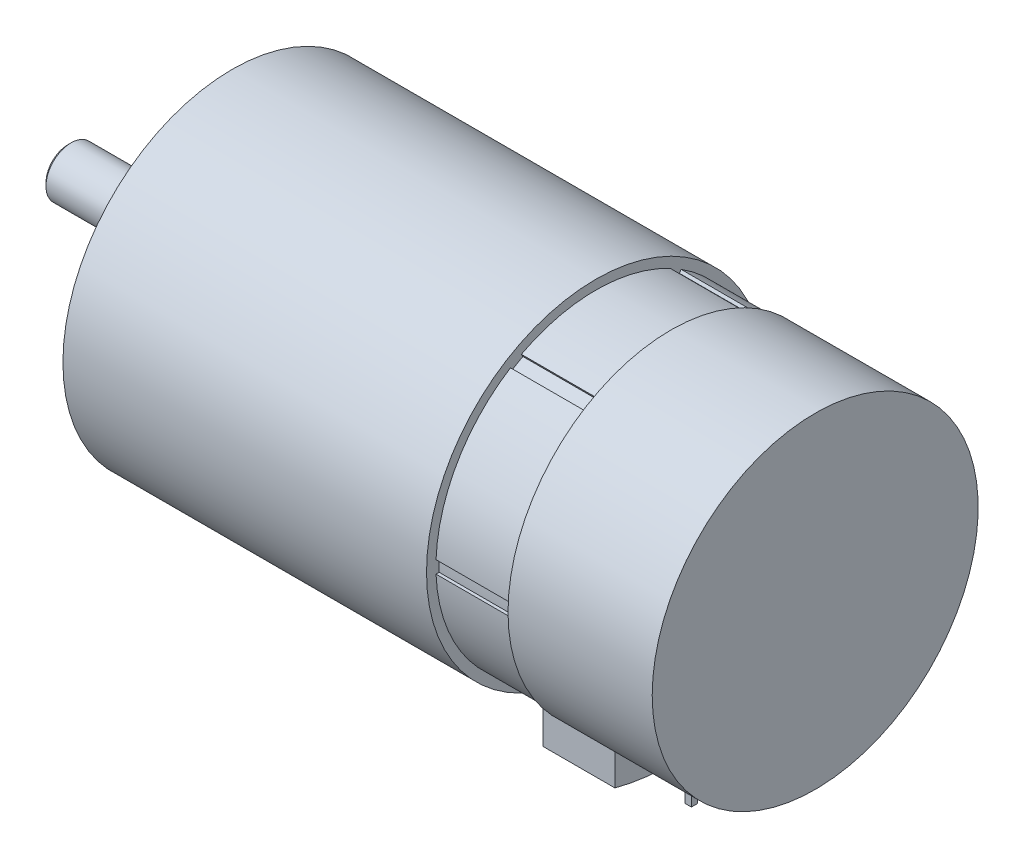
ISO-10303-21;
HEADER;
FILE_DESCRIPTION(('STEP AP214'),'2;1');
FILE_NAME('part.step','',(''),(''),'','','');
FILE_SCHEMA(('AUTOMOTIVE_DESIGN { 1 0 10303 214 1 1 1 1 }'));
ENDSEC;
DATA;
#1=APPLICATION_CONTEXT('core data for automotive mechanical design processes');
#2=APPLICATION_PROTOCOL_DEFINITION('international standard','automotive_design',2000,#1);
#3=PRODUCT_CONTEXT('',#1,'mechanical');
#4=PRODUCT('Part','Part','',(#3));
#5=PRODUCT_RELATED_PRODUCT_CATEGORY('part','',(#4));
#6=PRODUCT_DEFINITION_FORMATION('','',#4);
#7=PRODUCT_DEFINITION_CONTEXT('part definition',#1,'design');
#8=PRODUCT_DEFINITION('design','',#6,#7);
#9=PRODUCT_DEFINITION_SHAPE('','',#8);
#10=(LENGTH_UNIT() NAMED_UNIT(*) SI_UNIT(.MILLI.,.METRE.));
#11=(NAMED_UNIT(*) PLANE_ANGLE_UNIT() SI_UNIT($,.RADIAN.));
#12=(NAMED_UNIT(*) SI_UNIT($,.STERADIAN.) SOLID_ANGLE_UNIT());
#13=UNCERTAINTY_MEASURE_WITH_UNIT(LENGTH_MEASURE(1.E-05),#10,'distance_accuracy_value','');
#14=(GEOMETRIC_REPRESENTATION_CONTEXT(3) GLOBAL_UNCERTAINTY_ASSIGNED_CONTEXT((#13)) GLOBAL_UNIT_ASSIGNED_CONTEXT((#10,
#11,#12)) REPRESENTATION_CONTEXT('',''));
#15=CARTESIAN_POINT('',(0.,0.,0.));
#16=DIRECTION('',(0.,0.,1.));
#17=DIRECTION('',(1.,0.,0.));
#18=AXIS2_PLACEMENT_3D('',#15,#16,#17);
#19=CARTESIAN_POINT('',(89.3034632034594,-35.298221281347,1.));
#20=DIRECTION('',(-1.,0.,0.));
#21=DIRECTION('',(0.,0.,1.));
#22=AXIS2_PLACEMENT_3D('',#19,#20,#21);
#23=PLANE('',#22);
#24=DIRECTION('',(0.,0.,-1.));
#25=VECTOR('',#24,1.);
#26=CARTESIAN_POINT('',(89.3034632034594,-34.0606778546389,1.));
#27=LINE('',#26,#25);
#28=CARTESIAN_POINT('',(89.3034632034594,-34.0606778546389,-1.));
#29=VERTEX_POINT('',#28);
#30=CARTESIAN_POINT('',(89.3034632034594,-34.0606778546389,1.));
#31=VERTEX_POINT('',#30);
#32=EDGE_CURVE('E777',#29,#31,#27,.F.);
#33=ORIENTED_EDGE('',*,*,#32,.F.);
#34=DIRECTION('',(0.,1.,0.));
#35=VECTOR('',#34,1.);
#36=CARTESIAN_POINT('',(89.3034632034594,-35.298221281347,-1.));
#37=LINE('',#36,#35);
#38=CARTESIAN_POINT('',(89.3034632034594,-25.4803846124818,-1.00000000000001));
#39=VERTEX_POINT('',#38);
#40=EDGE_CURVE('E964',#29,#39,#37,.T.);
#41=ORIENTED_EDGE('',*,*,#40,.T.);
#42=CARTESIAN_POINT('',(89.3034632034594,0.,0.));
#43=DIRECTION('',(1.,0.,0.));
#44=DIRECTION('',(0.,0.,-1.));
#45=AXIS2_PLACEMENT_3D('',#42,#43,#44);
#46=CIRCLE('',#45,25.5);
#47=CARTESIAN_POINT('',(89.3034632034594,-25.4803846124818,0.99999999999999));
#48=VERTEX_POINT('',#47);
#49=EDGE_CURVE('E956',#48,#39,#46,.T.);
#50=ORIENTED_EDGE('',*,*,#49,.F.);
#51=DIRECTION('',(0.,1.,0.));
#52=VECTOR('',#51,1.);
#53=CARTESIAN_POINT('',(89.3034632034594,-35.298221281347,1.));
#54=LINE('',#53,#52);
#55=EDGE_CURVE('E973',#31,#48,#54,.T.);
#56=ORIENTED_EDGE('',*,*,#55,.F.);
#57=EDGE_LOOP('',(#33,#41,#50,#56));
#58=FACE_BOUND('',#57,.T.);
#59=ADVANCED_FACE('F44',(#58),#23,.F.);
#60=CARTESIAN_POINT('',(87.3034632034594,-35.298221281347,1.));
#61=DIRECTION('',(0.,0.,-1.));
#62=DIRECTION('',(-1.,0.,0.));
#63=AXIS2_PLACEMENT_3D('',#60,#61,#62);
#64=PLANE('',#63);
#65=DIRECTION('',(1.,0.,0.));
#66=VECTOR('',#65,1.);
#67=CARTESIAN_POINT('',(87.3034632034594,-34.0606778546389,1.));
#68=LINE('',#67,#66);
#69=CARTESIAN_POINT('',(87.3034632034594,-34.0606778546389,1.00000000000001));
#70=VERTEX_POINT('',#69);
#71=EDGE_CURVE('E769',#31,#70,#68,.F.);
#72=ORIENTED_EDGE('',*,*,#71,.F.);
#73=ORIENTED_EDGE('',*,*,#55,.T.);
#74=DIRECTION('',(-1.,0.,0.));
#75=VECTOR('',#74,1.);
#76=CARTESIAN_POINT('',(0.,-25.4803846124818,1.));
#77=LINE('',#76,#75);
#78=CARTESIAN_POINT('',(87.3034632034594,-25.4803846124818,1.));
#79=VERTEX_POINT('',#78);
#80=EDGE_CURVE('E960',#79,#48,#77,.F.);
#81=ORIENTED_EDGE('',*,*,#80,.F.);
#82=DIRECTION('',(0.,1.,0.));
#83=VECTOR('',#82,1.);
#84=CARTESIAN_POINT('',(87.3034632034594,-35.298221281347,1.));
#85=LINE('',#84,#83);
#86=EDGE_CURVE('E970',#70,#79,#85,.T.);
#87=ORIENTED_EDGE('',*,*,#86,.F.);
#88=EDGE_LOOP('',(#72,#73,#81,#87));
#89=FACE_BOUND('',#88,.T.);
#90=ADVANCED_FACE('F1617',(#89),#64,.F.);
#91=CARTESIAN_POINT('',(87.3034632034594,-35.298221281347,1.));
#92=DIRECTION('',(1.,0.,0.));
#93=DIRECTION('',(0.,0.,-1.));
#94=AXIS2_PLACEMENT_3D('',#91,#92,#93);
#95=PLANE('',#94);
#96=DIRECTION('',(0.,0.,1.));
#97=VECTOR('',#96,1.);
#98=CARTESIAN_POINT('',(87.3034632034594,-34.0606778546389,1.));
#99=LINE('',#98,#97);
#100=CARTESIAN_POINT('',(87.3034632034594,-34.0606778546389,-1.));
#101=VERTEX_POINT('',#100);
#102=EDGE_CURVE('E607',#70,#101,#99,.F.);
#103=ORIENTED_EDGE('',*,*,#102,.F.);
#104=ORIENTED_EDGE('',*,*,#86,.T.);
#105=CARTESIAN_POINT('',(87.3034632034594,0.,0.));
#106=DIRECTION('',(-1.,0.,0.));
#107=DIRECTION('',(0.,0.,1.));
#108=AXIS2_PLACEMENT_3D('',#105,#106,#107);
#109=CIRCLE('',#108,25.5);
#110=CARTESIAN_POINT('',(87.3034632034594,-25.4803846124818,-1.00000000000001));
#111=VERTEX_POINT('',#110);
#112=EDGE_CURVE('E948',#111,#79,#109,.T.);
#113=ORIENTED_EDGE('',*,*,#112,.F.);
#114=DIRECTION('',(0.,1.,0.));
#115=VECTOR('',#114,1.);
#116=CARTESIAN_POINT('',(87.3034632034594,-35.298221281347,-1.));
#117=LINE('',#116,#115);
#118=EDGE_CURVE('E967',#101,#111,#117,.T.);
#119=ORIENTED_EDGE('',*,*,#118,.F.);
#120=EDGE_LOOP('',(#103,#104,#113,#119));
#121=FACE_BOUND('',#120,.T.);
#122=ADVANCED_FACE('F1623',(#121),#95,.F.);
#123=CARTESIAN_POINT('',(87.3034632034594,-35.298221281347,-1.));
#124=DIRECTION('',(0.,0.,1.));
#125=DIRECTION('',(1.,0.,0.));
#126=AXIS2_PLACEMENT_3D('',#123,#124,#125);
#127=PLANE('',#126);
#128=DIRECTION('',(-1.,0.,0.));
#129=VECTOR('',#128,1.);
#130=CARTESIAN_POINT('',(87.3034632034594,-34.0606778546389,-1.));
#131=LINE('',#130,#129);
#132=EDGE_CURVE('E774',#101,#29,#131,.F.);
#133=ORIENTED_EDGE('',*,*,#132,.F.);
#134=ORIENTED_EDGE('',*,*,#118,.T.);
#135=DIRECTION('',(-1.,0.,0.));
#136=VECTOR('',#135,1.);
#137=CARTESIAN_POINT('',(0.,-25.4803846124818,-1.));
#138=LINE('',#137,#136);
#139=EDGE_CURVE('E952',#39,#111,#138,.T.);
#140=ORIENTED_EDGE('',*,*,#139,.F.);
#141=ORIENTED_EDGE('',*,*,#40,.F.);
#142=EDGE_LOOP('',(#133,#134,#140,#141));
#143=FACE_BOUND('',#142,.T.);
#144=ADVANCED_FACE('F1834',(#143),#127,.F.);
#145=CARTESIAN_POINT('',(89.3034632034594,-35.298221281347,5.5));
#146=DIRECTION('',(-1.,0.,0.));
#147=DIRECTION('',(0.,0.,1.));
#148=AXIS2_PLACEMENT_3D('',#145,#146,#147);
#149=PLANE('',#148);
#150=DIRECTION('',(0.,0.,-1.));
#151=VECTOR('',#150,1.);
#152=CARTESIAN_POINT('',(89.3034632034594,-34.0606778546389,5.5));
#153=LINE('',#152,#151);
#154=CARTESIAN_POINT('',(89.3034632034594,-34.0606778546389,3.5));
#155=VERTEX_POINT('',#154);
#156=CARTESIAN_POINT('',(89.3034632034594,-34.0606778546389,5.5));
#157=VERTEX_POINT('',#156);
#158=EDGE_CURVE('E766',#155,#157,#153,.F.);
#159=ORIENTED_EDGE('',*,*,#158,.F.);
#160=DIRECTION('',(0.,1.,0.));
#161=VECTOR('',#160,1.);
#162=CARTESIAN_POINT('',(89.3034632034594,-35.298221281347,3.5));
#163=LINE('',#162,#161);
#164=CARTESIAN_POINT('',(89.3034632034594,-25.2586618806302,3.49999999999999));
#165=VERTEX_POINT('',#164);
#166=EDGE_CURVE('E936',#155,#165,#163,.T.);
#167=ORIENTED_EDGE('',*,*,#166,.T.);
#168=CARTESIAN_POINT('',(89.3034632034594,0.,0.));
#169=DIRECTION('',(1.,0.,0.));
#170=DIRECTION('',(0.,0.,-1.));
#171=AXIS2_PLACEMENT_3D('',#168,#169,#170);
#172=CIRCLE('',#171,25.5);
#173=CARTESIAN_POINT('',(89.3034632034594,-24.8997991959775,5.49999999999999));
#174=VERTEX_POINT('',#173);
#175=EDGE_CURVE('E928',#174,#165,#172,.T.);
#176=ORIENTED_EDGE('',*,*,#175,.F.);
#177=DIRECTION('',(0.,1.,0.));
#178=VECTOR('',#177,1.);
#179=CARTESIAN_POINT('',(89.3034632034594,-35.298221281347,5.5));
#180=LINE('',#179,#178);
#181=EDGE_CURVE('E945',#157,#174,#180,.T.);
#182=ORIENTED_EDGE('',*,*,#181,.F.);
#183=EDGE_LOOP('',(#159,#167,#176,#182));
#184=FACE_BOUND('',#183,.T.);
#185=ADVANCED_FACE('F1830',(#184),#149,.F.);
#186=CARTESIAN_POINT('',(87.3034632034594,-35.298221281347,5.5));
#187=DIRECTION('',(0.,0.,-1.));
#188=DIRECTION('',(-1.,0.,0.));
#189=AXIS2_PLACEMENT_3D('',#186,#187,#188);
#190=PLANE('',#189);
#191=DIRECTION('',(1.,0.,0.));
#192=VECTOR('',#191,1.);
#193=CARTESIAN_POINT('',(87.3034632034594,-34.0606778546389,5.5));
#194=LINE('',#193,#192);
#195=CARTESIAN_POINT('',(87.3034632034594,-34.0606778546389,5.5));
#196=VERTEX_POINT('',#195);
#197=EDGE_CURVE('E756',#157,#196,#194,.F.);
#198=ORIENTED_EDGE('',*,*,#197,.F.);
#199=ORIENTED_EDGE('',*,*,#181,.T.);
#200=DIRECTION('',(-1.,0.,0.));
#201=VECTOR('',#200,1.);
#202=CARTESIAN_POINT('',(0.,-24.8997991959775,5.5));
#203=LINE('',#202,#201);
#204=CARTESIAN_POINT('',(87.3034632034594,-24.8997991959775,5.5));
#205=VERTEX_POINT('',#204);
#206=EDGE_CURVE('E932',#205,#174,#203,.F.);
#207=ORIENTED_EDGE('',*,*,#206,.F.);
#208=DIRECTION('',(0.,1.,0.));
#209=VECTOR('',#208,1.);
#210=CARTESIAN_POINT('',(87.3034632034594,-35.298221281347,5.5));
#211=LINE('',#210,#209);
#212=EDGE_CURVE('E942',#196,#205,#211,.T.);
#213=ORIENTED_EDGE('',*,*,#212,.F.);
#214=EDGE_LOOP('',(#198,#199,#207,#213));
#215=FACE_BOUND('',#214,.T.);
#216=ADVANCED_FACE('F1826',(#215),#190,.F.);
#217=CARTESIAN_POINT('',(87.3034632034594,-35.298221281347,5.5));
#218=DIRECTION('',(1.,0.,0.));
#219=DIRECTION('',(0.,0.,-1.));
#220=AXIS2_PLACEMENT_3D('',#217,#218,#219);
#221=PLANE('',#220);
#222=DIRECTION('',(0.,0.,1.));
#223=VECTOR('',#222,1.);
#224=CARTESIAN_POINT('',(87.3034632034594,-34.0606778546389,5.5));
#225=LINE('',#224,#223);
#226=CARTESIAN_POINT('',(87.3034632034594,-34.0606778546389,3.5));
#227=VERTEX_POINT('',#226);
#228=EDGE_CURVE('E759',#196,#227,#225,.F.);
#229=ORIENTED_EDGE('',*,*,#228,.F.);
#230=ORIENTED_EDGE('',*,*,#212,.T.);
#231=CARTESIAN_POINT('',(87.3034632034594,0.,0.));
#232=DIRECTION('',(-1.,0.,0.));
#233=DIRECTION('',(0.,0.,1.));
#234=AXIS2_PLACEMENT_3D('',#231,#232,#233);
#235=CIRCLE('',#234,25.5);
#236=CARTESIAN_POINT('',(87.3034632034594,-25.2586618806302,3.49999999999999));
#237=VERTEX_POINT('',#236);
#238=EDGE_CURVE('E920',#237,#205,#235,.T.);
#239=ORIENTED_EDGE('',*,*,#238,.F.);
#240=DIRECTION('',(0.,1.,0.));
#241=VECTOR('',#240,1.);
#242=CARTESIAN_POINT('',(87.3034632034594,-35.298221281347,3.5));
#243=LINE('',#242,#241);
#244=EDGE_CURVE('E939',#227,#237,#243,.T.);
#245=ORIENTED_EDGE('',*,*,#244,.F.);
#246=EDGE_LOOP('',(#229,#230,#239,#245));
#247=FACE_BOUND('',#246,.T.);
#248=ADVANCED_FACE('F1822',(#247),#221,.F.);
#249=CARTESIAN_POINT('',(87.3034632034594,-35.298221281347,3.5));
#250=DIRECTION('',(0.,0.,1.));
#251=DIRECTION('',(1.,0.,0.));
#252=AXIS2_PLACEMENT_3D('',#249,#250,#251);
#253=PLANE('',#252);
#254=DIRECTION('',(-1.,0.,0.));
#255=VECTOR('',#254,1.);
#256=CARTESIAN_POINT('',(87.3034632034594,-34.0606778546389,3.5));
#257=LINE('',#256,#255);
#258=EDGE_CURVE('E763',#227,#155,#257,.F.);
#259=ORIENTED_EDGE('',*,*,#258,.F.);
#260=ORIENTED_EDGE('',*,*,#244,.T.);
#261=DIRECTION('',(-1.,0.,0.));
#262=VECTOR('',#261,1.);
#263=CARTESIAN_POINT('',(0.,-25.2586618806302,3.5));
#264=LINE('',#263,#262);
#265=EDGE_CURVE('E924',#165,#237,#264,.T.);
#266=ORIENTED_EDGE('',*,*,#265,.F.);
#267=ORIENTED_EDGE('',*,*,#166,.F.);
#268=EDGE_LOOP('',(#259,#260,#266,#267));
#269=FACE_BOUND('',#268,.T.);
#270=ADVANCED_FACE('F1815',(#269),#253,.F.);
#271=CARTESIAN_POINT('',(87.3034632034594,-35.298221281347,-5.5));
#272=DIRECTION('',(1.,0.,0.));
#273=DIRECTION('',(0.,0.,-1.));
#274=AXIS2_PLACEMENT_3D('',#271,#272,#273);
#275=PLANE('',#274);
#276=DIRECTION('',(0.,0.,1.));
#277=VECTOR('',#276,1.);
#278=CARTESIAN_POINT('',(87.3034632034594,-34.0606778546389,-5.5));
#279=LINE('',#278,#277);
#280=CARTESIAN_POINT('',(87.3034632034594,-34.0606778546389,-3.5));
#281=VERTEX_POINT('',#280);
#282=CARTESIAN_POINT('',(87.3034632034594,-34.0606778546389,-5.5));
#283=VERTEX_POINT('',#282);
#284=EDGE_CURVE('E753',#281,#283,#279,.F.);
#285=ORIENTED_EDGE('',*,*,#284,.F.);
#286=DIRECTION('',(0.,1.,0.));
#287=VECTOR('',#286,1.);
#288=CARTESIAN_POINT('',(87.3034632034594,-35.298221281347,-3.5));
#289=LINE('',#288,#287);
#290=CARTESIAN_POINT('',(87.3034632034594,-25.2586618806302,-3.50000000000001));
#291=VERTEX_POINT('',#290);
#292=EDGE_CURVE('E908',#281,#291,#289,.T.);
#293=ORIENTED_EDGE('',*,*,#292,.T.);
#294=CARTESIAN_POINT('',(87.3034632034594,0.,0.));
#295=DIRECTION('',(-1.,0.,0.));
#296=DIRECTION('',(0.,0.,1.));
#297=AXIS2_PLACEMENT_3D('',#294,#295,#296);
#298=CIRCLE('',#297,25.5);
#299=CARTESIAN_POINT('',(87.3034632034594,-24.8997991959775,-5.50000000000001));
#300=VERTEX_POINT('',#299);
#301=EDGE_CURVE('E900',#300,#291,#298,.T.);
#302=ORIENTED_EDGE('',*,*,#301,.F.);
#303=DIRECTION('',(0.,1.,0.));
#304=VECTOR('',#303,1.);
#305=CARTESIAN_POINT('',(87.3034632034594,-35.298221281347,-5.5));
#306=LINE('',#305,#304);
#307=EDGE_CURVE('E917',#283,#300,#306,.T.);
#308=ORIENTED_EDGE('',*,*,#307,.F.);
#309=EDGE_LOOP('',(#285,#293,#302,#308));
#310=FACE_BOUND('',#309,.T.);
#311=ADVANCED_FACE('F1811',(#310),#275,.F.);
#312=CARTESIAN_POINT('',(87.3034632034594,-35.298221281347,-5.5));
#313=DIRECTION('',(0.,0.,1.));
#314=DIRECTION('',(1.,0.,0.));
#315=AXIS2_PLACEMENT_3D('',#312,#313,#314);
#316=PLANE('',#315);
#317=DIRECTION('',(-1.,0.,0.));
#318=VECTOR('',#317,1.);
#319=CARTESIAN_POINT('',(87.3034632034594,-34.0606778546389,-5.5));
#320=LINE('',#319,#318);
#321=CARTESIAN_POINT('',(89.3034632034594,-34.0606778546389,-5.50000000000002));
#322=VERTEX_POINT('',#321);
#323=EDGE_CURVE('E743',#283,#322,#320,.F.);
#324=ORIENTED_EDGE('',*,*,#323,.F.);
#325=ORIENTED_EDGE('',*,*,#307,.T.);
#326=DIRECTION('',(-1.,0.,0.));
#327=VECTOR('',#326,1.);
#328=CARTESIAN_POINT('',(0.,-24.8997991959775,-5.5));
#329=LINE('',#328,#327);
#330=CARTESIAN_POINT('',(89.3034632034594,-24.8997991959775,-5.5));
#331=VERTEX_POINT('',#330);
#332=EDGE_CURVE('E904',#331,#300,#329,.T.);
#333=ORIENTED_EDGE('',*,*,#332,.F.);
#334=DIRECTION('',(0.,1.,0.));
#335=VECTOR('',#334,1.);
#336=CARTESIAN_POINT('',(89.3034632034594,-35.298221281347,-5.5));
#337=LINE('',#336,#335);
#338=EDGE_CURVE('E914',#322,#331,#337,.T.);
#339=ORIENTED_EDGE('',*,*,#338,.F.);
#340=EDGE_LOOP('',(#324,#325,#333,#339));
#341=FACE_BOUND('',#340,.T.);
#342=ADVANCED_FACE('F1807',(#341),#316,.F.);
#343=CARTESIAN_POINT('',(89.3034632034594,-35.298221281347,-5.5));
#344=DIRECTION('',(-1.,0.,0.));
#345=DIRECTION('',(0.,0.,1.));
#346=AXIS2_PLACEMENT_3D('',#343,#344,#345);
#347=PLANE('',#346);
#348=DIRECTION('',(0.,0.,-1.));
#349=VECTOR('',#348,1.);
#350=CARTESIAN_POINT('',(89.3034632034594,-34.0606778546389,-5.5));
#351=LINE('',#350,#349);
#352=CARTESIAN_POINT('',(89.3034632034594,-34.0606778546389,-3.5));
#353=VERTEX_POINT('',#352);
#354=EDGE_CURVE('E746',#322,#353,#351,.F.);
#355=ORIENTED_EDGE('',*,*,#354,.F.);
#356=ORIENTED_EDGE('',*,*,#338,.T.);
#357=CARTESIAN_POINT('',(89.3034632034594,0.,0.));
#358=DIRECTION('',(1.,0.,0.));
#359=DIRECTION('',(0.,0.,-1.));
#360=AXIS2_PLACEMENT_3D('',#357,#358,#359);
#361=CIRCLE('',#360,25.5);
#362=CARTESIAN_POINT('',(89.3034632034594,-25.2586618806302,-3.50000000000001));
#363=VERTEX_POINT('',#362);
#364=EDGE_CURVE('E892',#363,#331,#361,.T.);
#365=ORIENTED_EDGE('',*,*,#364,.F.);
#366=DIRECTION('',(0.,1.,0.));
#367=VECTOR('',#366,1.);
#368=CARTESIAN_POINT('',(89.3034632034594,-35.298221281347,-3.5));
#369=LINE('',#368,#367);
#370=EDGE_CURVE('E911',#353,#363,#369,.T.);
#371=ORIENTED_EDGE('',*,*,#370,.F.);
#372=EDGE_LOOP('',(#355,#356,#365,#371));
#373=FACE_BOUND('',#372,.T.);
#374=ADVANCED_FACE('F1803',(#373),#347,.F.);
#375=CARTESIAN_POINT('',(87.3034632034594,-35.298221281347,-3.5));
#376=DIRECTION('',(0.,0.,-1.));
#377=DIRECTION('',(-1.,0.,0.));
#378=AXIS2_PLACEMENT_3D('',#375,#376,#377);
#379=PLANE('',#378);
#380=DIRECTION('',(1.,0.,0.));
#381=VECTOR('',#380,1.);
#382=CARTESIAN_POINT('',(87.3034632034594,-34.0606778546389,-3.5));
#383=LINE('',#382,#381);
#384=EDGE_CURVE('E750',#353,#281,#383,.F.);
#385=ORIENTED_EDGE('',*,*,#384,.F.);
#386=ORIENTED_EDGE('',*,*,#370,.T.);
#387=DIRECTION('',(-1.,0.,0.));
#388=VECTOR('',#387,1.);
#389=CARTESIAN_POINT('',(0.,-25.2586618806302,-3.5));
#390=LINE('',#389,#388);
#391=EDGE_CURVE('E896',#291,#363,#390,.F.);
#392=ORIENTED_EDGE('',*,*,#391,.F.);
#393=ORIENTED_EDGE('',*,*,#292,.F.);
#394=EDGE_LOOP('',(#385,#386,#392,#393));
#395=FACE_BOUND('',#394,.T.);
#396=ADVANCED_FACE('F1794',(#395),#379,.F.);
#397=CARTESIAN_POINT('',(103.7,-35.298221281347,1.75000000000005));
#398=DIRECTION('',(-1.,0.,0.));
#399=DIRECTION('',(0.,0.,1.));
#400=AXIS2_PLACEMENT_3D('',#397,#398,#399);
#401=PLANE('',#400);
#402=DIRECTION('',(0.,0.,1.));
#403=VECTOR('',#402,1.);
#404=CARTESIAN_POINT('',(103.7,-34.048221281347,1.75000000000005));
#405=LINE('',#404,#403);
#406=CARTESIAN_POINT('',(103.7,-34.048221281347,0.75000000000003));
#407=VERTEX_POINT('',#406);
#408=CARTESIAN_POINT('',(103.7,-34.048221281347,1.75000000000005));
#409=VERTEX_POINT('',#408);
#410=EDGE_CURVE('E740',#407,#409,#405,.T.);
#411=ORIENTED_EDGE('',*,*,#410,.F.);
#412=DIRECTION('',(0.,1.,0.));
#413=VECTOR('',#412,1.);
#414=CARTESIAN_POINT('',(103.7,-35.298221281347,0.75000000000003));
#415=LINE('',#414,#413);
#416=CARTESIAN_POINT('',(103.7,-25.4889682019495,0.750000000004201));
#417=VERTEX_POINT('',#416);
#418=EDGE_CURVE('E880',#407,#417,#415,.T.);
#419=ORIENTED_EDGE('',*,*,#418,.T.);
#420=CARTESIAN_POINT('',(103.7,0.,0.));
#421=DIRECTION('',(1.,0.,0.));
#422=DIRECTION('',(0.,0.,-1.));
#423=AXIS2_PLACEMENT_3D('',#420,#421,#422);
#424=CIRCLE('',#423,25.5);
#425=CARTESIAN_POINT('',(103.7,-25.4398801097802,1.75000000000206));
#426=VERTEX_POINT('',#425);
#427=EDGE_CURVE('E872',#426,#417,#424,.T.);
#428=ORIENTED_EDGE('',*,*,#427,.F.);
#429=DIRECTION('',(0.,1.,0.));
#430=VECTOR('',#429,1.);
#431=CARTESIAN_POINT('',(103.7,-35.298221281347,1.75000000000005));
#432=LINE('',#431,#430);
#433=EDGE_CURVE('E889',#409,#426,#432,.T.);
#434=ORIENTED_EDGE('',*,*,#433,.F.);
#435=EDGE_LOOP('',(#411,#419,#428,#434));
#436=FACE_BOUND('',#435,.T.);
#437=ADVANCED_FACE('F1773',(#436),#401,.F.);
#438=CARTESIAN_POINT('',(102.7,-35.298221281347,1.75000000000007));
#439=DIRECTION('',(0.,0.,-1.));
#440=DIRECTION('',(-1.,0.,0.));
#441=AXIS2_PLACEMENT_3D('',#438,#439,#440);
#442=PLANE('',#441);
#443=DIRECTION('',(-1.,0.,0.));
#444=VECTOR('',#443,1.);
#445=CARTESIAN_POINT('',(102.7,-34.048221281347,1.75000000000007));
#446=LINE('',#445,#444);
#447=CARTESIAN_POINT('',(102.7,-34.048221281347,1.75000000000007));
#448=VERTEX_POINT('',#447);
#449=EDGE_CURVE('E737',#409,#448,#446,.T.);
#450=ORIENTED_EDGE('',*,*,#449,.F.);
#451=ORIENTED_EDGE('',*,*,#433,.T.);
#452=DIRECTION('',(-1.,0.,0.));
#453=VECTOR('',#452,1.);
#454=CARTESIAN_POINT('',(0.,-25.4398801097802,1.75000000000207));
#455=LINE('',#454,#453);
#456=CARTESIAN_POINT('',(102.7,-25.4398801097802,1.75000000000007));
#457=VERTEX_POINT('',#456);
#458=EDGE_CURVE('E876',#457,#426,#455,.F.);
#459=ORIENTED_EDGE('',*,*,#458,.F.);
#460=DIRECTION('',(0.,1.,0.));
#461=VECTOR('',#460,1.);
#462=CARTESIAN_POINT('',(102.7,-35.298221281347,1.75000000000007));
#463=LINE('',#462,#461);
#464=EDGE_CURVE('E886',#448,#457,#463,.T.);
#465=ORIENTED_EDGE('',*,*,#464,.F.);
#466=EDGE_LOOP('',(#450,#451,#459,#465));
#467=FACE_BOUND('',#466,.T.);
#468=ADVANCED_FACE('F1771',(#467),#442,.F.);
#469=CARTESIAN_POINT('',(102.7,-35.298221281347,1.75000000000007));
#470=DIRECTION('',(1.,0.,0.));
#471=DIRECTION('',(0.,0.,-1.));
#472=AXIS2_PLACEMENT_3D('',#469,#470,#471);
#473=PLANE('',#472);
#474=DIRECTION('',(0.,0.,-1.));
#475=VECTOR('',#474,1.);
#476=CARTESIAN_POINT('',(102.7,-34.048221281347,1.75000000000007));
#477=LINE('',#476,#475);
#478=CARTESIAN_POINT('',(102.7,-34.048221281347,0.75000000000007));
#479=VERTEX_POINT('',#478);
#480=EDGE_CURVE('E734',#448,#479,#477,.T.);
#481=ORIENTED_EDGE('',*,*,#480,.F.);
#482=ORIENTED_EDGE('',*,*,#464,.T.);
#483=CARTESIAN_POINT('',(102.7,0.,0.));
#484=DIRECTION('',(-1.,0.,0.));
#485=DIRECTION('',(0.,0.,1.));
#486=AXIS2_PLACEMENT_3D('',#483,#484,#485);
#487=CIRCLE('',#486,25.5);
#488=CARTESIAN_POINT('',(102.7,-25.4889682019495,0.750000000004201));
#489=VERTEX_POINT('',#488);
#490=EDGE_CURVE('E864',#489,#457,#487,.T.);
#491=ORIENTED_EDGE('',*,*,#490,.F.);
#492=DIRECTION('',(0.,1.,0.));
#493=VECTOR('',#492,1.);
#494=CARTESIAN_POINT('',(102.7,-35.298221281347,0.75000000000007));
#495=LINE('',#494,#493);
#496=EDGE_CURVE('E883',#479,#489,#495,.T.);
#497=ORIENTED_EDGE('',*,*,#496,.F.);
#498=EDGE_LOOP('',(#481,#482,#491,#497));
#499=FACE_BOUND('',#498,.T.);
#500=ADVANCED_FACE('F1780',(#499),#473,.F.);
#501=CARTESIAN_POINT('',(102.7,-35.298221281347,0.75000000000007));
#502=DIRECTION('',(0.,0.,1.));
#503=DIRECTION('',(1.,0.,0.));
#504=AXIS2_PLACEMENT_3D('',#501,#502,#503);
#505=PLANE('',#504);
#506=DIRECTION('',(1.,0.,0.));
#507=VECTOR('',#506,1.);
#508=CARTESIAN_POINT('',(102.7,-34.048221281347,0.75000000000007));
#509=LINE('',#508,#507);
#510=EDGE_CURVE('E731',#479,#407,#509,.T.);
#511=ORIENTED_EDGE('',*,*,#510,.F.);
#512=ORIENTED_EDGE('',*,*,#496,.T.);
#513=DIRECTION('',(-1.,0.,0.));
#514=VECTOR('',#513,1.);
#515=CARTESIAN_POINT('',(0.,-25.4889682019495,0.750000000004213));
#516=LINE('',#515,#514);
#517=EDGE_CURVE('E868',#417,#489,#516,.T.);
#518=ORIENTED_EDGE('',*,*,#517,.F.);
#519=ORIENTED_EDGE('',*,*,#418,.F.);
#520=EDGE_LOOP('',(#511,#512,#518,#519));
#521=FACE_BOUND('',#520,.T.);
#522=ADVANCED_FACE('F1777',(#521),#505,.F.);
#523=CARTESIAN_POINT('',(103.7,-35.298221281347,4.25000000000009));
#524=DIRECTION('',(-1.,0.,0.));
#525=DIRECTION('',(0.,0.,1.));
#526=AXIS2_PLACEMENT_3D('',#523,#524,#525);
#527=PLANE('',#526);
#528=DIRECTION('',(0.,0.,1.));
#529=VECTOR('',#528,1.);
#530=CARTESIAN_POINT('',(103.7,-34.048221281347,4.25000000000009));
#531=LINE('',#530,#529);
#532=CARTESIAN_POINT('',(103.7,-34.048221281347,3.25000000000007));
#533=VERTEX_POINT('',#532);
#534=CARTESIAN_POINT('',(103.7,-34.048221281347,4.25000000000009));
#535=VERTEX_POINT('',#534);
#536=EDGE_CURVE('E728',#533,#535,#531,.T.);
#537=ORIENTED_EDGE('',*,*,#536,.F.);
#538=DIRECTION('',(0.,1.,0.));
#539=VECTOR('',#538,1.);
#540=CARTESIAN_POINT('',(103.7,-35.298221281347,3.25000000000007));
#541=LINE('',#540,#539);
#542=CARTESIAN_POINT('',(103.7,-25.2920442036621,3.25000000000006));
#543=VERTEX_POINT('',#542);
#544=EDGE_CURVE('E852',#533,#543,#541,.T.);
#545=ORIENTED_EDGE('',*,*,#544,.T.);
#546=CARTESIAN_POINT('',(103.7,0.,0.));
#547=DIRECTION('',(1.,0.,0.));
#548=DIRECTION('',(0.,0.,-1.));
#549=AXIS2_PLACEMENT_3D('',#546,#547,#548);
#550=CIRCLE('',#549,25.5);
#551=CARTESIAN_POINT('',(103.7,-25.1433390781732,4.25000000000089));
#552=VERTEX_POINT('',#551);
#553=EDGE_CURVE('E844',#552,#543,#550,.T.);
#554=ORIENTED_EDGE('',*,*,#553,.F.);
#555=DIRECTION('',(0.,1.,0.));
#556=VECTOR('',#555,1.);
#557=CARTESIAN_POINT('',(103.7,-35.298221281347,4.25000000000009));
#558=LINE('',#557,#556);
#559=EDGE_CURVE('E861',#535,#552,#558,.T.);
#560=ORIENTED_EDGE('',*,*,#559,.F.);
#561=EDGE_LOOP('',(#537,#545,#554,#560));
#562=FACE_BOUND('',#561,.T.);
#563=ADVANCED_FACE('F1787',(#562),#527,.F.);
#564=CARTESIAN_POINT('',(102.7,-35.298221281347,4.2500000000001));
#565=DIRECTION('',(0.,0.,-1.));
#566=DIRECTION('',(-1.,0.,0.));
#567=AXIS2_PLACEMENT_3D('',#564,#565,#566);
#568=PLANE('',#567);
#569=DIRECTION('',(-1.,0.,0.));
#570=VECTOR('',#569,1.);
#571=CARTESIAN_POINT('',(102.7,-34.048221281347,4.2500000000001));
#572=LINE('',#571,#570);
#573=CARTESIAN_POINT('',(102.7,-34.048221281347,4.2500000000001));
#574=VERTEX_POINT('',#573);
#575=EDGE_CURVE('E725',#535,#574,#572,.T.);
#576=ORIENTED_EDGE('',*,*,#575,.F.);
#577=ORIENTED_EDGE('',*,*,#559,.T.);
#578=DIRECTION('',(-1.,0.,0.));
#579=VECTOR('',#578,1.);
#580=CARTESIAN_POINT('',(0.,-25.1433390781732,4.2500000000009));
#581=LINE('',#580,#579);
#582=CARTESIAN_POINT('',(102.7,-25.1433390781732,4.2500000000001));
#583=VERTEX_POINT('',#582);
#584=EDGE_CURVE('E848',#583,#552,#581,.F.);
#585=ORIENTED_EDGE('',*,*,#584,.F.);
#586=DIRECTION('',(0.,1.,0.));
#587=VECTOR('',#586,1.);
#588=CARTESIAN_POINT('',(102.7,-35.298221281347,4.2500000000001));
#589=LINE('',#588,#587);
#590=EDGE_CURVE('E858',#574,#583,#589,.T.);
#591=ORIENTED_EDGE('',*,*,#590,.F.);
#592=EDGE_LOOP('',(#576,#577,#585,#591));
#593=FACE_BOUND('',#592,.T.);
#594=ADVANCED_FACE('F1924',(#593),#568,.F.);
#595=CARTESIAN_POINT('',(102.7,-35.298221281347,4.2500000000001));
#596=DIRECTION('',(1.,0.,0.));
#597=DIRECTION('',(0.,0.,-1.));
#598=AXIS2_PLACEMENT_3D('',#595,#596,#597);
#599=PLANE('',#598);
#600=DIRECTION('',(0.,0.,-1.));
#601=VECTOR('',#600,1.);
#602=CARTESIAN_POINT('',(102.7,-34.048221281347,4.2500000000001));
#603=LINE('',#602,#601);
#604=CARTESIAN_POINT('',(102.7,-34.048221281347,3.25000000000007));
#605=VERTEX_POINT('',#604);
#606=EDGE_CURVE('E722',#574,#605,#603,.T.);
#607=ORIENTED_EDGE('',*,*,#606,.F.);
#608=ORIENTED_EDGE('',*,*,#590,.T.);
#609=CARTESIAN_POINT('',(102.7,0.,0.));
#610=DIRECTION('',(-1.,0.,0.));
#611=DIRECTION('',(0.,0.,1.));
#612=AXIS2_PLACEMENT_3D('',#609,#610,#611);
#613=CIRCLE('',#612,25.5);
#614=CARTESIAN_POINT('',(102.7,-25.2920442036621,3.25000000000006));
#615=VERTEX_POINT('',#614);
#616=EDGE_CURVE('E836',#615,#583,#613,.T.);
#617=ORIENTED_EDGE('',*,*,#616,.F.);
#618=DIRECTION('',(0.,1.,0.));
#619=VECTOR('',#618,1.);
#620=CARTESIAN_POINT('',(102.7,-35.298221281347,3.25000000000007));
#621=LINE('',#620,#619);
#622=EDGE_CURVE('E855',#605,#615,#621,.T.);
#623=ORIENTED_EDGE('',*,*,#622,.F.);
#624=EDGE_LOOP('',(#607,#608,#617,#623));
#625=FACE_BOUND('',#624,.T.);
#626=ADVANCED_FACE('F1920',(#625),#599,.F.);
#627=CARTESIAN_POINT('',(102.7,-35.298221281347,3.25000000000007));
#628=DIRECTION('',(0.,0.,1.));
#629=DIRECTION('',(1.,0.,0.));
#630=AXIS2_PLACEMENT_3D('',#627,#628,#629);
#631=PLANE('',#630);
#632=DIRECTION('',(1.,0.,0.));
#633=VECTOR('',#632,1.);
#634=CARTESIAN_POINT('',(102.7,-34.048221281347,3.25000000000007));
#635=LINE('',#634,#633);
#636=EDGE_CURVE('E719',#605,#533,#635,.T.);
#637=ORIENTED_EDGE('',*,*,#636,.F.);
#638=ORIENTED_EDGE('',*,*,#622,.T.);
#639=DIRECTION('',(-1.,0.,0.));
#640=VECTOR('',#639,1.);
#641=CARTESIAN_POINT('',(0.,-25.2920442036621,3.25000000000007));
#642=LINE('',#641,#640);
#643=EDGE_CURVE('E840',#543,#615,#642,.T.);
#644=ORIENTED_EDGE('',*,*,#643,.F.);
#645=ORIENTED_EDGE('',*,*,#544,.F.);
#646=EDGE_LOOP('',(#637,#638,#644,#645));
#647=FACE_BOUND('',#646,.T.);
#648=ADVANCED_FACE('F1916',(#647),#631,.F.);
#649=CARTESIAN_POINT('',(102.7,-35.298221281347,-1.75000000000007));
#650=DIRECTION('',(1.,0.,0.));
#651=DIRECTION('',(0.,0.,-1.));
#652=AXIS2_PLACEMENT_3D('',#649,#650,#651);
#653=PLANE('',#652);
#654=DIRECTION('',(0.,0.,-1.));
#655=VECTOR('',#654,1.);
#656=CARTESIAN_POINT('',(102.7,-34.048221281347,-1.75000000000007));
#657=LINE('',#656,#655);
#658=CARTESIAN_POINT('',(102.7,-34.048221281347,-0.750000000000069));
#659=VERTEX_POINT('',#658);
#660=CARTESIAN_POINT('',(102.7,-34.048221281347,-1.75000000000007));
#661=VERTEX_POINT('',#660);
#662=EDGE_CURVE('E716',#659,#661,#657,.T.);
#663=ORIENTED_EDGE('',*,*,#662,.F.);
#664=DIRECTION('',(0.,1.,0.));
#665=VECTOR('',#664,1.);
#666=CARTESIAN_POINT('',(102.7,-35.298221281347,-0.750000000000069));
#667=LINE('',#666,#665);
#668=CARTESIAN_POINT('',(102.7,-25.4889682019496,-0.750000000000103));
#669=VERTEX_POINT('',#668);
#670=EDGE_CURVE('E824',#659,#669,#667,.T.);
#671=ORIENTED_EDGE('',*,*,#670,.T.);
#672=CARTESIAN_POINT('',(102.7,0.,0.));
#673=DIRECTION('',(-1.,0.,0.));
#674=DIRECTION('',(0.,0.,1.));
#675=AXIS2_PLACEMENT_3D('',#672,#673,#674);
#676=CIRCLE('',#675,25.5);
#677=CARTESIAN_POINT('',(102.7,-25.4398801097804,-1.7500000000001));
#678=VERTEX_POINT('',#677);
#679=EDGE_CURVE('E816',#678,#669,#676,.T.);
#680=ORIENTED_EDGE('',*,*,#679,.F.);
#681=DIRECTION('',(0.,1.,0.));
#682=VECTOR('',#681,1.);
#683=CARTESIAN_POINT('',(102.7,-35.298221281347,-1.75000000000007));
#684=LINE('',#683,#682);
#685=EDGE_CURVE('E833',#661,#678,#684,.T.);
#686=ORIENTED_EDGE('',*,*,#685,.F.);
#687=EDGE_LOOP('',(#663,#671,#680,#686));
#688=FACE_BOUND('',#687,.T.);
#689=ADVANCED_FACE('F1912',(#688),#653,.F.);
#690=CARTESIAN_POINT('',(102.7,-35.298221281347,-1.75000000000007));
#691=DIRECTION('',(0.,0.,1.));
#692=DIRECTION('',(1.,0.,0.));
#693=AXIS2_PLACEMENT_3D('',#690,#691,#692);
#694=PLANE('',#693);
#695=DIRECTION('',(1.,0.,0.));
#696=VECTOR('',#695,1.);
#697=CARTESIAN_POINT('',(102.7,-34.048221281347,-1.75000000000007));
#698=LINE('',#697,#696);
#699=CARTESIAN_POINT('',(103.7,-34.048221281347,-1.75000000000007));
#700=VERTEX_POINT('',#699);
#701=EDGE_CURVE('E713',#661,#700,#698,.T.);
#702=ORIENTED_EDGE('',*,*,#701,.F.);
#703=ORIENTED_EDGE('',*,*,#685,.T.);
#704=DIRECTION('',(-1.,0.,0.));
#705=VECTOR('',#704,1.);
#706=CARTESIAN_POINT('',(0.,-25.4398801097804,-1.75000000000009));
#707=LINE('',#706,#705);
#708=CARTESIAN_POINT('',(103.7,-25.4398801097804,-1.75000000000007));
#709=VERTEX_POINT('',#708);
#710=EDGE_CURVE('E820',#709,#678,#707,.T.);
#711=ORIENTED_EDGE('',*,*,#710,.F.);
#712=DIRECTION('',(0.,1.,0.));
#713=VECTOR('',#712,1.);
#714=CARTESIAN_POINT('',(103.7,-35.298221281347,-1.75000000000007));
#715=LINE('',#714,#713);
#716=EDGE_CURVE('E830',#700,#709,#715,.T.);
#717=ORIENTED_EDGE('',*,*,#716,.F.);
#718=EDGE_LOOP('',(#702,#703,#711,#717));
#719=FACE_BOUND('',#718,.T.);
#720=ADVANCED_FACE('F1908',(#719),#694,.F.);
#721=CARTESIAN_POINT('',(103.7,-35.298221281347,-1.75000000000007));
#722=DIRECTION('',(-1.,0.,0.));
#723=DIRECTION('',(0.,0.,1.));
#724=AXIS2_PLACEMENT_3D('',#721,#722,#723);
#725=PLANE('',#724);
#726=DIRECTION('',(0.,0.,1.));
#727=VECTOR('',#726,1.);
#728=CARTESIAN_POINT('',(103.7,-34.048221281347,-1.75000000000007));
#729=LINE('',#728,#727);
#730=CARTESIAN_POINT('',(103.7,-34.048221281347,-0.750000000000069));
#731=VERTEX_POINT('',#730);
#732=EDGE_CURVE('E710',#700,#731,#729,.T.);
#733=ORIENTED_EDGE('',*,*,#732,.F.);
#734=ORIENTED_EDGE('',*,*,#716,.T.);
#735=CARTESIAN_POINT('',(103.7,0.,0.));
#736=DIRECTION('',(1.,0.,0.));
#737=DIRECTION('',(0.,0.,-1.));
#738=AXIS2_PLACEMENT_3D('',#735,#736,#737);
#739=CIRCLE('',#738,25.5);
#740=CARTESIAN_POINT('',(103.7,-25.4889682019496,-0.750000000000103));
#741=VERTEX_POINT('',#740);
#742=EDGE_CURVE('E808',#741,#709,#739,.T.);
#743=ORIENTED_EDGE('',*,*,#742,.F.);
#744=DIRECTION('',(0.,1.,0.));
#745=VECTOR('',#744,1.);
#746=CARTESIAN_POINT('',(103.7,-35.298221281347,-0.750000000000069));
#747=LINE('',#746,#745);
#748=EDGE_CURVE('E827',#731,#741,#747,.T.);
#749=ORIENTED_EDGE('',*,*,#748,.F.);
#750=EDGE_LOOP('',(#733,#734,#743,#749));
#751=FACE_BOUND('',#750,.T.);
#752=ADVANCED_FACE('F1904',(#751),#725,.F.);
#753=CARTESIAN_POINT('',(102.7,-35.298221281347,-0.750000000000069));
#754=DIRECTION('',(0.,0.,-1.));
#755=DIRECTION('',(-1.,0.,0.));
#756=AXIS2_PLACEMENT_3D('',#753,#754,#755);
#757=PLANE('',#756);
#758=DIRECTION('',(-1.,0.,0.));
#759=VECTOR('',#758,1.);
#760=CARTESIAN_POINT('',(102.7,-34.048221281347,-0.750000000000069));
#761=LINE('',#760,#759);
#762=EDGE_CURVE('E707',#731,#659,#761,.T.);
#763=ORIENTED_EDGE('',*,*,#762,.F.);
#764=ORIENTED_EDGE('',*,*,#748,.T.);
#765=DIRECTION('',(-1.,0.,0.));
#766=VECTOR('',#765,1.);
#767=CARTESIAN_POINT('',(0.,-25.4889682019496,-0.750000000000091));
#768=LINE('',#767,#766);
#769=EDGE_CURVE('E812',#669,#741,#768,.F.);
#770=ORIENTED_EDGE('',*,*,#769,.F.);
#771=ORIENTED_EDGE('',*,*,#670,.F.);
#772=EDGE_LOOP('',(#763,#764,#770,#771));
#773=FACE_BOUND('',#772,.T.);
#774=ADVANCED_FACE('F1901',(#773),#757,.F.);
#775=CARTESIAN_POINT('',(102.7,-35.298221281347,-4.2500000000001));
#776=DIRECTION('',(1.,0.,0.));
#777=DIRECTION('',(0.,0.,-1.));
#778=AXIS2_PLACEMENT_3D('',#775,#776,#777);
#779=PLANE('',#778);
#780=DIRECTION('',(0.,0.,-1.));
#781=VECTOR('',#780,1.);
#782=CARTESIAN_POINT('',(102.7,-34.048221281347,-4.2500000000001));
#783=LINE('',#782,#781);
#784=CARTESIAN_POINT('',(102.7,-34.048221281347,-3.25000000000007));
#785=VERTEX_POINT('',#784);
#786=CARTESIAN_POINT('',(102.7,-34.048221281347,-4.2500000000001));
#787=VERTEX_POINT('',#786);
#788=EDGE_CURVE('E704',#785,#787,#783,.T.);
#789=ORIENTED_EDGE('',*,*,#788,.F.);
#790=DIRECTION('',(0.,1.,0.));
#791=VECTOR('',#790,1.);
#792=CARTESIAN_POINT('',(102.7,-35.298221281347,-3.25000000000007));
#793=LINE('',#792,#791);
#794=CARTESIAN_POINT('',(102.7,-25.2920442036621,-3.25000000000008));
#795=VERTEX_POINT('',#794);
#796=EDGE_CURVE('E796',#785,#795,#793,.T.);
#797=ORIENTED_EDGE('',*,*,#796,.T.);
#798=CARTESIAN_POINT('',(102.7,0.,0.));
#799=DIRECTION('',(-1.,0.,0.));
#800=DIRECTION('',(0.,0.,1.));
#801=AXIS2_PLACEMENT_3D('',#798,#799,#800);
#802=CIRCLE('',#801,25.5);
#803=CARTESIAN_POINT('',(102.7,-25.1433390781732,-4.25000000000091));
#804=VERTEX_POINT('',#803);
#805=EDGE_CURVE('E788',#804,#795,#802,.T.);
#806=ORIENTED_EDGE('',*,*,#805,.F.);
#807=DIRECTION('',(0.,1.,0.));
#808=VECTOR('',#807,1.);
#809=CARTESIAN_POINT('',(102.7,-35.298221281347,-4.2500000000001));
#810=LINE('',#809,#808);
#811=EDGE_CURVE('E805',#787,#804,#810,.T.);
#812=ORIENTED_EDGE('',*,*,#811,.F.);
#813=EDGE_LOOP('',(#789,#797,#806,#812));
#814=FACE_BOUND('',#813,.T.);
#815=ADVANCED_FACE('F1733',(#814),#779,.F.);
#816=CARTESIAN_POINT('',(102.7,-35.298221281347,-4.2500000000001));
#817=DIRECTION('',(0.,0.,1.));
#818=DIRECTION('',(1.,0.,0.));
#819=AXIS2_PLACEMENT_3D('',#816,#817,#818);
#820=PLANE('',#819);
#821=DIRECTION('',(1.,0.,0.));
#822=VECTOR('',#821,1.);
#823=CARTESIAN_POINT('',(102.7,-34.048221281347,-4.2500000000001));
#824=LINE('',#823,#822);
#825=CARTESIAN_POINT('',(103.7,-34.048221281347,-4.25000000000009));
#826=VERTEX_POINT('',#825);
#827=EDGE_CURVE('E701',#787,#826,#824,.T.);
#828=ORIENTED_EDGE('',*,*,#827,.F.);
#829=ORIENTED_EDGE('',*,*,#811,.T.);
#830=DIRECTION('',(-1.,0.,0.));
#831=VECTOR('',#830,1.);
#832=CARTESIAN_POINT('',(0.,-25.1433390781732,-4.2500000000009));
#833=LINE('',#832,#831);
#834=CARTESIAN_POINT('',(103.7,-25.1433390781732,-4.25000000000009));
#835=VERTEX_POINT('',#834);
#836=EDGE_CURVE('E792',#835,#804,#833,.T.);
#837=ORIENTED_EDGE('',*,*,#836,.F.);
#838=DIRECTION('',(0.,1.,0.));
#839=VECTOR('',#838,1.);
#840=CARTESIAN_POINT('',(103.7,-35.298221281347,-4.25000000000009));
#841=LINE('',#840,#839);
#842=EDGE_CURVE('E802',#826,#835,#841,.T.);
#843=ORIENTED_EDGE('',*,*,#842,.F.);
#844=EDGE_LOOP('',(#828,#829,#837,#843));
#845=FACE_BOUND('',#844,.T.);
#846=ADVANCED_FACE('F1729',(#845),#820,.F.);
#847=CARTESIAN_POINT('',(103.7,-35.298221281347,-4.25000000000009));
#848=DIRECTION('',(-1.,0.,0.));
#849=DIRECTION('',(0.,0.,1.));
#850=AXIS2_PLACEMENT_3D('',#847,#848,#849);
#851=PLANE('',#850);
#852=DIRECTION('',(0.,0.,1.));
#853=VECTOR('',#852,1.);
#854=CARTESIAN_POINT('',(103.7,-34.048221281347,-4.25000000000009));
#855=LINE('',#854,#853);
#856=CARTESIAN_POINT('',(103.7,-34.048221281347,-3.25000000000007));
#857=VERTEX_POINT('',#856);
#858=EDGE_CURVE('E681',#826,#857,#855,.T.);
#859=ORIENTED_EDGE('',*,*,#858,.F.);
#860=ORIENTED_EDGE('',*,*,#842,.T.);
#861=CARTESIAN_POINT('',(103.7,0.,0.));
#862=DIRECTION('',(1.,0.,0.));
#863=DIRECTION('',(0.,0.,-1.));
#864=AXIS2_PLACEMENT_3D('',#861,#862,#863);
#865=CIRCLE('',#864,25.5);
#866=CARTESIAN_POINT('',(103.7,-25.2920442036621,-3.25000000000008));
#867=VERTEX_POINT('',#866);
#868=EDGE_CURVE('E780',#867,#835,#865,.T.);
#869=ORIENTED_EDGE('',*,*,#868,.F.);
#870=DIRECTION('',(0.,1.,0.));
#871=VECTOR('',#870,1.);
#872=CARTESIAN_POINT('',(103.7,-35.298221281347,-3.25000000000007));
#873=LINE('',#872,#871);
#874=EDGE_CURVE('E799',#857,#867,#873,.T.);
#875=ORIENTED_EDGE('',*,*,#874,.F.);
#876=EDGE_LOOP('',(#859,#860,#869,#875));
#877=FACE_BOUND('',#876,.T.);
#878=ADVANCED_FACE('F1709',(#877),#851,.F.);
#879=CARTESIAN_POINT('',(102.7,-35.298221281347,-3.25000000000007));
#880=DIRECTION('',(0.,0.,-1.));
#881=DIRECTION('',(-1.,0.,0.));
#882=AXIS2_PLACEMENT_3D('',#879,#880,#881);
#883=PLANE('',#882);
#884=DIRECTION('',(-1.,0.,0.));
#885=VECTOR('',#884,1.);
#886=CARTESIAN_POINT('',(102.7,-34.048221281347,-3.25000000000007));
#887=LINE('',#886,#885);
#888=EDGE_CURVE('E13',#857,#785,#887,.T.);
#889=ORIENTED_EDGE('',*,*,#888,.F.);
#890=ORIENTED_EDGE('',*,*,#874,.T.);
#891=DIRECTION('',(-1.,0.,0.));
#892=VECTOR('',#891,1.);
#893=CARTESIAN_POINT('',(0.,-25.2920442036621,-3.25000000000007));
#894=LINE('',#893,#892);
#895=EDGE_CURVE('E784',#795,#867,#894,.F.);
#896=ORIENTED_EDGE('',*,*,#895,.F.);
#897=ORIENTED_EDGE('',*,*,#796,.F.);
#898=EDGE_LOOP('',(#889,#890,#896,#897));
#899=FACE_BOUND('',#898,.T.);
#900=ADVANCED_FACE('F1698',(#899),#883,.F.);
#901=CARTESIAN_POINT('',(0.,0.,0.));
#902=DIRECTION('',(-1.,0.,0.));
#903=DIRECTION('',(0.,0.,1.));
#904=AXIS2_PLACEMENT_3D('',#901,#902,#903);
#905=CYLINDRICAL_SURFACE('',#904,25.5);
#906=CARTESIAN_POINT('',(106.5,0.,0.));
#907=DIRECTION('',(1.,0.,0.));
#908=DIRECTION('',(0.,0.,-1.));
#909=AXIS2_PLACEMENT_3D('',#906,#907,#908);
#910=CIRCLE('',#909,25.5);
#911=CARTESIAN_POINT('',(106.5,-24.8997991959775,5.49999999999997));
#912=VERTEX_POINT('',#911);
#913=CARTESIAN_POINT('',(106.5,-24.8997991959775,-5.49999999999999));
#914=VERTEX_POINT('',#913);
#915=EDGE_CURVE('E984',#912,#914,#910,.T.);
#916=ORIENTED_EDGE('',*,*,#915,.F.);
#917=DIRECTION('',(-1.,0.,0.));
#918=VECTOR('',#917,1.);
#919=CARTESIAN_POINT('',(0.,-24.8997991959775,5.49999999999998));
#920=LINE('',#919,#918);
#921=CARTESIAN_POINT('',(101.7,-24.8997991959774,5.49999999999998));
#922=VERTEX_POINT('',#921);
#923=EDGE_CURVE('E987',#922,#912,#920,.F.);
#924=ORIENTED_EDGE('',*,*,#923,.F.);
#925=CARTESIAN_POINT('',(101.7,0.,0.));
#926=DIRECTION('',(-1.,0.,0.));
#927=DIRECTION('',(0.,0.,1.));
#928=AXIS2_PLACEMENT_3D('',#925,#926,#927);
#929=CIRCLE('',#928,25.5);
#930=CARTESIAN_POINT('',(101.7,-24.8997991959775,-5.49999999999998));
#931=VERTEX_POINT('',#930);
#932=EDGE_CURVE('E977',#931,#922,#929,.T.);
#933=ORIENTED_EDGE('',*,*,#932,.F.);
#934=DIRECTION('',(-1.,0.,0.));
#935=VECTOR('',#934,1.);
#936=CARTESIAN_POINT('',(0.,-24.8997991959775,-5.49999999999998));
#937=LINE('',#936,#935);
#938=EDGE_CURVE('E980',#914,#931,#937,.T.);
#939=ORIENTED_EDGE('',*,*,#938,.F.);
#940=EDGE_LOOP('',(#916,#924,#933,#939));
#941=FACE_BOUND('',#940,.T.);
#942=ORIENTED_EDGE('',*,*,#458,.T.);
#943=ORIENTED_EDGE('',*,*,#427,.T.);
#944=ORIENTED_EDGE('',*,*,#517,.T.);
#945=ORIENTED_EDGE('',*,*,#490,.T.);
#946=EDGE_LOOP('',(#942,#943,#944,#945));
#947=FACE_BOUND('',#946,.T.);
#948=ORIENTED_EDGE('',*,*,#584,.T.);
#949=ORIENTED_EDGE('',*,*,#553,.T.);
#950=ORIENTED_EDGE('',*,*,#643,.T.);
#951=ORIENTED_EDGE('',*,*,#616,.T.);
#952=EDGE_LOOP('',(#948,#949,#950,#951));
#953=FACE_BOUND('',#952,.T.);
#954=ORIENTED_EDGE('',*,*,#710,.T.);
#955=ORIENTED_EDGE('',*,*,#679,.T.);
#956=ORIENTED_EDGE('',*,*,#769,.T.);
#957=ORIENTED_EDGE('',*,*,#742,.T.);
#958=EDGE_LOOP('',(#954,#955,#956,#957));
#959=FACE_BOUND('',#958,.T.);
#960=ORIENTED_EDGE('',*,*,#836,.T.);
#961=ORIENTED_EDGE('',*,*,#805,.T.);
#962=ORIENTED_EDGE('',*,*,#895,.T.);
#963=ORIENTED_EDGE('',*,*,#868,.T.);
#964=EDGE_LOOP('',(#960,#961,#962,#963));
#965=FACE_BOUND('',#964,.T.);
#966=ADVANCED_FACE('F1695',(#941,#947,#953,#959,#965),#905,.T.);
#967=CARTESIAN_POINT('',(0.,0.,0.));
#968=DIRECTION('',(-1.,0.,0.));
#969=DIRECTION('',(0.,0.,1.));
#970=AXIS2_PLACEMENT_3D('',#967,#968,#969);
#971=CYLINDRICAL_SURFACE('',#970,25.5);
#972=DIRECTION('',(-1.,0.,0.));
#973=VECTOR('',#972,1.);
#974=CARTESIAN_POINT('',(103.910840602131,-24.7961186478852,5.95));
#975=LINE('',#974,#973);
#976=CARTESIAN_POINT('',(85.2,-24.7961186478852,5.94999999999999));
#977=VERTEX_POINT('',#976);
#978=CARTESIAN_POINT('',(84.7,-24.7961186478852,5.95));
#979=VERTEX_POINT('',#978);
#980=EDGE_CURVE('E1112',#977,#979,#975,.T.);
#981=ORIENTED_EDGE('',*,*,#980,.F.);
#982=CARTESIAN_POINT('',(85.2,0.,0.));
#983=DIRECTION('',(-1.,0.,0.));
#984=DIRECTION('',(0.,0.,1.));
#985=AXIS2_PLACEMENT_3D('',#982,#983,#984);
#986=CIRCLE('',#985,25.5);
#987=CARTESIAN_POINT('',(85.2,-24.7961186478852,-5.95000000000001));
#988=VERTEX_POINT('',#987);
#989=EDGE_CURVE('E1057',#988,#977,#986,.T.);
#990=ORIENTED_EDGE('',*,*,#989,.F.);
#991=DIRECTION('',(-1.,0.,0.));
#992=VECTOR('',#991,1.);
#993=CARTESIAN_POINT('',(103.910840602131,-24.7961186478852,-5.94999999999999));
#994=LINE('',#993,#992);
#995=CARTESIAN_POINT('',(84.7,-24.7961186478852,-5.94999999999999));
#996=VERTEX_POINT('',#995);
#997=EDGE_CURVE('E1113',#988,#996,#994,.T.);
#998=ORIENTED_EDGE('',*,*,#997,.T.);
#999=CARTESIAN_POINT('',(84.7,0.,0.));
#1000=DIRECTION('',(-1.,0.,0.));
#1001=DIRECTION('',(0.,0.,-1.));
#1002=AXIS2_PLACEMENT_3D('',#999,#1000,#1001);
#1003=CIRCLE('',#1002,25.5);
#1004=EDGE_CURVE('E1459',#996,#979,#1003,.T.);
#1005=ORIENTED_EDGE('',*,*,#1004,.T.);
#1006=EDGE_LOOP('',(#981,#990,#998,#1005));
#1007=FACE_BOUND('',#1006,.T.);
#1008=CARTESIAN_POINT('',(85.2,-24.3874455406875,7.44999999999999));
#1009=VERTEX_POINT('',#1008);
#1010=CARTESIAN_POINT('',(85.2,-24.0592497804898,8.44999999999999));
#1011=VERTEX_POINT('',#1010);
#1012=EDGE_CURVE('E1051',#1009,#1011,#986,.T.);
#1013=ORIENTED_EDGE('',*,*,#1012,.F.);
#1014=DIRECTION('',(-1.,0.,0.));
#1015=VECTOR('',#1014,1.);
#1016=CARTESIAN_POINT('',(0.,-24.3874455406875,7.45));
#1017=LINE('',#1016,#1015);
#1018=CARTESIAN_POINT('',(84.7,-24.3874455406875,7.45));
#1019=VERTEX_POINT('',#1018);
#1020=EDGE_CURVE('E1158',#1019,#1009,#1017,.F.);
#1021=ORIENTED_EDGE('',*,*,#1020,.F.);
#1022=CARTESIAN_POINT('',(84.7,-23.8777616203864,8.95));
#1023=VERTEX_POINT('',#1022);
#1024=EDGE_CURVE('E1454',#1019,#1023,#1003,.T.);
#1025=ORIENTED_EDGE('',*,*,#1024,.T.);
#1026=DIRECTION('',(-1.,0.,0.));
#1027=VECTOR('',#1026,1.);
#1028=CARTESIAN_POINT('',(96.2,-23.8777616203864,8.95));
#1029=LINE('',#1028,#1027);
#1030=CARTESIAN_POINT('',(96.2,-23.8777616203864,8.94999999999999));
#1031=VERTEX_POINT('',#1030);
#1032=EDGE_CURVE('E1465',#1031,#1023,#1029,.T.);
#1033=ORIENTED_EDGE('',*,*,#1032,.F.);
#1034=CARTESIAN_POINT('',(96.2,0.,0.));
#1035=DIRECTION('',(-1.,0.,0.));
#1036=DIRECTION('',(0.,0.,1.));
#1037=AXIS2_PLACEMENT_3D('',#1034,#1035,#1036);
#1038=CIRCLE('',#1037,25.5);
#1039=CARTESIAN_POINT('',(96.2,-22.5666603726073,11.8741669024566));
#1040=VERTEX_POINT('',#1039);
#1041=EDGE_CURVE('E1518',#1031,#1040,#1038,.T.);
#1042=ORIENTED_EDGE('',*,*,#1041,.T.);
#1043=DIRECTION('',(1.,0.,0.));
#1044=VECTOR('',#1043,1.);
#1045=CARTESIAN_POINT('',(84.2,-22.5666603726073,11.8741669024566));
#1046=LINE('',#1045,#1044);
#1047=CARTESIAN_POINT('',(84.2,-22.5666603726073,11.8741669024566));
#1048=VERTEX_POINT('',#1047);
#1049=EDGE_CURVE('E1352',#1048,#1040,#1046,.T.);
#1050=ORIENTED_EDGE('',*,*,#1049,.F.);
#1051=CARTESIAN_POINT('',(84.2,0.,0.));
#1052=DIRECTION('',(-1.,0.,0.));
#1053=DIRECTION('',(0.,0.,1.));
#1054=AXIS2_PLACEMENT_3D('',#1051,#1052,#1053);
#1055=CIRCLE('',#1054,25.5);
#1056=CARTESIAN_POINT('',(84.2,-22.5666603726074,-11.8741669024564));
#1057=VERTEX_POINT('',#1056);
#1058=EDGE_CURVE('E2913',#1057,#1048,#1055,.T.);
#1059=ORIENTED_EDGE('',*,*,#1058,.F.);
#1060=DIRECTION('',(1.,0.,0.));
#1061=VECTOR('',#1060,1.);
#1062=CARTESIAN_POINT('',(84.2,-22.5666603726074,-11.8741669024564));
#1063=LINE('',#1062,#1061);
#1064=CARTESIAN_POINT('',(96.2,-22.5666603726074,-11.8741669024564));
#1065=VERTEX_POINT('',#1064);
#1066=EDGE_CURVE('E1320',#1057,#1065,#1063,.T.);
#1067=ORIENTED_EDGE('',*,*,#1066,.T.);
#1068=CARTESIAN_POINT('',(96.2,-23.8777616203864,-8.95));
#1069=VERTEX_POINT('',#1068);
#1070=EDGE_CURVE('E1517',#1065,#1069,#1038,.T.);
#1071=ORIENTED_EDGE('',*,*,#1070,.T.);
#1072=DIRECTION('',(-1.,0.,0.));
#1073=VECTOR('',#1072,1.);
#1074=CARTESIAN_POINT('',(96.2,-23.8777616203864,-8.95));
#1075=LINE('',#1074,#1073);
#1076=CARTESIAN_POINT('',(84.7,-23.8777616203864,-8.95));
#1077=VERTEX_POINT('',#1076);
#1078=EDGE_CURVE('E1469',#1069,#1077,#1075,.T.);
#1079=ORIENTED_EDGE('',*,*,#1078,.T.);
#1080=CARTESIAN_POINT('',(84.7,-24.3874455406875,-7.45));
#1081=VERTEX_POINT('',#1080);
#1082=EDGE_CURVE('E1455',#1077,#1081,#1003,.T.);
#1083=ORIENTED_EDGE('',*,*,#1082,.T.);
#1084=DIRECTION('',(-1.,0.,0.));
#1085=VECTOR('',#1084,1.);
#1086=CARTESIAN_POINT('',(0.,-24.3874455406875,-7.44999999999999));
#1087=LINE('',#1086,#1085);
#1088=CARTESIAN_POINT('',(85.2,-24.3874455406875,-7.45000000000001));
#1089=VERTEX_POINT('',#1088);
#1090=EDGE_CURVE('E1155',#1089,#1081,#1087,.T.);
#1091=ORIENTED_EDGE('',*,*,#1090,.F.);
#1092=CARTESIAN_POINT('',(85.2,-24.0592497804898,-8.45));
#1093=VERTEX_POINT('',#1092);
#1094=EDGE_CURVE('E1053',#1093,#1089,#986,.T.);
#1095=ORIENTED_EDGE('',*,*,#1094,.F.);
#1096=DIRECTION('',(-1.,0.,0.));
#1097=VECTOR('',#1096,1.);
#1098=CARTESIAN_POINT('',(0.,-24.0592497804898,-8.45));
#1099=LINE('',#1098,#1097);
#1100=CARTESIAN_POINT('',(95.7,-24.0592497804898,-8.45));
#1101=VERTEX_POINT('',#1100);
#1102=EDGE_CURVE('E1056',#1101,#1093,#1099,.T.);
#1103=ORIENTED_EDGE('',*,*,#1102,.F.);
#1104=CARTESIAN_POINT('',(95.7,0.,0.));
#1105=DIRECTION('',(-1.,0.,0.));
#1106=DIRECTION('',(0.,0.,1.));
#1107=AXIS2_PLACEMENT_3D('',#1104,#1105,#1106);
#1108=CIRCLE('',#1107,25.5);
#1109=CARTESIAN_POINT('',(95.7,-24.0592497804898,8.45));
#1110=VERTEX_POINT('',#1109);
#1111=EDGE_CURVE('E1052',#1101,#1110,#1108,.T.);
#1112=ORIENTED_EDGE('',*,*,#1111,.T.);
#1113=DIRECTION('',(-1.,0.,0.));
#1114=VECTOR('',#1113,1.);
#1115=CARTESIAN_POINT('',(0.,-24.0592497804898,8.45));
#1116=LINE('',#1115,#1114);
#1117=EDGE_CURVE('E1047',#1110,#1011,#1116,.T.);
#1118=ORIENTED_EDGE('',*,*,#1117,.T.);
#1119=EDGE_LOOP('',(#1013,#1021,#1025,#1033,#1042,#1050,#1059,#1067,#1071,#1079,#1083,#1091,
#1095,#1103,#1112,#1118));
#1120=FACE_BOUND('',#1119,.T.);
#1121=ORIENTED_EDGE('',*,*,#80,.T.);
#1122=ORIENTED_EDGE('',*,*,#49,.T.);
#1123=ORIENTED_EDGE('',*,*,#139,.T.);
#1124=ORIENTED_EDGE('',*,*,#112,.T.);
#1125=EDGE_LOOP('',(#1121,#1122,#1123,#1124));
#1126=FACE_BOUND('',#1125,.T.);
#1127=ORIENTED_EDGE('',*,*,#206,.T.);
#1128=ORIENTED_EDGE('',*,*,#175,.T.);
#1129=ORIENTED_EDGE('',*,*,#265,.T.);
#1130=ORIENTED_EDGE('',*,*,#238,.T.);
#1131=EDGE_LOOP('',(#1127,#1128,#1129,#1130));
#1132=FACE_BOUND('',#1131,.T.);
#1133=ORIENTED_EDGE('',*,*,#332,.T.);
#1134=ORIENTED_EDGE('',*,*,#301,.T.);
#1135=ORIENTED_EDGE('',*,*,#391,.T.);
#1136=ORIENTED_EDGE('',*,*,#364,.T.);
#1137=EDGE_LOOP('',(#1133,#1134,#1135,#1136));
#1138=FACE_BOUND('',#1137,.T.);
#1139=ADVANCED_FACE('F1697',(#1007,#1120,#1126,#1132,#1138),#971,.T.);
#1140=CARTESIAN_POINT('',(96.2,0.,0.));
#1141=DIRECTION('',(-1.,0.,0.));
#1142=DIRECTION('',(0.,0.,1.));
#1143=AXIS2_PLACEMENT_3D('',#1140,#1141,#1142);
#1144=CYLINDRICAL_SURFACE('',#1143,34.);
#1145=DIRECTION('',(-1.,0.,0.));
#1146=VECTOR('',#1145,1.);
#1147=CARTESIAN_POINT('',(96.2,-33.17374715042,-7.44999999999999));
#1148=LINE('',#1147,#1146);
#1149=CARTESIAN_POINT('',(94.7,-33.17374715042,-7.44999999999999));
#1150=VERTEX_POINT('',#1149);
#1151=CARTESIAN_POINT('',(84.7,-33.17374715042,-7.44999999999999));
#1152=VERTEX_POINT('',#1151);
#1153=EDGE_CURVE('E1138',#1150,#1152,#1148,.T.);
#1154=ORIENTED_EDGE('',*,*,#1153,.T.);
#1155=CARTESIAN_POINT('',(84.7,0.,0.));
#1156=DIRECTION('',(1.,0.,0.));
#1157=DIRECTION('',(0.,0.,-1.));
#1158=AXIS2_PLACEMENT_3D('',#1155,#1156,#1157);
#1159=CIRCLE('',#1158,34.);
#1160=CARTESIAN_POINT('',(84.7,-32.8008765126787,-8.95));
#1161=VERTEX_POINT('',#1160);
#1162=EDGE_CURVE('E1246',#1152,#1161,#1159,.T.);
#1163=ORIENTED_EDGE('',*,*,#1162,.T.);
#1164=DIRECTION('',(-1.,0.,0.));
#1165=VECTOR('',#1164,1.);
#1166=CARTESIAN_POINT('',(96.2,-32.8008765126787,-8.95));
#1167=LINE('',#1166,#1165);
#1168=CARTESIAN_POINT('',(96.2,-32.8008765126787,-8.95));
#1169=VERTEX_POINT('',#1168);
#1170=EDGE_CURVE('E1472',#1169,#1161,#1167,.T.);
#1171=ORIENTED_EDGE('',*,*,#1170,.F.);
#1172=CARTESIAN_POINT('',(96.2,0.,0.));
#1173=DIRECTION('',(1.,0.,0.));
#1174=DIRECTION('',(0.,0.,-1.));
#1175=AXIS2_PLACEMENT_3D('',#1172,#1173,#1174);
#1176=CIRCLE('',#1175,34.);
#1177=CARTESIAN_POINT('',(96.2,-32.8008765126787,8.95));
#1178=VERTEX_POINT('',#1177);
#1179=EDGE_CURVE('E1429',#1178,#1169,#1176,.T.);
#1180=ORIENTED_EDGE('',*,*,#1179,.F.);
#1181=DIRECTION('',(-1.,0.,0.));
#1182=VECTOR('',#1181,1.);
#1183=CARTESIAN_POINT('',(96.2,-32.8008765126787,8.95));
#1184=LINE('',#1183,#1182);
#1185=CARTESIAN_POINT('',(84.7,-32.8008765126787,8.95));
#1186=VERTEX_POINT('',#1185);
#1187=EDGE_CURVE('E1444',#1178,#1186,#1184,.T.);
#1188=ORIENTED_EDGE('',*,*,#1187,.T.);
#1189=CARTESIAN_POINT('',(84.7,-33.17374715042,7.45));
#1190=VERTEX_POINT('',#1189);
#1191=EDGE_CURVE('E1445',#1186,#1190,#1159,.T.);
#1192=ORIENTED_EDGE('',*,*,#1191,.T.);
#1193=DIRECTION('',(-1.,0.,0.));
#1194=VECTOR('',#1193,1.);
#1195=CARTESIAN_POINT('',(96.2,-33.17374715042,7.45));
#1196=LINE('',#1195,#1194);
#1197=CARTESIAN_POINT('',(94.7,-33.17374715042,7.45));
#1198=VERTEX_POINT('',#1197);
#1199=EDGE_CURVE('E1148',#1190,#1198,#1196,.F.);
#1200=ORIENTED_EDGE('',*,*,#1199,.T.);
#1201=CARTESIAN_POINT('',(94.7,0.,0.));
#1202=DIRECTION('',(-1.,0.,0.));
#1203=DIRECTION('',(0.,0.,1.));
#1204=AXIS2_PLACEMENT_3D('',#1201,#1202,#1203);
#1205=CIRCLE('',#1204,34.);
#1206=EDGE_CURVE('E1143',#1198,#1150,#1205,.F.);
#1207=ORIENTED_EDGE('',*,*,#1206,.T.);
#1208=EDGE_LOOP('',(#1154,#1163,#1171,#1180,#1188,#1192,#1200,#1207));
#1209=FACE_BOUND('',#1208,.T.);
#1210=ADVANCED_FACE('F1704',(#1209),#1144,.T.);
#1211=CARTESIAN_POINT('',(84.7,0.,0.));
#1212=DIRECTION('',(1.,0.,0.));
#1213=DIRECTION('',(0.,0.,-1.));
#1214=AXIS2_PLACEMENT_3D('',#1211,#1212,#1213);
#1215=PLANE('',#1214);
#1216=ORIENTED_EDGE('',*,*,#1162,.F.);
#1217=DIRECTION('',(0.,-1.,0.));
#1218=VECTOR('',#1217,1.);
#1219=CARTESIAN_POINT('',(84.7,-24.3874455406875,-7.45));
#1220=LINE('',#1219,#1218);
#1221=EDGE_CURVE('E1108',#1081,#1152,#1220,.T.);
#1222=ORIENTED_EDGE('',*,*,#1221,.F.);
#1223=ORIENTED_EDGE('',*,*,#1082,.F.);
#1224=DIRECTION('',(0.,1.,0.));
#1225=VECTOR('',#1224,1.);
#1226=CARTESIAN_POINT('',(84.7,-32.8008765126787,-8.95));
#1227=LINE('',#1226,#1225);
#1228=EDGE_CURVE('E1449',#1161,#1077,#1227,.T.);
#1229=ORIENTED_EDGE('',*,*,#1228,.F.);
#1230=EDGE_LOOP('',(#1216,#1222,#1223,#1229));
#1231=FACE_BOUND('',#1230,.T.);
#1232=ADVANCED_FACE('F2303',(#1231),#1215,.F.);
#1233=ORIENTED_EDGE('',*,*,#1004,.F.);
#1234=DIRECTION('',(0.,1.,0.));
#1235=VECTOR('',#1234,1.);
#1236=CARTESIAN_POINT('',(84.7,-33.4753267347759,-5.94999999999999));
#1237=LINE('',#1236,#1235);
#1238=CARTESIAN_POINT('',(84.7,-33.4753267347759,-5.94999999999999));
#1239=VERTEX_POINT('',#1238);
#1240=EDGE_CURVE('E1103',#1239,#996,#1237,.T.);
#1241=ORIENTED_EDGE('',*,*,#1240,.F.);
#1242=CARTESIAN_POINT('',(84.7,-33.4753267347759,5.94999999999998));
#1243=VERTEX_POINT('',#1242);
#1244=EDGE_CURVE('E1450',#1243,#1239,#1159,.T.);
#1245=ORIENTED_EDGE('',*,*,#1244,.F.);
#1246=DIRECTION('',(0.,-1.,0.));
#1247=VECTOR('',#1246,1.);
#1248=CARTESIAN_POINT('',(84.7,-33.4753267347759,5.95));
#1249=LINE('',#1248,#1247);
#1250=EDGE_CURVE('E1102',#979,#1243,#1249,.T.);
#1251=ORIENTED_EDGE('',*,*,#1250,.F.);
#1252=EDGE_LOOP('',(#1233,#1241,#1245,#1251));
#1253=FACE_BOUND('',#1252,.T.);
#1254=ADVANCED_FACE('F2304',(#1253),#1215,.F.);
#1255=DIRECTION('',(1.,0.,0.));
#1256=VECTOR('',#1255,1.);
#1257=CARTESIAN_POINT('',(84.2,1.,-25.4803846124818));
#1258=LINE('',#1257,#1256);
#1259=CARTESIAN_POINT('',(84.2,1.,-25.4803846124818));
#1260=VERTEX_POINT('',#1259);
#1261=CARTESIAN_POINT('',(96.2,1.,-25.4803846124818));
#1262=VERTEX_POINT('',#1261);
#1263=EDGE_CURVE('E1247',#1260,#1262,#1258,.T.);
#1264=ORIENTED_EDGE('',*,*,#1263,.F.);
#1265=CARTESIAN_POINT('',(84.2,21.5666603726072,-13.6062177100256));
#1266=VERTEX_POINT('',#1265);
#1267=EDGE_CURVE('E2919',#1266,#1260,#1055,.T.);
#1268=ORIENTED_EDGE('',*,*,#1267,.F.);
#1269=DIRECTION('',(1.,0.,0.));
#1270=VECTOR('',#1269,1.);
#1271=CARTESIAN_POINT('',(84.2,21.5666603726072,-13.6062177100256));
#1272=LINE('',#1271,#1270);
#1273=CARTESIAN_POINT('',(96.2,21.5666603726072,-13.6062177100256));
#1274=VERTEX_POINT('',#1273);
#1275=EDGE_CURVE('E1285',#1266,#1274,#1272,.T.);
#1276=ORIENTED_EDGE('',*,*,#1275,.T.);
#1277=EDGE_CURVE('E2881',#1274,#1262,#1038,.T.);
#1278=ORIENTED_EDGE('',*,*,#1277,.T.);
#1279=EDGE_LOOP('',(#1264,#1268,#1276,#1278));
#1280=FACE_BOUND('',#1279,.T.);
#1281=ADVANCED_FACE('F1707',(#1280),#971,.T.);
#1282=DIRECTION('',(1.,0.,0.));
#1283=VECTOR('',#1282,1.);
#1284=CARTESIAN_POINT('',(84.2,22.5666603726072,-11.8741669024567));
#1285=LINE('',#1284,#1283);
#1286=CARTESIAN_POINT('',(84.2,22.5666603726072,-11.8741669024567));
#1287=VERTEX_POINT('',#1286);
#1288=CARTESIAN_POINT('',(96.2,22.5666603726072,-11.8741669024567));
#1289=VERTEX_POINT('',#1288);
#1290=EDGE_CURVE('E1282',#1287,#1289,#1285,.T.);
#1291=ORIENTED_EDGE('',*,*,#1290,.F.);
#1292=CARTESIAN_POINT('',(84.2,22.5666603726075,11.8741669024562));
#1293=VERTEX_POINT('',#1292);
#1294=EDGE_CURVE('E1529',#1293,#1287,#1055,.T.);
#1295=ORIENTED_EDGE('',*,*,#1294,.F.);
#1296=DIRECTION('',(1.,0.,0.));
#1297=VECTOR('',#1296,1.);
#1298=CARTESIAN_POINT('',(84.2,22.5666603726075,11.8741669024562));
#1299=LINE('',#1298,#1297);
#1300=CARTESIAN_POINT('',(96.2,22.5666603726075,11.8741669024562));
#1301=VERTEX_POINT('',#1300);
#1302=EDGE_CURVE('E1423',#1293,#1301,#1299,.T.);
#1303=ORIENTED_EDGE('',*,*,#1302,.T.);
#1304=EDGE_CURVE('E2886',#1301,#1289,#1038,.T.);
#1305=ORIENTED_EDGE('',*,*,#1304,.T.);
#1306=EDGE_LOOP('',(#1291,#1295,#1303,#1305));
#1307=FACE_BOUND('',#1306,.T.);
#1308=ADVANCED_FACE('F2633',(#1307),#971,.T.);
#1309=DIRECTION('',(1.,0.,0.));
#1310=VECTOR('',#1309,1.);
#1311=CARTESIAN_POINT('',(84.2,21.5666603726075,13.6062177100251));
#1312=LINE('',#1311,#1310);
#1313=CARTESIAN_POINT('',(84.2,21.5666603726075,13.6062177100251));
#1314=VERTEX_POINT('',#1313);
#1315=CARTESIAN_POINT('',(96.2,21.5666603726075,13.6062177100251));
#1316=VERTEX_POINT('',#1315);
#1317=EDGE_CURVE('E1420',#1314,#1316,#1312,.T.);
#1318=ORIENTED_EDGE('',*,*,#1317,.F.);
#1319=CARTESIAN_POINT('',(84.2,1.00000000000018,25.4803846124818));
#1320=VERTEX_POINT('',#1319);
#1321=EDGE_CURVE('E1524',#1320,#1314,#1055,.T.);
#1322=ORIENTED_EDGE('',*,*,#1321,.F.);
#1323=DIRECTION('',(1.,0.,0.));
#1324=VECTOR('',#1323,1.);
#1325=CARTESIAN_POINT('',(84.2,1.00000000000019,25.4803846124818));
#1326=LINE('',#1325,#1324);
#1327=CARTESIAN_POINT('',(96.2,1.00000000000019,25.4803846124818));
#1328=VERTEX_POINT('',#1327);
#1329=EDGE_CURVE('E1390',#1320,#1328,#1326,.T.);
#1330=ORIENTED_EDGE('',*,*,#1329,.T.);
#1331=EDGE_CURVE('E2891',#1328,#1316,#1038,.T.);
#1332=ORIENTED_EDGE('',*,*,#1331,.T.);
#1333=EDGE_LOOP('',(#1318,#1322,#1330,#1332));
#1334=FACE_BOUND('',#1333,.T.);
#1335=ADVANCED_FACE('F2624',(#1334),#971,.T.);
#1336=DIRECTION('',(1.,0.,0.));
#1337=VECTOR('',#1336,1.);
#1338=CARTESIAN_POINT('',(84.2,-0.999999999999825,25.4803846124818));
#1339=LINE('',#1338,#1337);
#1340=CARTESIAN_POINT('',(84.2,-0.999999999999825,25.4803846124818));
#1341=VERTEX_POINT('',#1340);
#1342=CARTESIAN_POINT('',(96.2,-0.999999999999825,25.4803846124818));
#1343=VERTEX_POINT('',#1342);
#1344=EDGE_CURVE('E1387',#1341,#1343,#1339,.T.);
#1345=ORIENTED_EDGE('',*,*,#1344,.F.);
#1346=CARTESIAN_POINT('',(84.2,-21.5666603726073,13.6062177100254));
#1347=VERTEX_POINT('',#1346);
#1348=EDGE_CURVE('E1522',#1347,#1341,#1055,.T.);
#1349=ORIENTED_EDGE('',*,*,#1348,.F.);
#1350=DIRECTION('',(1.,0.,0.));
#1351=VECTOR('',#1350,1.);
#1352=CARTESIAN_POINT('',(84.2,-21.5666603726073,13.6062177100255));
#1353=LINE('',#1352,#1351);
#1354=CARTESIAN_POINT('',(96.2,-21.5666603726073,13.6062177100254));
#1355=VERTEX_POINT('',#1354);
#1356=EDGE_CURVE('E1355',#1347,#1355,#1353,.T.);
#1357=ORIENTED_EDGE('',*,*,#1356,.T.);
#1358=EDGE_CURVE('E1523',#1355,#1343,#1038,.T.);
#1359=ORIENTED_EDGE('',*,*,#1358,.T.);
#1360=EDGE_LOOP('',(#1345,#1349,#1357,#1359));
#1361=FACE_BOUND('',#1360,.T.);
#1362=ADVANCED_FACE('F2616',(#1361),#971,.T.);
#1363=DIRECTION('',(1.,0.,0.));
#1364=VECTOR('',#1363,1.);
#1365=CARTESIAN_POINT('',(84.2,-1.00000000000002,-25.4803846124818));
#1366=LINE('',#1365,#1364);
#1367=CARTESIAN_POINT('',(84.2,-1.,-25.4803846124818));
#1368=VERTEX_POINT('',#1367);
#1369=CARTESIAN_POINT('',(96.2,-1.00000000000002,-25.4803846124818));
#1370=VERTEX_POINT('',#1369);
#1371=EDGE_CURVE('E1250',#1368,#1370,#1366,.T.);
#1372=ORIENTED_EDGE('',*,*,#1371,.T.);
#1373=CARTESIAN_POINT('',(96.2,-21.5666603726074,-13.6062177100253));
#1374=VERTEX_POINT('',#1373);
#1375=EDGE_CURVE('E2878',#1370,#1374,#1038,.T.);
#1376=ORIENTED_EDGE('',*,*,#1375,.T.);
#1377=DIRECTION('',(1.,0.,0.));
#1378=VECTOR('',#1377,1.);
#1379=CARTESIAN_POINT('',(84.2,-21.5666603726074,-13.6062177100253));
#1380=LINE('',#1379,#1378);
#1381=CARTESIAN_POINT('',(84.2,-21.5666603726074,-13.6062177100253));
#1382=VERTEX_POINT('',#1381);
#1383=EDGE_CURVE('E1317',#1382,#1374,#1380,.T.);
#1384=ORIENTED_EDGE('',*,*,#1383,.F.);
#1385=EDGE_CURVE('E2916',#1368,#1382,#1055,.T.);
#1386=ORIENTED_EDGE('',*,*,#1385,.F.);
#1387=EDGE_LOOP('',(#1372,#1376,#1384,#1386));
#1388=FACE_BOUND('',#1387,.T.);
#1389=ADVANCED_FACE('F1708',(#1388),#971,.T.);
#1390=CARTESIAN_POINT('',(96.2,0.,-25.5));
#1391=DIRECTION('',(-1.,0.,0.));
#1392=DIRECTION('',(0.,0.,1.));
#1393=AXIS2_PLACEMENT_3D('',#1390,#1391,#1392);
#1394=PLANE('',#1393);
#1395=CARTESIAN_POINT('',(96.2,0.,0.));
#1396=DIRECTION('',(-1.,0.,0.));
#1397=DIRECTION('',(0.,0.,1.));
#1398=AXIS2_PLACEMENT_3D('',#1395,#1396,#1397);
#1399=CIRCLE('',#1398,26.);
#1400=CARTESIAN_POINT('',(96.2,-24.4110118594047,8.95));
#1401=VERTEX_POINT('',#1400);
#1402=CARTESIAN_POINT('',(96.2,-24.4110118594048,-8.95));
#1403=VERTEX_POINT('',#1402);
#1404=EDGE_CURVE('E1512',#1401,#1403,#1399,.T.);
#1405=ORIENTED_EDGE('',*,*,#1404,.T.);
#1406=DIRECTION('',(0.,1.,0.));
#1407=VECTOR('',#1406,1.);
#1408=CARTESIAN_POINT('',(96.2,-32.8008765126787,-8.95));
#1409=LINE('',#1408,#1407);
#1410=EDGE_CURVE('E1433',#1403,#1069,#1409,.T.);
#1411=ORIENTED_EDGE('',*,*,#1410,.T.);
#1412=ORIENTED_EDGE('',*,*,#1070,.F.);
#1413=DIRECTION('',(0.,-0.86602540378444,-0.499999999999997));
#1414=VECTOR('',#1413,1.);
#1415=CARTESIAN_POINT('',(96.2,-22.133307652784,-11.6239705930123));
#1416=LINE('',#1415,#1414);
#1417=CARTESIAN_POINT('',(96.2,-22.133307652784,-11.6239705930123));
#1418=VERTEX_POINT('',#1417);
#1419=EDGE_CURVE('E1308',#1418,#1065,#1416,.T.);
#1420=ORIENTED_EDGE('',*,*,#1419,.F.);
#1421=CARTESIAN_POINT('',(96.2,0.,0.));
#1422=DIRECTION('',(-1.,0.,0.));
#1423=DIRECTION('',(0.,0.,-1.));
#1424=AXIS2_PLACEMENT_3D('',#1421,#1422,#1423);
#1425=CIRCLE('',#1424,25.);
#1426=CARTESIAN_POINT('',(96.2,-21.133307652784,-13.3560214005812));
#1427=VERTEX_POINT('',#1426);
#1428=EDGE_CURVE('E1304',#1427,#1418,#1425,.T.);
#1429=ORIENTED_EDGE('',*,*,#1428,.F.);
#1430=DIRECTION('',(0.,0.86602540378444,0.499999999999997));
#1431=VECTOR('',#1430,1.);
#1432=CARTESIAN_POINT('',(96.2,-21.133307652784,-13.3560214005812));
#1433=LINE('',#1432,#1431);
#1434=EDGE_CURVE('E1296',#1374,#1427,#1433,.T.);
#1435=ORIENTED_EDGE('',*,*,#1434,.F.);
#1436=ORIENTED_EDGE('',*,*,#1375,.F.);
#1437=DIRECTION('',(0.,0.,-1.));
#1438=VECTOR('',#1437,1.);
#1439=CARTESIAN_POINT('',(96.2,-1.,-24.9799919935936));
#1440=LINE('',#1439,#1438);
#1441=CARTESIAN_POINT('',(96.2,-1.,-24.9799919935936));
#1442=VERTEX_POINT('',#1441);
#1443=EDGE_CURVE('E1236',#1442,#1370,#1440,.T.);
#1444=ORIENTED_EDGE('',*,*,#1443,.F.);
#1445=CARTESIAN_POINT('',(96.2,0.,0.));
#1446=DIRECTION('',(-1.,0.,0.));
#1447=DIRECTION('',(0.,0.,-1.));
#1448=AXIS2_PLACEMENT_3D('',#1445,#1446,#1447);
#1449=CIRCLE('',#1448,25.);
#1450=CARTESIAN_POINT('',(96.2,1.,-24.9799919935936));
#1451=VERTEX_POINT('',#1450);
#1452=EDGE_CURVE('E1232',#1451,#1442,#1449,.T.);
#1453=ORIENTED_EDGE('',*,*,#1452,.F.);
#1454=DIRECTION('',(0.,0.,1.));
#1455=VECTOR('',#1454,1.);
#1456=CARTESIAN_POINT('',(96.2,1.,-24.9799919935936));
#1457=LINE('',#1456,#1455);
#1458=EDGE_CURVE('E1224',#1262,#1451,#1457,.T.);
#1459=ORIENTED_EDGE('',*,*,#1458,.F.);
#1460=ORIENTED_EDGE('',*,*,#1277,.F.);
#1461=DIRECTION('',(0.,0.866025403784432,-0.500000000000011));
#1462=VECTOR('',#1461,1.);
#1463=CARTESIAN_POINT('',(96.2,21.1333076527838,-13.3560214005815));
#1464=LINE('',#1463,#1462);
#1465=CARTESIAN_POINT('',(96.2,21.1333076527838,-13.3560214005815));
#1466=VERTEX_POINT('',#1465);
#1467=EDGE_CURVE('E1272',#1466,#1274,#1464,.T.);
#1468=ORIENTED_EDGE('',*,*,#1467,.F.);
#1469=CARTESIAN_POINT('',(96.2,0.,0.));
#1470=DIRECTION('',(-1.,0.,0.));
#1471=DIRECTION('',(0.,0.,-1.));
#1472=AXIS2_PLACEMENT_3D('',#1469,#1470,#1471);
#1473=CIRCLE('',#1472,25.);
#1474=CARTESIAN_POINT('',(96.2,22.1333076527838,-11.6239705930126));
#1475=VERTEX_POINT('',#1474);
#1476=EDGE_CURVE('E1218',#1475,#1466,#1473,.T.);
#1477=ORIENTED_EDGE('',*,*,#1476,.F.);
#1478=DIRECTION('',(0.,-0.866025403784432,0.500000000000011));
#1479=VECTOR('',#1478,1.);
#1480=CARTESIAN_POINT('',(96.2,22.1333076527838,-11.6239705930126));
#1481=LINE('',#1480,#1479);
#1482=EDGE_CURVE('E1261',#1289,#1475,#1481,.T.);
#1483=ORIENTED_EDGE('',*,*,#1482,.F.);
#1484=ORIENTED_EDGE('',*,*,#1304,.F.);
#1485=DIRECTION('',(0.,0.866025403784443,0.499999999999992));
#1486=VECTOR('',#1485,1.);
#1487=CARTESIAN_POINT('',(96.2,22.133307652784,11.6239705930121));
#1488=LINE('',#1487,#1486);
#1489=CARTESIAN_POINT('',(96.2,22.133307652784,11.6239705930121));
#1490=VERTEX_POINT('',#1489);
#1491=EDGE_CURVE('E1412',#1490,#1301,#1488,.T.);
#1492=ORIENTED_EDGE('',*,*,#1491,.F.);
#1493=CARTESIAN_POINT('',(96.2,0.,0.));
#1494=DIRECTION('',(-1.,0.,0.));
#1495=DIRECTION('',(0.,0.,-1.));
#1496=AXIS2_PLACEMENT_3D('',#1493,#1494,#1495);
#1497=CIRCLE('',#1496,25.);
#1498=CARTESIAN_POINT('',(96.2,21.1333076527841,13.356021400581));
#1499=VERTEX_POINT('',#1498);
#1500=EDGE_CURVE('E1281',#1499,#1490,#1497,.T.);
#1501=ORIENTED_EDGE('',*,*,#1500,.F.);
#1502=DIRECTION('',(0.,-0.866025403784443,-0.499999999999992));
#1503=VECTOR('',#1502,1.);
#1504=CARTESIAN_POINT('',(96.2,21.1333076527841,13.356021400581));
#1505=LINE('',#1504,#1503);
#1506=EDGE_CURVE('E1401',#1316,#1499,#1505,.T.);
#1507=ORIENTED_EDGE('',*,*,#1506,.F.);
#1508=ORIENTED_EDGE('',*,*,#1331,.F.);
#1509=DIRECTION('',(0.,0.,1.));
#1510=VECTOR('',#1509,1.);
#1511=CARTESIAN_POINT('',(96.2,1.00000000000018,24.9799919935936));
#1512=LINE('',#1511,#1510);
#1513=CARTESIAN_POINT('',(96.2,1.00000000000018,24.9799919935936));
#1514=VERTEX_POINT('',#1513);
#1515=EDGE_CURVE('E1378',#1514,#1328,#1512,.T.);
#1516=ORIENTED_EDGE('',*,*,#1515,.F.);
#1517=CARTESIAN_POINT('',(96.2,0.,0.));
#1518=DIRECTION('',(-1.,0.,0.));
#1519=DIRECTION('',(0.,0.,-1.));
#1520=AXIS2_PLACEMENT_3D('',#1517,#1518,#1519);
#1521=CIRCLE('',#1520,25.);
#1522=CARTESIAN_POINT('',(96.2,-0.999999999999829,24.9799919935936));
#1523=VERTEX_POINT('',#1522);
#1524=EDGE_CURVE('E1374',#1523,#1514,#1521,.T.);
#1525=ORIENTED_EDGE('',*,*,#1524,.F.);
#1526=DIRECTION('',(0.,0.,-1.));
#1527=VECTOR('',#1526,1.);
#1528=CARTESIAN_POINT('',(96.2,-0.999999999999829,24.9799919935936));
#1529=LINE('',#1528,#1527);
#1530=EDGE_CURVE('E1366',#1343,#1523,#1529,.T.);
#1531=ORIENTED_EDGE('',*,*,#1530,.F.);
#1532=ORIENTED_EDGE('',*,*,#1358,.F.);
#1533=DIRECTION('',(0.,-0.866025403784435,0.500000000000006));
#1534=VECTOR('',#1533,1.);
#1535=CARTESIAN_POINT('',(96.2,-21.1333076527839,13.3560214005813));
#1536=LINE('',#1535,#1534);
#1537=CARTESIAN_POINT('',(96.2,-21.1333076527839,13.3560214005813));
#1538=VERTEX_POINT('',#1537);
#1539=EDGE_CURVE('E1343',#1538,#1355,#1536,.T.);
#1540=ORIENTED_EDGE('',*,*,#1539,.F.);
#1541=CARTESIAN_POINT('',(96.2,0.,0.));
#1542=DIRECTION('',(-1.,0.,0.));
#1543=DIRECTION('',(0.,0.,-1.));
#1544=AXIS2_PLACEMENT_3D('',#1541,#1542,#1543);
#1545=CIRCLE('',#1544,25.);
#1546=CARTESIAN_POINT('',(96.2,-22.1333076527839,11.6239705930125));
#1547=VERTEX_POINT('',#1546);
#1548=EDGE_CURVE('E1339',#1547,#1538,#1545,.T.);
#1549=ORIENTED_EDGE('',*,*,#1548,.F.);
#1550=DIRECTION('',(0.,0.866025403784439,-0.5));
#1551=VECTOR('',#1550,1.);
#1552=CARTESIAN_POINT('',(96.2,-22.1333076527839,11.6239705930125));
#1553=LINE('',#1552,#1551);
#1554=EDGE_CURVE('E1331',#1040,#1547,#1553,.T.);
#1555=ORIENTED_EDGE('',*,*,#1554,.F.);
#1556=ORIENTED_EDGE('',*,*,#1041,.F.);
#1557=DIRECTION('',(0.,-1.,0.));
#1558=VECTOR('',#1557,1.);
#1559=CARTESIAN_POINT('',(96.2,-32.8008765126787,8.95));
#1560=LINE('',#1559,#1558);
#1561=EDGE_CURVE('E1440',#1031,#1401,#1560,.T.);
#1562=ORIENTED_EDGE('',*,*,#1561,.T.);
#1563=EDGE_LOOP('',(#1405,#1411,#1412,#1420,#1429,#1435,#1436,#1444,#1453,#1459,#1460,#1468,
#1477,#1483,#1484,#1492,#1501,#1507,#1508,#1516,#1525,#1531,#1532,#1540,#1549,#1555,#1556,#1562));
#1564=FACE_BOUND('',#1563,.T.);
#1565=ADVANCED_FACE('F2601',(#1564),#1394,.T.);
#1566=CARTESIAN_POINT('',(0.,0.,0.));
#1567=DIRECTION('',(-1.,0.,0.));
#1568=DIRECTION('',(0.,0.,1.));
#1569=AXIS2_PLACEMENT_3D('',#1566,#1567,#1568);
#1570=PLANE('',#1569);
#1571=CARTESIAN_POINT('',(0.,0.,0.));
#1572=DIRECTION('',(-1.,0.,0.));
#1573=DIRECTION('',(0.,0.,1.));
#1574=AXIS2_PLACEMENT_3D('',#1571,#1572,#1573);
#1575=CIRCLE('',#1574,3.50000000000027);
#1576=CARTESIAN_POINT('',(0.,0.,3.50000000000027));
#1577=VERTEX_POINT('',#1576);
#1578=EDGE_CURVE('E1557',#1577,#1577,#1575,.T.);
#1579=ORIENTED_EDGE('',*,*,#1578,.T.);
#1580=EDGE_LOOP('',(#1579));
#1581=FACE_BOUND('',#1580,.T.);
#1582=ADVANCED_FACE('F46',(#1581),#1570,.T.);
#1583=CARTESIAN_POINT('',(0.,0.,0.));
#1584=DIRECTION('',(1.,0.,0.));
#1585=DIRECTION('',(0.,0.,-1.));
#1586=AXIS2_PLACEMENT_3D('',#1583,#1584,#1585);
#1587=CONICAL_SURFACE('',#1586,3.50000000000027,0.785398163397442);
#1588=CARTESIAN_POINT('',(0.5,0.,0.));
#1589=DIRECTION('',(-1.,0.,0.));
#1590=DIRECTION('',(0.,0.,1.));
#1591=AXIS2_PLACEMENT_3D('',#1588,#1589,#1590);
#1592=CIRCLE('',#1591,4.00000000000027);
#1593=CARTESIAN_POINT('',(0.500000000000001,0.,4.00000000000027));
#1594=VERTEX_POINT('',#1593);
#1595=EDGE_CURVE('E1553',#1594,#1594,#1592,.T.);
#1596=ORIENTED_EDGE('',*,*,#1595,.T.);
#1597=EDGE_LOOP('',(#1596));
#1598=FACE_BOUND('',#1597,.T.);
#1599=ORIENTED_EDGE('',*,*,#1578,.F.);
#1600=EDGE_LOOP('',(#1599));
#1601=FACE_BOUND('',#1600,.T.);
#1602=ADVANCED_FACE('F2814',(#1598,#1601),#1587,.T.);
#1603=CARTESIAN_POINT('',(0.,0.,0.));
#1604=DIRECTION('',(-1.,0.,0.));
#1605=DIRECTION('',(0.,0.,1.));
#1606=AXIS2_PLACEMENT_3D('',#1603,#1604,#1605);
#1607=CYLINDRICAL_SURFACE('',#1606,4.00000000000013);
#1608=CARTESIAN_POINT('',(22.2,0.,0.));
#1609=DIRECTION('',(-1.,0.,0.));
#1610=DIRECTION('',(0.,0.,1.));
#1611=AXIS2_PLACEMENT_3D('',#1608,#1609,#1610);
#1612=CIRCLE('',#1611,4.);
#1613=CARTESIAN_POINT('',(22.2,0.,4.));
#1614=VERTEX_POINT('',#1613);
#1615=EDGE_CURVE('E1549',#1614,#1614,#1612,.T.);
#1616=ORIENTED_EDGE('',*,*,#1615,.T.);
#1617=EDGE_LOOP('',(#1616));
#1618=FACE_BOUND('',#1617,.T.);
#1619=ORIENTED_EDGE('',*,*,#1595,.F.);
#1620=EDGE_LOOP('',(#1619));
#1621=FACE_BOUND('',#1620,.T.);
#1622=ADVANCED_FACE('F2804',(#1618,#1621),#1607,.T.);
#1623=CARTESIAN_POINT('',(22.2,0.,-4.));
#1624=DIRECTION('',(-1.,0.,0.));
#1625=DIRECTION('',(0.,0.,1.));
#1626=AXIS2_PLACEMENT_3D('',#1623,#1624,#1625);
#1627=PLANE('',#1626);
#1628=CARTESIAN_POINT('',(22.2,0.,0.));
#1629=DIRECTION('',(-1.,0.,0.));
#1630=DIRECTION('',(0.,0.,1.));
#1631=AXIS2_PLACEMENT_3D('',#1628,#1629,#1630);
#1632=CIRCLE('',#1631,10.);
#1633=CARTESIAN_POINT('',(22.2,0.,10.));
#1634=VERTEX_POINT('',#1633);
#1635=EDGE_CURVE('E1545',#1634,#1634,#1632,.T.);
#1636=ORIENTED_EDGE('',*,*,#1635,.T.);
#1637=EDGE_LOOP('',(#1636));
#1638=FACE_BOUND('',#1637,.T.);
#1639=ORIENTED_EDGE('',*,*,#1615,.F.);
#1640=EDGE_LOOP('',(#1639));
#1641=FACE_BOUND('',#1640,.T.);
#1642=ADVANCED_FACE('F2794',(#1638,#1641),#1627,.T.);
#1643=CARTESIAN_POINT('',(22.2,0.,0.));
#1644=DIRECTION('',(1.,0.,0.));
#1645=DIRECTION('',(0.,0.,-1.));
#1646=AXIS2_PLACEMENT_3D('',#1643,#1644,#1645);
#1647=CONICAL_SURFACE('',#1646,10.,0.785398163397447);
#1648=CARTESIAN_POINT('',(23.2,0.,0.));
#1649=DIRECTION('',(-1.,0.,0.));
#1650=DIRECTION('',(0.,0.,1.));
#1651=AXIS2_PLACEMENT_3D('',#1648,#1649,#1650);
#1652=CIRCLE('',#1651,11.);
#1653=CARTESIAN_POINT('',(23.2,0.,11.));
#1654=VERTEX_POINT('',#1653);
#1655=EDGE_CURVE('E1541',#1654,#1654,#1652,.T.);
#1656=ORIENTED_EDGE('',*,*,#1655,.T.);
#1657=EDGE_LOOP('',(#1656));
#1658=FACE_BOUND('',#1657,.T.);
#1659=ORIENTED_EDGE('',*,*,#1635,.F.);
#1660=EDGE_LOOP('',(#1659));
#1661=FACE_BOUND('',#1660,.T.);
#1662=ADVANCED_FACE('F2784',(#1658,#1661),#1647,.T.);
#1663=CARTESIAN_POINT('',(0.,0.,0.));
#1664=DIRECTION('',(-1.,0.,0.));
#1665=DIRECTION('',(0.,0.,1.));
#1666=AXIS2_PLACEMENT_3D('',#1663,#1664,#1665);
#1667=CYLINDRICAL_SURFACE('',#1666,11.);
#1668=CARTESIAN_POINT('',(26.2,0.,0.));
#1669=DIRECTION('',(-1.,0.,0.));
#1670=DIRECTION('',(0.,0.,1.));
#1671=AXIS2_PLACEMENT_3D('',#1668,#1669,#1670);
#1672=CIRCLE('',#1671,11.);
#1673=CARTESIAN_POINT('',(26.2,0.,11.));
#1674=VERTEX_POINT('',#1673);
#1675=EDGE_CURVE('E1537',#1674,#1674,#1672,.T.);
#1676=ORIENTED_EDGE('',*,*,#1675,.T.);
#1677=EDGE_LOOP('',(#1676));
#1678=FACE_BOUND('',#1677,.T.);
#1679=ORIENTED_EDGE('',*,*,#1655,.F.);
#1680=EDGE_LOOP('',(#1679));
#1681=FACE_BOUND('',#1680,.T.);
#1682=ADVANCED_FACE('F2759',(#1678,#1681),#1667,.T.);
#1683=CARTESIAN_POINT('',(26.2,0.,-11.));
#1684=DIRECTION('',(-1.,0.,0.));
#1685=DIRECTION('',(0.,0.,1.));
#1686=AXIS2_PLACEMENT_3D('',#1683,#1684,#1685);
#1687=PLANE('',#1686);
#1688=CARTESIAN_POINT('',(26.2,14.8492424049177,-14.8492424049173));
#1689=DIRECTION('',(-1.,0.,0.));
#1690=DIRECTION('',(0.,0.,1.));
#1691=AXIS2_PLACEMENT_3D('',#1688,#1689,#1690);
#1692=CIRCLE('',#1691,2.);
#1693=CARTESIAN_POINT('',(26.2,14.8492424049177,-12.8492424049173));
#1694=VERTEX_POINT('',#1693);
#1695=EDGE_CURVE('E1476',#1694,#1694,#1692,.T.);
#1696=ORIENTED_EDGE('',*,*,#1695,.F.);
#1697=EDGE_LOOP('',(#1696));
#1698=FACE_BOUND('',#1697,.T.);
#1699=CARTESIAN_POINT('',(26.2,-14.8492424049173,-14.8492424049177));
#1700=DIRECTION('',(-1.,0.,0.));
#1701=DIRECTION('',(0.,0.,1.));
#1702=AXIS2_PLACEMENT_3D('',#1699,#1700,#1701);
#1703=CIRCLE('',#1702,2.);
#1704=CARTESIAN_POINT('',(26.2,-14.8492424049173,-12.8492424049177));
#1705=VERTEX_POINT('',#1704);
#1706=EDGE_CURVE('E1490',#1705,#1705,#1703,.T.);
#1707=ORIENTED_EDGE('',*,*,#1706,.F.);
#1708=EDGE_LOOP('',(#1707));
#1709=FACE_BOUND('',#1708,.T.);
#1710=CARTESIAN_POINT('',(26.2,-14.8492424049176,14.8492424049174));
#1711=DIRECTION('',(-1.,0.,0.));
#1712=DIRECTION('',(0.,0.,1.));
#1713=AXIS2_PLACEMENT_3D('',#1710,#1711,#1712);
#1714=CIRCLE('',#1713,2.);
#1715=CARTESIAN_POINT('',(26.2,-14.8492424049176,16.8492424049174));
#1716=VERTEX_POINT('',#1715);
#1717=EDGE_CURVE('E1482',#1716,#1716,#1714,.T.);
#1718=ORIENTED_EDGE('',*,*,#1717,.F.);
#1719=EDGE_LOOP('',(#1718));
#1720=FACE_BOUND('',#1719,.T.);
#1721=CARTESIAN_POINT('',(26.2,14.8492424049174,14.8492424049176));
#1722=DIRECTION('',(-1.,0.,0.));
#1723=DIRECTION('',(0.,0.,1.));
#1724=AXIS2_PLACEMENT_3D('',#1721,#1722,#1723);
#1725=CIRCLE('',#1724,2.);
#1726=CARTESIAN_POINT('',(26.2,14.8492424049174,16.8492424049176));
#1727=VERTEX_POINT('',#1726);
#1728=EDGE_CURVE('E1481',#1727,#1727,#1725,.T.);
#1729=ORIENTED_EDGE('',*,*,#1728,.F.);
#1730=EDGE_LOOP('',(#1729));
#1731=FACE_BOUND('',#1730,.T.);
#1732=CARTESIAN_POINT('',(26.2,0.,0.));
#1733=DIRECTION('',(-1.,0.,0.));
#1734=DIRECTION('',(0.,0.,1.));
#1735=AXIS2_PLACEMENT_3D('',#1732,#1733,#1734);
#1736=CIRCLE('',#1735,27.);
#1737=CARTESIAN_POINT('',(26.2,0.,27.));
#1738=VERTEX_POINT('',#1737);
#1739=EDGE_CURVE('E1533',#1738,#1738,#1736,.T.);
#1740=ORIENTED_EDGE('',*,*,#1739,.T.);
#1741=EDGE_LOOP('',(#1740));
#1742=FACE_BOUND('',#1741,.T.);
#1743=ORIENTED_EDGE('',*,*,#1675,.F.);
#1744=EDGE_LOOP('',(#1743));
#1745=FACE_BOUND('',#1744,.T.);
#1746=ADVANCED_FACE('F2754',(#1698,#1709,#1720,#1731,#1742,#1745),#1687,.T.);
#1747=CARTESIAN_POINT('',(0.,0.,0.));
#1748=DIRECTION('',(-1.,0.,0.));
#1749=DIRECTION('',(0.,0.,1.));
#1750=AXIS2_PLACEMENT_3D('',#1747,#1748,#1749);
#1751=CYLINDRICAL_SURFACE('',#1750,27.);
#1752=CARTESIAN_POINT('',(84.2,0.,0.));
#1753=DIRECTION('',(-1.,0.,0.));
#1754=DIRECTION('',(0.,0.,1.));
#1755=AXIS2_PLACEMENT_3D('',#1752,#1753,#1754);
#1756=CIRCLE('',#1755,27.);
#1757=CARTESIAN_POINT('',(84.2,0.,27.));
#1758=VERTEX_POINT('',#1757);
#1759=EDGE_CURVE('E1528',#1758,#1758,#1756,.T.);
#1760=ORIENTED_EDGE('',*,*,#1759,.T.);
#1761=EDGE_LOOP('',(#1760));
#1762=FACE_BOUND('',#1761,.T.);
#1763=ORIENTED_EDGE('',*,*,#1739,.F.);
#1764=EDGE_LOOP('',(#1763));
#1765=FACE_BOUND('',#1764,.T.);
#1766=ADVANCED_FACE('F2593',(#1762,#1765),#1751,.T.);
#1767=CARTESIAN_POINT('',(84.2,0.,-27.));
#1768=DIRECTION('',(1.,0.,0.));
#1769=DIRECTION('',(0.,0.,-1.));
#1770=AXIS2_PLACEMENT_3D('',#1767,#1768,#1769);
#1771=PLANE('',#1770);
#1772=ORIENTED_EDGE('',*,*,#1321,.T.);
#1773=DIRECTION('',(0.,-0.866025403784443,-0.499999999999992));
#1774=VECTOR('',#1773,1.);
#1775=CARTESIAN_POINT('',(84.2,21.1333076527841,13.356021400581));
#1776=LINE('',#1775,#1774);
#1777=CARTESIAN_POINT('',(84.2,21.1333076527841,13.356021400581));
#1778=VERTEX_POINT('',#1777);
#1779=EDGE_CURVE('E1404',#1314,#1778,#1776,.T.);
#1780=ORIENTED_EDGE('',*,*,#1779,.T.);
#1781=CARTESIAN_POINT('',(84.2,0.,0.));
#1782=DIRECTION('',(-1.,0.,0.));
#1783=DIRECTION('',(0.,0.,-1.));
#1784=AXIS2_PLACEMENT_3D('',#1781,#1782,#1783);
#1785=CIRCLE('',#1784,25.);
#1786=CARTESIAN_POINT('',(84.2,22.133307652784,11.6239705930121));
#1787=VERTEX_POINT('',#1786);
#1788=EDGE_CURVE('E1396',#1778,#1787,#1785,.T.);
#1789=ORIENTED_EDGE('',*,*,#1788,.T.);
#1790=DIRECTION('',(0.,0.866025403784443,0.499999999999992));
#1791=VECTOR('',#1790,1.);
#1792=CARTESIAN_POINT('',(84.2,22.133307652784,11.6239705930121));
#1793=LINE('',#1792,#1791);
#1794=EDGE_CURVE('E1400',#1787,#1293,#1793,.T.);
#1795=ORIENTED_EDGE('',*,*,#1794,.T.);
#1796=ORIENTED_EDGE('',*,*,#1294,.T.);
#1797=DIRECTION('',(0.,-0.866025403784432,0.500000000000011));
#1798=VECTOR('',#1797,1.);
#1799=CARTESIAN_POINT('',(84.2,22.1333076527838,-11.6239705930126));
#1800=LINE('',#1799,#1798);
#1801=CARTESIAN_POINT('',(84.2,22.1333076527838,-11.6239705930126));
#1802=VERTEX_POINT('',#1801);
#1803=EDGE_CURVE('E1264',#1287,#1802,#1800,.T.);
#1804=ORIENTED_EDGE('',*,*,#1803,.T.);
#1805=CARTESIAN_POINT('',(84.2,0.,0.));
#1806=DIRECTION('',(-1.,0.,0.));
#1807=DIRECTION('',(0.,0.,-1.));
#1808=AXIS2_PLACEMENT_3D('',#1805,#1806,#1807);
#1809=CIRCLE('',#1808,25.);
#1810=CARTESIAN_POINT('',(84.2,21.1333076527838,-13.3560214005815));
#1811=VERTEX_POINT('',#1810);
#1812=EDGE_CURVE('E1256',#1802,#1811,#1809,.T.);
#1813=ORIENTED_EDGE('',*,*,#1812,.T.);
#1814=DIRECTION('',(0.,0.866025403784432,-0.500000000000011));
#1815=VECTOR('',#1814,1.);
#1816=CARTESIAN_POINT('',(84.2,21.1333076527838,-13.3560214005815));
#1817=LINE('',#1816,#1815);
#1818=EDGE_CURVE('E1260',#1811,#1266,#1817,.T.);
#1819=ORIENTED_EDGE('',*,*,#1818,.T.);
#1820=ORIENTED_EDGE('',*,*,#1267,.T.);
#1821=DIRECTION('',(0.,0.,1.));
#1822=VECTOR('',#1821,1.);
#1823=CARTESIAN_POINT('',(84.2,1.,-24.9799919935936));
#1824=LINE('',#1823,#1822);
#1825=CARTESIAN_POINT('',(84.2,1.,-24.9799919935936));
#1826=VERTEX_POINT('',#1825);
#1827=EDGE_CURVE('E1227',#1260,#1826,#1824,.T.);
#1828=ORIENTED_EDGE('',*,*,#1827,.T.);
#1829=CARTESIAN_POINT('',(84.2,0.,0.));
#1830=DIRECTION('',(-1.,0.,0.));
#1831=DIRECTION('',(0.,0.,-1.));
#1832=AXIS2_PLACEMENT_3D('',#1829,#1830,#1831);
#1833=CIRCLE('',#1832,25.);
#1834=CARTESIAN_POINT('',(84.2,-1.,-24.9799919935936));
#1835=VERTEX_POINT('',#1834);
#1836=EDGE_CURVE('E1219',#1826,#1835,#1833,.T.);
#1837=ORIENTED_EDGE('',*,*,#1836,.T.);
#1838=DIRECTION('',(0.,0.,-1.));
#1839=VECTOR('',#1838,1.);
#1840=CARTESIAN_POINT('',(84.2,-1.,-24.9799919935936));
#1841=LINE('',#1840,#1839);
#1842=EDGE_CURVE('E1223',#1835,#1368,#1841,.T.);
#1843=ORIENTED_EDGE('',*,*,#1842,.T.);
#1844=ORIENTED_EDGE('',*,*,#1385,.T.);
#1845=DIRECTION('',(0.,0.86602540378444,0.499999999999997));
#1846=VECTOR('',#1845,1.);
#1847=CARTESIAN_POINT('',(84.2,-21.133307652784,-13.3560214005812));
#1848=LINE('',#1847,#1846);
#1849=CARTESIAN_POINT('',(84.2,-21.133307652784,-13.3560214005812));
#1850=VERTEX_POINT('',#1849);
#1851=EDGE_CURVE('E1299',#1382,#1850,#1848,.T.);
#1852=ORIENTED_EDGE('',*,*,#1851,.T.);
#1853=CARTESIAN_POINT('',(84.2,0.,0.));
#1854=DIRECTION('',(-1.,0.,0.));
#1855=DIRECTION('',(0.,0.,-1.));
#1856=AXIS2_PLACEMENT_3D('',#1853,#1854,#1855);
#1857=CIRCLE('',#1856,25.);
#1858=CARTESIAN_POINT('',(84.2,-22.133307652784,-11.6239705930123));
#1859=VERTEX_POINT('',#1858);
#1860=EDGE_CURVE('E1291',#1850,#1859,#1857,.T.);
#1861=ORIENTED_EDGE('',*,*,#1860,.T.);
#1862=DIRECTION('',(0.,-0.86602540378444,-0.499999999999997));
#1863=VECTOR('',#1862,1.);
#1864=CARTESIAN_POINT('',(84.2,-22.133307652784,-11.6239705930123));
#1865=LINE('',#1864,#1863);
#1866=EDGE_CURVE('E1295',#1859,#1057,#1865,.T.);
#1867=ORIENTED_EDGE('',*,*,#1866,.T.);
#1868=ORIENTED_EDGE('',*,*,#1058,.T.);
#1869=DIRECTION('',(0.,0.866025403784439,-0.5));
#1870=VECTOR('',#1869,1.);
#1871=CARTESIAN_POINT('',(84.2,-22.1333076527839,11.6239705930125));
#1872=LINE('',#1871,#1870);
#1873=CARTESIAN_POINT('',(84.2,-22.1333076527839,11.6239705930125));
#1874=VERTEX_POINT('',#1873);
#1875=EDGE_CURVE('E1334',#1048,#1874,#1872,.T.);
#1876=ORIENTED_EDGE('',*,*,#1875,.T.);
#1877=CARTESIAN_POINT('',(84.2,0.,0.));
#1878=DIRECTION('',(-1.,0.,0.));
#1879=DIRECTION('',(0.,0.,-1.));
#1880=AXIS2_PLACEMENT_3D('',#1877,#1878,#1879);
#1881=CIRCLE('',#1880,25.);
#1882=CARTESIAN_POINT('',(84.2,-21.1333076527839,13.3560214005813));
#1883=VERTEX_POINT('',#1882);
#1884=EDGE_CURVE('E1326',#1874,#1883,#1881,.T.);
#1885=ORIENTED_EDGE('',*,*,#1884,.T.);
#1886=DIRECTION('',(0.,-0.866025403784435,0.500000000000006));
#1887=VECTOR('',#1886,1.);
#1888=CARTESIAN_POINT('',(84.2,-21.1333076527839,13.3560214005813));
#1889=LINE('',#1888,#1887);
#1890=EDGE_CURVE('E1330',#1883,#1347,#1889,.T.);
#1891=ORIENTED_EDGE('',*,*,#1890,.T.);
#1892=ORIENTED_EDGE('',*,*,#1348,.T.);
#1893=DIRECTION('',(0.,0.,-1.));
#1894=VECTOR('',#1893,1.);
#1895=CARTESIAN_POINT('',(84.2,-0.999999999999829,24.9799919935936));
#1896=LINE('',#1895,#1894);
#1897=CARTESIAN_POINT('',(84.2,-0.999999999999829,24.9799919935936));
#1898=VERTEX_POINT('',#1897);
#1899=EDGE_CURVE('E1369',#1341,#1898,#1896,.T.);
#1900=ORIENTED_EDGE('',*,*,#1899,.T.);
#1901=CARTESIAN_POINT('',(84.2,0.,0.));
#1902=DIRECTION('',(-1.,0.,0.));
#1903=DIRECTION('',(0.,0.,-1.));
#1904=AXIS2_PLACEMENT_3D('',#1901,#1902,#1903);
#1905=CIRCLE('',#1904,25.);
#1906=CARTESIAN_POINT('',(84.2,1.00000000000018,24.9799919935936));
#1907=VERTEX_POINT('',#1906);
#1908=EDGE_CURVE('E1361',#1898,#1907,#1905,.T.);
#1909=ORIENTED_EDGE('',*,*,#1908,.T.);
#1910=DIRECTION('',(0.,0.,1.));
#1911=VECTOR('',#1910,1.);
#1912=CARTESIAN_POINT('',(84.2,1.00000000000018,24.9799919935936));
#1913=LINE('',#1912,#1911);
#1914=EDGE_CURVE('E1365',#1907,#1320,#1913,.T.);
#1915=ORIENTED_EDGE('',*,*,#1914,.T.);
#1916=EDGE_LOOP('',(#1772,#1780,#1789,#1795,#1796,#1804,#1813,#1819,#1820,#1828,#1837,#1843,
#1844,#1852,#1861,#1867,#1868,#1876,#1885,#1891,#1892,#1900,#1909,#1915));
#1917=FACE_BOUND('',#1916,.T.);
#1918=ORIENTED_EDGE('',*,*,#1759,.F.);
#1919=EDGE_LOOP('',(#1918));
#1920=FACE_BOUND('',#1919,.T.);
#1921=ADVANCED_FACE('F2405',(#1917,#1920),#1771,.T.);
#1922=CARTESIAN_POINT('',(0.,0.,0.));
#1923=DIRECTION('',(-1.,0.,0.));
#1924=DIRECTION('',(0.,0.,1.));
#1925=AXIS2_PLACEMENT_3D('',#1922,#1923,#1924);
#1926=CYLINDRICAL_SURFACE('',#1925,26.);
#1927=CARTESIAN_POINT('',(107.,0.,0.));
#1928=DIRECTION('',(-1.,0.,0.));
#1929=DIRECTION('',(0.,0.,-1.));
#1930=AXIS2_PLACEMENT_3D('',#1927,#1928,#1929);
#1931=CIRCLE('',#1930,26.);
#1932=CARTESIAN_POINT('',(107.,-25.298221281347,-6.00000000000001));
#1933=VERTEX_POINT('',#1932);
#1934=CARTESIAN_POINT('',(107.,-25.298221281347,5.99999999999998));
#1935=VERTEX_POINT('',#1934);
#1936=EDGE_CURVE('E1178',#1933,#1935,#1931,.T.);
#1937=ORIENTED_EDGE('',*,*,#1936,.F.);
#1938=DIRECTION('',(-1.,0.,0.));
#1939=VECTOR('',#1938,1.);
#1940=CARTESIAN_POINT('',(107.,-25.298221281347,-6.00000000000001));
#1941=LINE('',#1940,#1939);
#1942=CARTESIAN_POINT('',(101.2,-25.298221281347,-6.00000000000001));
#1943=VERTEX_POINT('',#1942);
#1944=EDGE_CURVE('E1192',#1933,#1943,#1941,.T.);
#1945=ORIENTED_EDGE('',*,*,#1944,.T.);
#1946=CARTESIAN_POINT('',(101.2,0.,0.));
#1947=DIRECTION('',(-1.,0.,0.));
#1948=DIRECTION('',(0.,0.,-1.));
#1949=AXIS2_PLACEMENT_3D('',#1946,#1947,#1948);
#1950=CIRCLE('',#1949,26.);
#1951=CARTESIAN_POINT('',(101.2,-25.298221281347,5.99999999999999));
#1952=VERTEX_POINT('',#1951);
#1953=EDGE_CURVE('E1167',#1943,#1952,#1950,.T.);
#1954=ORIENTED_EDGE('',*,*,#1953,.T.);
#1955=DIRECTION('',(-1.,0.,0.));
#1956=VECTOR('',#1955,1.);
#1957=CARTESIAN_POINT('',(107.,-25.298221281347,5.99999999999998));
#1958=LINE('',#1957,#1956);
#1959=EDGE_CURVE('E1215',#1935,#1952,#1958,.T.);
#1960=ORIENTED_EDGE('',*,*,#1959,.F.);
#1961=EDGE_LOOP('',(#1937,#1945,#1954,#1960));
#1962=FACE_BOUND('',#1961,.T.);
#1963=CARTESIAN_POINT('',(119.2,0.,0.));
#1964=DIRECTION('',(-1.,0.,0.));
#1965=DIRECTION('',(0.,0.,1.));
#1966=AXIS2_PLACEMENT_3D('',#1963,#1964,#1965);
#1967=CIRCLE('',#1966,26.);
#1968=CARTESIAN_POINT('',(119.2,0.,26.));
#1969=VERTEX_POINT('',#1968);
#1970=EDGE_CURVE('E1505',#1969,#1969,#1967,.T.);
#1971=ORIENTED_EDGE('',*,*,#1970,.T.);
#1972=EDGE_LOOP('',(#1971));
#1973=FACE_BOUND('',#1972,.T.);
#1974=EDGE_CURVE('E1513',#1403,#1401,#1399,.T.);
#1975=ORIENTED_EDGE('',*,*,#1974,.F.);
#1976=ORIENTED_EDGE('',*,*,#1404,.F.);
#1977=EDGE_LOOP('',(#1975,#1976));
#1978=FACE_BOUND('',#1977,.T.);
#1979=ADVANCED_FACE('F2399',(#1962,#1973,#1978),#1926,.T.);
#1980=CARTESIAN_POINT('',(119.2,0.,-26.));
#1981=DIRECTION('',(1.,0.,0.));
#1982=DIRECTION('',(0.,0.,-1.));
#1983=AXIS2_PLACEMENT_3D('',#1980,#1981,#1982);
#1984=PLANE('',#1983);
#1985=ORIENTED_EDGE('',*,*,#1970,.F.);
#1986=EDGE_LOOP('',(#1985));
#1987=FACE_BOUND('',#1986,.T.);
#1988=ADVANCED_FACE('F2404',(#1987),#1984,.T.);
#1989=CARTESIAN_POINT('',(32.2,14.8492424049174,14.8492424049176));
#1990=DIRECTION('',(-1.,0.,0.));
#1991=DIRECTION('',(0.,0.,1.));
#1992=AXIS2_PLACEMENT_3D('',#1989,#1990,#1991);
#1993=CYLINDRICAL_SURFACE('',#1992,2.);
#1994=CARTESIAN_POINT('',(32.2,14.8492424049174,14.8492424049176));
#1995=DIRECTION('',(-1.,0.,0.));
#1996=DIRECTION('',(0.,0.,1.));
#1997=AXIS2_PLACEMENT_3D('',#1994,#1995,#1996);
#1998=CIRCLE('',#1997,2.);
#1999=CARTESIAN_POINT('',(32.2,14.8492424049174,16.8492424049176));
#2000=VERTEX_POINT('',#1999);
#2001=EDGE_CURVE('E1501',#2000,#2000,#1998,.T.);
#2002=ORIENTED_EDGE('',*,*,#2001,.F.);
#2003=EDGE_LOOP('',(#2002));
#2004=FACE_BOUND('',#2003,.T.);
#2005=ORIENTED_EDGE('',*,*,#1728,.T.);
#2006=EDGE_LOOP('',(#2005));
#2007=FACE_BOUND('',#2006,.T.);
#2008=ADVANCED_FACE('F2739',(#2004,#2007),#1993,.F.);
#2009=CARTESIAN_POINT('',(32.2,14.8492424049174,14.8492424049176));
#2010=DIRECTION('',(-1.,0.,0.));
#2011=DIRECTION('',(0.,0.,1.));
#2012=AXIS2_PLACEMENT_3D('',#2009,#2010,#2011);
#2013=PLANE('',#2012);
#2014=ORIENTED_EDGE('',*,*,#2001,.T.);
#2015=EDGE_LOOP('',(#2014));
#2016=FACE_BOUND('',#2015,.T.);
#2017=ADVANCED_FACE('F2729',(#2016),#2013,.T.);
#2018=CARTESIAN_POINT('',(32.2,-14.8492424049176,14.8492424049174));
#2019=DIRECTION('',(-1.,0.,0.));
#2020=DIRECTION('',(0.,0.,1.));
#2021=AXIS2_PLACEMENT_3D('',#2018,#2019,#2020);
#2022=CYLINDRICAL_SURFACE('',#2021,2.);
#2023=CARTESIAN_POINT('',(32.2,-14.8492424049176,14.8492424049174));
#2024=DIRECTION('',(-1.,0.,0.));
#2025=DIRECTION('',(0.,0.,1.));
#2026=AXIS2_PLACEMENT_3D('',#2023,#2024,#2025);
#2027=CIRCLE('',#2026,2.);
#2028=CARTESIAN_POINT('',(32.2,-14.8492424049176,16.8492424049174));
#2029=VERTEX_POINT('',#2028);
#2030=EDGE_CURVE('E1477',#2029,#2029,#2027,.T.);
#2031=ORIENTED_EDGE('',*,*,#2030,.F.);
#2032=EDGE_LOOP('',(#2031));
#2033=FACE_BOUND('',#2032,.T.);
#2034=ORIENTED_EDGE('',*,*,#1717,.T.);
#2035=EDGE_LOOP('',(#2034));
#2036=FACE_BOUND('',#2035,.T.);
#2037=ADVANCED_FACE('F2719',(#2033,#2036),#2022,.F.);
#2038=CARTESIAN_POINT('',(32.2,-14.8492424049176,14.8492424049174));
#2039=DIRECTION('',(-1.,0.,0.));
#2040=DIRECTION('',(0.,0.,1.));
#2041=AXIS2_PLACEMENT_3D('',#2038,#2039,#2040);
#2042=PLANE('',#2041);
#2043=ORIENTED_EDGE('',*,*,#2030,.T.);
#2044=EDGE_LOOP('',(#2043));
#2045=FACE_BOUND('',#2044,.T.);
#2046=ADVANCED_FACE('F2709',(#2045),#2042,.T.);
#2047=CARTESIAN_POINT('',(32.2,-14.8492424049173,-14.8492424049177));
#2048=DIRECTION('',(-1.,0.,0.));
#2049=DIRECTION('',(0.,0.,1.));
#2050=AXIS2_PLACEMENT_3D('',#2047,#2048,#2049);
#2051=CYLINDRICAL_SURFACE('',#2050,2.);
#2052=CARTESIAN_POINT('',(32.2,-14.8492424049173,-14.8492424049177));
#2053=DIRECTION('',(-1.,0.,0.));
#2054=DIRECTION('',(0.,0.,1.));
#2055=AXIS2_PLACEMENT_3D('',#2052,#2053,#2054);
#2056=CIRCLE('',#2055,2.);
#2057=CARTESIAN_POINT('',(32.2,-14.8492424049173,-12.8492424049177));
#2058=VERTEX_POINT('',#2057);
#2059=EDGE_CURVE('E1486',#2058,#2058,#2056,.T.);
#2060=ORIENTED_EDGE('',*,*,#2059,.F.);
#2061=EDGE_LOOP('',(#2060));
#2062=FACE_BOUND('',#2061,.T.);
#2063=ORIENTED_EDGE('',*,*,#1706,.T.);
#2064=EDGE_LOOP('',(#2063));
#2065=FACE_BOUND('',#2064,.T.);
#2066=ADVANCED_FACE('F2699',(#2062,#2065),#2051,.F.);
#2067=CARTESIAN_POINT('',(32.2,-14.8492424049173,-14.8492424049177));
#2068=DIRECTION('',(-1.,0.,0.));
#2069=DIRECTION('',(0.,0.,1.));
#2070=AXIS2_PLACEMENT_3D('',#2067,#2068,#2069);
#2071=PLANE('',#2070);
#2072=ORIENTED_EDGE('',*,*,#2059,.T.);
#2073=EDGE_LOOP('',(#2072));
#2074=FACE_BOUND('',#2073,.T.);
#2075=ADVANCED_FACE('F2689',(#2074),#2071,.T.);
#2076=CARTESIAN_POINT('',(32.2,14.8492424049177,-14.8492424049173));
#2077=DIRECTION('',(-1.,0.,0.));
#2078=DIRECTION('',(0.,0.,1.));
#2079=AXIS2_PLACEMENT_3D('',#2076,#2077,#2078);
#2080=CYLINDRICAL_SURFACE('',#2079,2.);
#2081=CARTESIAN_POINT('',(32.2,14.8492424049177,-14.8492424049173));
#2082=DIRECTION('',(-1.,0.,0.));
#2083=DIRECTION('',(0.,0.,1.));
#2084=AXIS2_PLACEMENT_3D('',#2081,#2082,#2083);
#2085=CIRCLE('',#2084,2.);
#2086=CARTESIAN_POINT('',(32.2,14.8492424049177,-12.8492424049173));
#2087=VERTEX_POINT('',#2086);
#2088=EDGE_CURVE('E1494',#2087,#2087,#2085,.T.);
#2089=ORIENTED_EDGE('',*,*,#2088,.F.);
#2090=EDGE_LOOP('',(#2089));
#2091=FACE_BOUND('',#2090,.T.);
#2092=ORIENTED_EDGE('',*,*,#1695,.T.);
#2093=EDGE_LOOP('',(#2092));
#2094=FACE_BOUND('',#2093,.T.);
#2095=ADVANCED_FACE('F2679',(#2091,#2094),#2080,.F.);
#2096=CARTESIAN_POINT('',(32.2,14.8492424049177,-14.8492424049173));
#2097=DIRECTION('',(-1.,0.,0.));
#2098=DIRECTION('',(0.,0.,1.));
#2099=AXIS2_PLACEMENT_3D('',#2096,#2097,#2098);
#2100=PLANE('',#2099);
#2101=ORIENTED_EDGE('',*,*,#2088,.T.);
#2102=EDGE_LOOP('',(#2101));
#2103=FACE_BOUND('',#2102,.T.);
#2104=ADVANCED_FACE('F2318',(#2103),#2100,.T.);
#2105=ORIENTED_EDGE('',*,*,#1244,.T.);
#2106=DIRECTION('',(-1.,0.,0.));
#2107=VECTOR('',#2106,1.);
#2108=CARTESIAN_POINT('',(103.910840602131,-33.4753267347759,-5.94999999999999));
#2109=LINE('',#2108,#2107);
#2110=CARTESIAN_POINT('',(86.2,-33.4753267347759,-5.94999999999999));
#2111=VERTEX_POINT('',#2110);
#2112=EDGE_CURVE('E1107',#2111,#1239,#2109,.T.);
#2113=ORIENTED_EDGE('',*,*,#2112,.F.);
#2114=CARTESIAN_POINT('',(86.2,0.,0.));
#2115=DIRECTION('',(1.,0.,0.));
#2116=DIRECTION('',(0.,0.,-1.));
#2117=AXIS2_PLACEMENT_3D('',#2114,#2115,#2116);
#2118=CIRCLE('',#2117,34.);
#2119=CARTESIAN_POINT('',(86.2,-33.4753267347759,5.94999999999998));
#2120=VERTEX_POINT('',#2119);
#2121=EDGE_CURVE('E1141',#2111,#2120,#2118,.F.);
#2122=ORIENTED_EDGE('',*,*,#2121,.T.);
#2123=DIRECTION('',(-1.,0.,0.));
#2124=VECTOR('',#2123,1.);
#2125=CARTESIAN_POINT('',(103.910840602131,-33.4753267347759,5.94999999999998));
#2126=LINE('',#2125,#2124);
#2127=EDGE_CURVE('E1123',#2120,#1243,#2126,.T.);
#2128=ORIENTED_EDGE('',*,*,#2127,.T.);
#2129=EDGE_LOOP('',(#2105,#2113,#2122,#2128));
#2130=FACE_BOUND('',#2129,.T.);
#2131=ADVANCED_FACE('F2312',(#2130),#1144,.T.);
#2132=CARTESIAN_POINT('',(96.2,-32.8008765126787,-8.95));
#2133=DIRECTION('',(0.,0.,1.));
#2134=DIRECTION('',(0.,-1.,0.));
#2135=AXIS2_PLACEMENT_3D('',#2132,#2133,#2134);
#2136=PLANE('',#2135);
#2137=ORIENTED_EDGE('',*,*,#1228,.T.);
#2138=ORIENTED_EDGE('',*,*,#1078,.F.);
#2139=ORIENTED_EDGE('',*,*,#1410,.F.);
#2140=EDGE_CURVE('E1435',#1169,#1403,#1409,.T.);
#2141=ORIENTED_EDGE('',*,*,#2140,.F.);
#2142=ORIENTED_EDGE('',*,*,#1170,.T.);
#2143=EDGE_LOOP('',(#2137,#2138,#2139,#2141,#2142));
#2144=FACE_BOUND('',#2143,.T.);
#2145=ADVANCED_FACE('F2317',(#2144),#2136,.F.);
#2146=CARTESIAN_POINT('',(96.2,-32.8008765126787,8.95));
#2147=DIRECTION('',(0.,0.,-1.));
#2148=DIRECTION('',(-1.,0.,0.));
#2149=AXIS2_PLACEMENT_3D('',#2146,#2147,#2148);
#2150=PLANE('',#2149);
#2151=DIRECTION('',(0.,-1.,0.));
#2152=VECTOR('',#2151,1.);
#2153=CARTESIAN_POINT('',(84.7,-32.8008765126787,8.95));
#2154=LINE('',#2153,#2152);
#2155=EDGE_CURVE('E1434',#1023,#1186,#2154,.T.);
#2156=ORIENTED_EDGE('',*,*,#2155,.T.);
#2157=ORIENTED_EDGE('',*,*,#1187,.F.);
#2158=EDGE_CURVE('E1439',#1401,#1178,#1560,.T.);
#2159=ORIENTED_EDGE('',*,*,#2158,.F.);
#2160=ORIENTED_EDGE('',*,*,#1561,.F.);
#2161=ORIENTED_EDGE('',*,*,#1032,.T.);
#2162=EDGE_LOOP('',(#2156,#2157,#2159,#2160,#2161));
#2163=FACE_BOUND('',#2162,.T.);
#2164=ADVANCED_FACE('F2654',(#2163),#2150,.F.);
#2165=CARTESIAN_POINT('',(96.2,0.,0.));
#2166=DIRECTION('',(1.,0.,0.));
#2167=DIRECTION('',(0.,0.,-1.));
#2168=AXIS2_PLACEMENT_3D('',#2165,#2166,#2167);
#2169=PLANE('',#2168);
#2170=ORIENTED_EDGE('',*,*,#2140,.T.);
#2171=ORIENTED_EDGE('',*,*,#1974,.T.);
#2172=ORIENTED_EDGE('',*,*,#2158,.T.);
#2173=ORIENTED_EDGE('',*,*,#1179,.T.);
#2174=EDGE_LOOP('',(#2170,#2171,#2172,#2173));
#2175=FACE_BOUND('',#2174,.T.);
#2176=ADVANCED_FACE('F2300',(#2175),#2169,.T.);
#2177=ORIENTED_EDGE('',*,*,#1024,.F.);
#2178=DIRECTION('',(0.,1.,0.));
#2179=VECTOR('',#2178,1.);
#2180=CARTESIAN_POINT('',(84.7,-24.3874455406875,7.45));
#2181=LINE('',#2180,#2179);
#2182=EDGE_CURVE('E1119',#1190,#1019,#2181,.T.);
#2183=ORIENTED_EDGE('',*,*,#2182,.F.);
#2184=ORIENTED_EDGE('',*,*,#1191,.F.);
#2185=ORIENTED_EDGE('',*,*,#2155,.F.);
#2186=EDGE_LOOP('',(#2177,#2183,#2184,#2185));
#2187=FACE_BOUND('',#2186,.T.);
#2188=ADVANCED_FACE('F2294',(#2187),#1215,.F.);
#2189=CARTESIAN_POINT('',(84.2,0.,0.));
#2190=DIRECTION('',(1.,0.,0.));
#2191=DIRECTION('',(0.,0.,-1.));
#2192=AXIS2_PLACEMENT_3D('',#2189,#2190,#2191);
#2193=CYLINDRICAL_SURFACE('',#2192,25.);
#2194=ORIENTED_EDGE('',*,*,#1428,.T.);
#2195=DIRECTION('',(1.,0.,0.));
#2196=VECTOR('',#2195,1.);
#2197=CARTESIAN_POINT('',(84.2,-22.133307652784,-11.6239705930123));
#2198=LINE('',#2197,#2196);
#2199=EDGE_CURVE('E1303',#1859,#1418,#2198,.T.);
#2200=ORIENTED_EDGE('',*,*,#2199,.F.);
#2201=ORIENTED_EDGE('',*,*,#1860,.F.);
#2202=DIRECTION('',(1.,0.,0.));
#2203=VECTOR('',#2202,1.);
#2204=CARTESIAN_POINT('',(84.2,-21.133307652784,-13.3560214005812));
#2205=LINE('',#2204,#2203);
#2206=EDGE_CURVE('E1237',#1850,#1427,#2205,.T.);
#2207=ORIENTED_EDGE('',*,*,#2206,.T.);
#2208=EDGE_LOOP('',(#2194,#2200,#2201,#2207));
#2209=FACE_BOUND('',#2208,.T.);
#2210=ADVANCED_FACE('F2299',(#2209),#2193,.T.);
#2211=CARTESIAN_POINT('',(84.2,-21.133307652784,-13.3560214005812));
#2212=DIRECTION('',(0.,0.499999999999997,-0.86602540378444));
#2213=DIRECTION('',(0.,0.86602540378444,0.499999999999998));
#2214=AXIS2_PLACEMENT_3D('',#2211,#2212,#2213);
#2215=PLANE('',#2214);
#2216=ORIENTED_EDGE('',*,*,#1434,.T.);
#2217=ORIENTED_EDGE('',*,*,#2206,.F.);
#2218=ORIENTED_EDGE('',*,*,#1851,.F.);
#2219=ORIENTED_EDGE('',*,*,#1383,.T.);
#2220=EDGE_LOOP('',(#2216,#2217,#2218,#2219));
#2221=FACE_BOUND('',#2220,.T.);
#2222=ADVANCED_FACE('F2567',(#2221),#2215,.F.);
#2223=CARTESIAN_POINT('',(84.2,-22.133307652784,-11.6239705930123));
#2224=DIRECTION('',(0.,-0.499999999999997,0.86602540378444));
#2225=DIRECTION('',(0.,-0.86602540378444,-0.499999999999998));
#2226=AXIS2_PLACEMENT_3D('',#2223,#2224,#2225);
#2227=PLANE('',#2226);
#2228=ORIENTED_EDGE('',*,*,#1419,.T.);
#2229=ORIENTED_EDGE('',*,*,#1066,.F.);
#2230=ORIENTED_EDGE('',*,*,#1866,.F.);
#2231=ORIENTED_EDGE('',*,*,#2199,.T.);
#2232=EDGE_LOOP('',(#2228,#2229,#2230,#2231));
#2233=FACE_BOUND('',#2232,.T.);
#2234=ADVANCED_FACE('F2557',(#2233),#2227,.F.);
#2235=CARTESIAN_POINT('',(84.2,0.,0.));
#2236=DIRECTION('',(1.,0.,0.));
#2237=DIRECTION('',(0.,0.,-1.));
#2238=AXIS2_PLACEMENT_3D('',#2235,#2236,#2237);
#2239=CYLINDRICAL_SURFACE('',#2238,25.);
#2240=ORIENTED_EDGE('',*,*,#1548,.T.);
#2241=DIRECTION('',(1.,0.,0.));
#2242=VECTOR('',#2241,1.);
#2243=CARTESIAN_POINT('',(84.2,-21.1333076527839,13.3560214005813));
#2244=LINE('',#2243,#2242);
#2245=EDGE_CURVE('E1338',#1883,#1538,#2244,.T.);
#2246=ORIENTED_EDGE('',*,*,#2245,.F.);
#2247=ORIENTED_EDGE('',*,*,#1884,.F.);
#2248=DIRECTION('',(1.,0.,0.));
#2249=VECTOR('',#2248,1.);
#2250=CARTESIAN_POINT('',(84.2,-22.1333076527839,11.6239705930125));
#2251=LINE('',#2250,#2249);
#2252=EDGE_CURVE('E1309',#1874,#1547,#2251,.T.);
#2253=ORIENTED_EDGE('',*,*,#2252,.T.);
#2254=EDGE_LOOP('',(#2240,#2246,#2247,#2253));
#2255=FACE_BOUND('',#2254,.T.);
#2256=ADVANCED_FACE('F2547',(#2255),#2239,.T.);
#2257=CARTESIAN_POINT('',(84.2,-22.1333076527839,11.6239705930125));
#2258=DIRECTION('',(0.,-0.5,-0.866025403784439));
#2259=DIRECTION('',(0.,0.866025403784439,-0.5));
#2260=AXIS2_PLACEMENT_3D('',#2257,#2258,#2259);
#2261=PLANE('',#2260);
#2262=ORIENTED_EDGE('',*,*,#1554,.T.);
#2263=ORIENTED_EDGE('',*,*,#2252,.F.);
#2264=ORIENTED_EDGE('',*,*,#1875,.F.);
#2265=ORIENTED_EDGE('',*,*,#1049,.T.);
#2266=EDGE_LOOP('',(#2262,#2263,#2264,#2265));
#2267=FACE_BOUND('',#2266,.T.);
#2268=ADVANCED_FACE('F2537',(#2267),#2261,.F.);
#2269=CARTESIAN_POINT('',(84.2,-21.1333076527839,13.3560214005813));
#2270=DIRECTION('',(0.,0.500000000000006,0.866025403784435));
#2271=DIRECTION('',(0.,-0.866025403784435,0.500000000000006));
#2272=AXIS2_PLACEMENT_3D('',#2269,#2270,#2271);
#2273=PLANE('',#2272);
#2274=ORIENTED_EDGE('',*,*,#1539,.T.);
#2275=ORIENTED_EDGE('',*,*,#1356,.F.);
#2276=ORIENTED_EDGE('',*,*,#1890,.F.);
#2277=ORIENTED_EDGE('',*,*,#2245,.T.);
#2278=EDGE_LOOP('',(#2274,#2275,#2276,#2277));
#2279=FACE_BOUND('',#2278,.T.);
#2280=ADVANCED_FACE('F2527',(#2279),#2273,.F.);
#2281=CARTESIAN_POINT('',(84.2,0.,0.));
#2282=DIRECTION('',(1.,0.,0.));
#2283=DIRECTION('',(0.,0.,-1.));
#2284=AXIS2_PLACEMENT_3D('',#2281,#2282,#2283);
#2285=CYLINDRICAL_SURFACE('',#2284,25.);
#2286=ORIENTED_EDGE('',*,*,#1524,.T.);
#2287=DIRECTION('',(1.,0.,0.));
#2288=VECTOR('',#2287,1.);
#2289=CARTESIAN_POINT('',(84.2,1.00000000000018,24.9799919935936));
#2290=LINE('',#2289,#2288);
#2291=EDGE_CURVE('E1373',#1907,#1514,#2290,.T.);
#2292=ORIENTED_EDGE('',*,*,#2291,.F.);
#2293=ORIENTED_EDGE('',*,*,#1908,.F.);
#2294=DIRECTION('',(1.,0.,0.));
#2295=VECTOR('',#2294,1.);
#2296=CARTESIAN_POINT('',(84.2,-0.999999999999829,24.9799919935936));
#2297=LINE('',#2296,#2295);
#2298=EDGE_CURVE('E1344',#1898,#1523,#2297,.T.);
#2299=ORIENTED_EDGE('',*,*,#2298,.T.);
#2300=EDGE_LOOP('',(#2286,#2292,#2293,#2299));
#2301=FACE_BOUND('',#2300,.T.);
#2302=ADVANCED_FACE('F2517',(#2301),#2285,.T.);
#2303=CARTESIAN_POINT('',(84.2,-0.999999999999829,24.9799919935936));
#2304=DIRECTION('',(0.,-1.,0.));
#2305=DIRECTION('',(0.,0.,-1.));
#2306=AXIS2_PLACEMENT_3D('',#2303,#2304,#2305);
#2307=PLANE('',#2306);
#2308=ORIENTED_EDGE('',*,*,#1530,.T.);
#2309=ORIENTED_EDGE('',*,*,#2298,.F.);
#2310=ORIENTED_EDGE('',*,*,#1899,.F.);
#2311=ORIENTED_EDGE('',*,*,#1344,.T.);
#2312=EDGE_LOOP('',(#2308,#2309,#2310,#2311));
#2313=FACE_BOUND('',#2312,.T.);
#2314=ADVANCED_FACE('F2507',(#2313),#2307,.F.);
#2315=CARTESIAN_POINT('',(84.2,1.00000000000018,24.9799919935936));
#2316=DIRECTION('',(0.,1.,0.));
#2317=DIRECTION('',(0.,0.,1.));
#2318=AXIS2_PLACEMENT_3D('',#2315,#2316,#2317);
#2319=PLANE('',#2318);
#2320=ORIENTED_EDGE('',*,*,#1515,.T.);
#2321=ORIENTED_EDGE('',*,*,#1329,.F.);
#2322=ORIENTED_EDGE('',*,*,#1914,.F.);
#2323=ORIENTED_EDGE('',*,*,#2291,.T.);
#2324=EDGE_LOOP('',(#2320,#2321,#2322,#2323));
#2325=FACE_BOUND('',#2324,.T.);
#2326=ADVANCED_FACE('F2497',(#2325),#2319,.F.);
#2327=CARTESIAN_POINT('',(84.2,0.,0.));
#2328=DIRECTION('',(1.,0.,0.));
#2329=DIRECTION('',(0.,0.,-1.));
#2330=AXIS2_PLACEMENT_3D('',#2327,#2328,#2329);
#2331=CYLINDRICAL_SURFACE('',#2330,25.);
#2332=ORIENTED_EDGE('',*,*,#1500,.T.);
#2333=DIRECTION('',(1.,0.,0.));
#2334=VECTOR('',#2333,1.);
#2335=CARTESIAN_POINT('',(84.2,22.133307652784,11.6239705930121));
#2336=LINE('',#2335,#2334);
#2337=EDGE_CURVE('E1408',#1787,#1490,#2336,.T.);
#2338=ORIENTED_EDGE('',*,*,#2337,.F.);
#2339=ORIENTED_EDGE('',*,*,#1788,.F.);
#2340=DIRECTION('',(1.,0.,0.));
#2341=VECTOR('',#2340,1.);
#2342=CARTESIAN_POINT('',(84.2,21.1333076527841,13.356021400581));
#2343=LINE('',#2342,#2341);
#2344=EDGE_CURVE('E1379',#1778,#1499,#2343,.T.);
#2345=ORIENTED_EDGE('',*,*,#2344,.T.);
#2346=EDGE_LOOP('',(#2332,#2338,#2339,#2345));
#2347=FACE_BOUND('',#2346,.T.);
#2348=ADVANCED_FACE('F2487',(#2347),#2331,.T.);
#2349=CARTESIAN_POINT('',(84.2,21.1333076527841,13.356021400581));
#2350=DIRECTION('',(0.,-0.499999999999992,0.866025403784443));
#2351=DIRECTION('',(0.,-0.866025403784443,-0.499999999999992));
#2352=AXIS2_PLACEMENT_3D('',#2349,#2350,#2351);
#2353=PLANE('',#2352);
#2354=ORIENTED_EDGE('',*,*,#1506,.T.);
#2355=ORIENTED_EDGE('',*,*,#2344,.F.);
#2356=ORIENTED_EDGE('',*,*,#1779,.F.);
#2357=ORIENTED_EDGE('',*,*,#1317,.T.);
#2358=EDGE_LOOP('',(#2354,#2355,#2356,#2357));
#2359=FACE_BOUND('',#2358,.T.);
#2360=ADVANCED_FACE('F2477',(#2359),#2353,.F.);
#2361=CARTESIAN_POINT('',(84.2,22.133307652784,11.6239705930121));
#2362=DIRECTION('',(0.,0.499999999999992,-0.866025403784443));
#2363=DIRECTION('',(0.,0.866025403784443,0.499999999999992));
#2364=AXIS2_PLACEMENT_3D('',#2361,#2362,#2363);
#2365=PLANE('',#2364);
#2366=ORIENTED_EDGE('',*,*,#1491,.T.);
#2367=ORIENTED_EDGE('',*,*,#1302,.F.);
#2368=ORIENTED_EDGE('',*,*,#1794,.F.);
#2369=ORIENTED_EDGE('',*,*,#2337,.T.);
#2370=EDGE_LOOP('',(#2366,#2367,#2368,#2369));
#2371=FACE_BOUND('',#2370,.T.);
#2372=ADVANCED_FACE('F2467',(#2371),#2365,.F.);
#2373=CARTESIAN_POINT('',(84.2,0.,0.));
#2374=DIRECTION('',(1.,0.,0.));
#2375=DIRECTION('',(0.,0.,-1.));
#2376=AXIS2_PLACEMENT_3D('',#2373,#2374,#2375);
#2377=CYLINDRICAL_SURFACE('',#2376,25.);
#2378=ORIENTED_EDGE('',*,*,#1476,.T.);
#2379=DIRECTION('',(1.,0.,0.));
#2380=VECTOR('',#2379,1.);
#2381=CARTESIAN_POINT('',(84.2,21.1333076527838,-13.3560214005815));
#2382=LINE('',#2381,#2380);
#2383=EDGE_CURVE('E1268',#1811,#1466,#2382,.T.);
#2384=ORIENTED_EDGE('',*,*,#2383,.F.);
#2385=ORIENTED_EDGE('',*,*,#1812,.F.);
#2386=DIRECTION('',(1.,0.,0.));
#2387=VECTOR('',#2386,1.);
#2388=CARTESIAN_POINT('',(84.2,22.1333076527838,-11.6239705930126));
#2389=LINE('',#2388,#2387);
#2390=EDGE_CURVE('E1278',#1802,#1475,#2389,.T.);
#2391=ORIENTED_EDGE('',*,*,#2390,.T.);
#2392=EDGE_LOOP('',(#2378,#2384,#2385,#2391));
#2393=FACE_BOUND('',#2392,.T.);
#2394=ADVANCED_FACE('F2457',(#2393),#2377,.T.);
#2395=CARTESIAN_POINT('',(84.2,22.1333076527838,-11.6239705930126));
#2396=DIRECTION('',(0.,0.500000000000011,0.866025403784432));
#2397=DIRECTION('',(0.,-0.866025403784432,0.500000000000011));
#2398=AXIS2_PLACEMENT_3D('',#2395,#2396,#2397);
#2399=PLANE('',#2398);
#2400=ORIENTED_EDGE('',*,*,#1482,.T.);
#2401=ORIENTED_EDGE('',*,*,#2390,.F.);
#2402=ORIENTED_EDGE('',*,*,#1803,.F.);
#2403=ORIENTED_EDGE('',*,*,#1290,.T.);
#2404=EDGE_LOOP('',(#2400,#2401,#2402,#2403));
#2405=FACE_BOUND('',#2404,.T.);
#2406=ADVANCED_FACE('F2447',(#2405),#2399,.F.);
#2407=CARTESIAN_POINT('',(84.2,21.1333076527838,-13.3560214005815));
#2408=DIRECTION('',(0.,-0.500000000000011,-0.866025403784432));
#2409=DIRECTION('',(0.,0.866025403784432,-0.500000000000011));
#2410=AXIS2_PLACEMENT_3D('',#2407,#2408,#2409);
#2411=PLANE('',#2410);
#2412=ORIENTED_EDGE('',*,*,#1467,.T.);
#2413=ORIENTED_EDGE('',*,*,#1275,.F.);
#2414=ORIENTED_EDGE('',*,*,#1818,.F.);
#2415=ORIENTED_EDGE('',*,*,#2383,.T.);
#2416=EDGE_LOOP('',(#2412,#2413,#2414,#2415));
#2417=FACE_BOUND('',#2416,.T.);
#2418=ADVANCED_FACE('F2437',(#2417),#2411,.F.);
#2419=CARTESIAN_POINT('',(84.2,0.,0.));
#2420=DIRECTION('',(1.,0.,0.));
#2421=DIRECTION('',(0.,0.,-1.));
#2422=AXIS2_PLACEMENT_3D('',#2419,#2420,#2421);
#2423=CYLINDRICAL_SURFACE('',#2422,25.);
#2424=ORIENTED_EDGE('',*,*,#1452,.T.);
#2425=DIRECTION('',(1.,0.,0.));
#2426=VECTOR('',#2425,1.);
#2427=CARTESIAN_POINT('',(84.2,-1.,-24.9799919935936));
#2428=LINE('',#2427,#2426);
#2429=EDGE_CURVE('E1231',#1835,#1442,#2428,.T.);
#2430=ORIENTED_EDGE('',*,*,#2429,.F.);
#2431=ORIENTED_EDGE('',*,*,#1836,.F.);
#2432=DIRECTION('',(1.,0.,0.));
#2433=VECTOR('',#2432,1.);
#2434=CARTESIAN_POINT('',(84.2,1.,-24.9799919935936));
#2435=LINE('',#2434,#2433);
#2436=EDGE_CURVE('E1243',#1826,#1451,#2435,.T.);
#2437=ORIENTED_EDGE('',*,*,#2436,.T.);
#2438=EDGE_LOOP('',(#2424,#2430,#2431,#2437));
#2439=FACE_BOUND('',#2438,.T.);
#2440=ADVANCED_FACE('F2427',(#2439),#2423,.T.);
#2441=CARTESIAN_POINT('',(84.2,1.,-24.9799919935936));
#2442=DIRECTION('',(0.,1.,0.));
#2443=DIRECTION('',(0.,0.,1.));
#2444=AXIS2_PLACEMENT_3D('',#2441,#2442,#2443);
#2445=PLANE('',#2444);
#2446=ORIENTED_EDGE('',*,*,#1458,.T.);
#2447=ORIENTED_EDGE('',*,*,#2436,.F.);
#2448=ORIENTED_EDGE('',*,*,#1827,.F.);
#2449=ORIENTED_EDGE('',*,*,#1263,.T.);
#2450=EDGE_LOOP('',(#2446,#2447,#2448,#2449));
#2451=FACE_BOUND('',#2450,.T.);
#2452=ADVANCED_FACE('F2417',(#2451),#2445,.F.);
#2453=CARTESIAN_POINT('',(84.2,-1.,-24.9799919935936));
#2454=DIRECTION('',(0.,-1.,0.));
#2455=DIRECTION('',(0.,0.,-1.));
#2456=AXIS2_PLACEMENT_3D('',#2453,#2454,#2455);
#2457=PLANE('',#2456);
#2458=ORIENTED_EDGE('',*,*,#1443,.T.);
#2459=ORIENTED_EDGE('',*,*,#1371,.F.);
#2460=ORIENTED_EDGE('',*,*,#1842,.F.);
#2461=ORIENTED_EDGE('',*,*,#2429,.T.);
#2462=EDGE_LOOP('',(#2458,#2459,#2460,#2461));
#2463=FACE_BOUND('',#2462,.T.);
#2464=ADVANCED_FACE('F2391',(#2463),#2457,.F.);
#2465=CARTESIAN_POINT('',(107.,-25.298221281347,5.99999999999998));
#2466=DIRECTION('',(0.,0.,-1.));
#2467=DIRECTION('',(0.,1.,0.));
#2468=AXIS2_PLACEMENT_3D('',#2465,#2466,#2467);
#2469=PLANE('',#2468);
#2470=DIRECTION('',(0.,-1.,0.));
#2471=VECTOR('',#2470,1.);
#2472=CARTESIAN_POINT('',(101.2,-25.298221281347,5.99999999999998));
#2473=LINE('',#2472,#2471);
#2474=CARTESIAN_POINT('',(101.2,-29.298221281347,5.99999999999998));
#2475=VERTEX_POINT('',#2474);
#2476=EDGE_CURVE('E1196',#1952,#2475,#2473,.T.);
#2477=ORIENTED_EDGE('',*,*,#2476,.T.);
#2478=DIRECTION('',(-1.,0.,0.));
#2479=VECTOR('',#2478,1.);
#2480=CARTESIAN_POINT('',(107.,-29.298221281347,5.99999999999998));
#2481=LINE('',#2480,#2479);
#2482=CARTESIAN_POINT('',(107.,-29.298221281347,5.99999999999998));
#2483=VERTEX_POINT('',#2482);
#2484=EDGE_CURVE('E1211',#2483,#2475,#2481,.T.);
#2485=ORIENTED_EDGE('',*,*,#2484,.F.);
#2486=DIRECTION('',(0.,-1.,0.));
#2487=VECTOR('',#2486,1.);
#2488=CARTESIAN_POINT('',(107.,-25.298221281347,5.99999999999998));
#2489=LINE('',#2488,#2487);
#2490=EDGE_CURVE('E1182',#1935,#2483,#2489,.T.);
#2491=ORIENTED_EDGE('',*,*,#2490,.F.);
#2492=ORIENTED_EDGE('',*,*,#1959,.T.);
#2493=EDGE_LOOP('',(#2477,#2485,#2491,#2492));
#2494=FACE_BOUND('',#2493,.T.);
#2495=ADVANCED_FACE('F2356',(#2494),#2469,.F.);
#2496=CARTESIAN_POINT('',(107.,-29.298221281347,5.99999999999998));
#2497=DIRECTION('',(0.,1.,0.));
#2498=DIRECTION('',(0.,0.,1.));
#2499=AXIS2_PLACEMENT_3D('',#2496,#2497,#2498);
#2500=PLANE('',#2499);
#2501=DIRECTION('',(1.,0.,0.));
#2502=VECTOR('',#2501,1.);
#2503=CARTESIAN_POINT('',(107.,-29.298221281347,4.99999999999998));
#2504=LINE('',#2503,#2502);
#2505=CARTESIAN_POINT('',(102.2,-29.298221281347,4.99999999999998));
#2506=VERTEX_POINT('',#2505);
#2507=CARTESIAN_POINT('',(106.,-29.298221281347,4.99999999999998));
#2508=VERTEX_POINT('',#2507);
#2509=EDGE_CURVE('E1561',#2506,#2508,#2504,.T.);
#2510=ORIENTED_EDGE('',*,*,#2509,.T.);
#2511=DIRECTION('',(0.,0.,-1.));
#2512=VECTOR('',#2511,1.);
#2513=CARTESIAN_POINT('',(106.,-29.298221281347,5.99999999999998));
#2514=LINE('',#2513,#2512);
#2515=CARTESIAN_POINT('',(106.,-29.298221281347,-4.99999999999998));
#2516=VERTEX_POINT('',#2515);
#2517=EDGE_CURVE('E1573',#2508,#2516,#2514,.T.);
#2518=ORIENTED_EDGE('',*,*,#2517,.T.);
#2519=DIRECTION('',(-1.,0.,0.));
#2520=VECTOR('',#2519,1.);
#2521=CARTESIAN_POINT('',(107.,-29.298221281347,-4.99999999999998));
#2522=LINE('',#2521,#2520);
#2523=CARTESIAN_POINT('',(102.2,-29.298221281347,-4.99999999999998));
#2524=VERTEX_POINT('',#2523);
#2525=EDGE_CURVE('E1569',#2516,#2524,#2522,.T.);
#2526=ORIENTED_EDGE('',*,*,#2525,.T.);
#2527=DIRECTION('',(0.,0.,1.));
#2528=VECTOR('',#2527,1.);
#2529=CARTESIAN_POINT('',(102.2,-29.298221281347,5.99999999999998));
#2530=LINE('',#2529,#2528);
#2531=EDGE_CURVE('E1565',#2524,#2506,#2530,.T.);
#2532=ORIENTED_EDGE('',*,*,#2531,.T.);
#2533=EDGE_LOOP('',(#2510,#2518,#2526,#2532));
#2534=FACE_BOUND('',#2533,.T.);
#2535=DIRECTION('',(0.,0.,-1.));
#2536=VECTOR('',#2535,1.);
#2537=CARTESIAN_POINT('',(101.2,-29.298221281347,5.99999999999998));
#2538=LINE('',#2537,#2536);
#2539=CARTESIAN_POINT('',(101.2,-29.298221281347,-6.00000000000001));
#2540=VERTEX_POINT('',#2539);
#2541=EDGE_CURVE('E1199',#2475,#2540,#2538,.T.);
#2542=ORIENTED_EDGE('',*,*,#2541,.T.);
#2543=DIRECTION('',(-1.,0.,0.));
#2544=VECTOR('',#2543,1.);
#2545=CARTESIAN_POINT('',(107.,-29.298221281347,-6.00000000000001));
#2546=LINE('',#2545,#2544);
#2547=CARTESIAN_POINT('',(107.,-29.298221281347,-6.00000000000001));
#2548=VERTEX_POINT('',#2547);
#2549=EDGE_CURVE('E1207',#2548,#2540,#2546,.T.);
#2550=ORIENTED_EDGE('',*,*,#2549,.F.);
#2551=DIRECTION('',(0.,0.,-1.));
#2552=VECTOR('',#2551,1.);
#2553=CARTESIAN_POINT('',(107.,-29.298221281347,5.99999999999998));
#2554=LINE('',#2553,#2552);
#2555=EDGE_CURVE('E1186',#2483,#2548,#2554,.T.);
#2556=ORIENTED_EDGE('',*,*,#2555,.F.);
#2557=ORIENTED_EDGE('',*,*,#2484,.T.);
#2558=EDGE_LOOP('',(#2542,#2550,#2556,#2557));
#2559=FACE_BOUND('',#2558,.T.);
#2560=ADVANCED_FACE('F1597',(#2534,#2559),#2500,.F.);
#2561=CARTESIAN_POINT('',(107.,-25.298221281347,-6.00000000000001));
#2562=DIRECTION('',(0.,0.,1.));
#2563=DIRECTION('',(0.,-1.,0.));
#2564=AXIS2_PLACEMENT_3D('',#2561,#2562,#2563);
#2565=PLANE('',#2564);
#2566=DIRECTION('',(0.,1.,0.));
#2567=VECTOR('',#2566,1.);
#2568=CARTESIAN_POINT('',(101.2,-25.298221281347,-6.00000000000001));
#2569=LINE('',#2568,#2567);
#2570=EDGE_CURVE('E1183',#2540,#1943,#2569,.T.);
#2571=ORIENTED_EDGE('',*,*,#2570,.T.);
#2572=ORIENTED_EDGE('',*,*,#1944,.F.);
#2573=DIRECTION('',(0.,1.,0.));
#2574=VECTOR('',#2573,1.);
#2575=CARTESIAN_POINT('',(107.,-25.298221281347,-6.00000000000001));
#2576=LINE('',#2575,#2574);
#2577=EDGE_CURVE('E1189',#2548,#1933,#2576,.T.);
#2578=ORIENTED_EDGE('',*,*,#2577,.F.);
#2579=ORIENTED_EDGE('',*,*,#2549,.T.);
#2580=EDGE_LOOP('',(#2571,#2572,#2578,#2579));
#2581=FACE_BOUND('',#2580,.T.);
#2582=ADVANCED_FACE('F2355',(#2581),#2565,.F.);
#2583=CARTESIAN_POINT('',(107.,0.,0.));
#2584=DIRECTION('',(1.,0.,0.));
#2585=DIRECTION('',(0.,0.,-1.));
#2586=AXIS2_PLACEMENT_3D('',#2583,#2584,#2585);
#2587=PLANE('',#2586);
#2588=ORIENTED_EDGE('',*,*,#1936,.T.);
#2589=ORIENTED_EDGE('',*,*,#2490,.T.);
#2590=ORIENTED_EDGE('',*,*,#2555,.T.);
#2591=ORIENTED_EDGE('',*,*,#2577,.T.);
#2592=EDGE_LOOP('',(#2588,#2589,#2590,#2591));
#2593=FACE_BOUND('',#2592,.T.);
#2594=ADVANCED_FACE('F2367',(#2593),#2587,.T.);
#2595=CARTESIAN_POINT('',(101.2,0.,0.));
#2596=DIRECTION('',(1.,0.,0.));
#2597=DIRECTION('',(0.,0.,-1.));
#2598=AXIS2_PLACEMENT_3D('',#2595,#2596,#2597);
#2599=PLANE('',#2598);
#2600=ORIENTED_EDGE('',*,*,#1953,.F.);
#2601=ORIENTED_EDGE('',*,*,#2570,.F.);
#2602=ORIENTED_EDGE('',*,*,#2541,.F.);
#2603=ORIENTED_EDGE('',*,*,#2476,.F.);
#2604=EDGE_LOOP('',(#2600,#2601,#2602,#2603));
#2605=FACE_BOUND('',#2604,.T.);
#2606=ADVANCED_FACE('F1613',(#2605),#2599,.F.);
#2607=CARTESIAN_POINT('',(106.,27.001,4.99999999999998));
#2608=DIRECTION('',(1.,0.,0.));
#2609=DIRECTION('',(0.,0.,-1.));
#2610=AXIS2_PLACEMENT_3D('',#2607,#2608,#2609);
#2611=PLANE('',#2610);
#2612=DIRECTION('',(0.,-1.,0.));
#2613=VECTOR('',#2612,1.);
#2614=CARTESIAN_POINT('',(106.,27.001,4.99999999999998));
#2615=LINE('',#2614,#2613);
#2616=CARTESIAN_POINT('',(106.,-28.798221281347,4.99999999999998));
#2617=VERTEX_POINT('',#2616);
#2618=EDGE_CURVE('E1137',#2617,#2508,#2615,.T.);
#2619=ORIENTED_EDGE('',*,*,#2618,.F.);
#2620=DIRECTION('',(0.,0.,-1.));
#2621=VECTOR('',#2620,1.);
#2622=CARTESIAN_POINT('',(106.,-28.798221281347,4.99999999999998));
#2623=LINE('',#2622,#2621);
#2624=CARTESIAN_POINT('',(106.,-28.798221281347,-4.99999999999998));
#2625=VERTEX_POINT('',#2624);
#2626=EDGE_CURVE('E1024',#2617,#2625,#2623,.T.);
#2627=ORIENTED_EDGE('',*,*,#2626,.T.);
#2628=DIRECTION('',(0.,-1.,0.));
#2629=VECTOR('',#2628,1.);
#2630=CARTESIAN_POINT('',(106.,27.001,-4.99999999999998));
#2631=LINE('',#2630,#2629);
#2632=EDGE_CURVE('E1142',#2625,#2516,#2631,.T.);
#2633=ORIENTED_EDGE('',*,*,#2632,.T.);
#2634=ORIENTED_EDGE('',*,*,#2517,.F.);
#2635=EDGE_LOOP('',(#2619,#2627,#2633,#2634));
#2636=FACE_BOUND('',#2635,.T.);
#2637=ADVANCED_FACE('F1593',(#2636),#2611,.F.);
#2638=CARTESIAN_POINT('',(102.2,27.001,-4.99999999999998));
#2639=DIRECTION('',(0.,0.,-1.));
#2640=DIRECTION('',(-1.,0.,0.));
#2641=AXIS2_PLACEMENT_3D('',#2638,#2639,#2640);
#2642=PLANE('',#2641);
#2643=ORIENTED_EDGE('',*,*,#2632,.F.);
#2644=DIRECTION('',(-1.,0.,0.));
#2645=VECTOR('',#2644,1.);
#2646=CARTESIAN_POINT('',(102.2,-28.798221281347,-4.99999999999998));
#2647=LINE('',#2646,#2645);
#2648=CARTESIAN_POINT('',(102.2,-28.798221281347,-4.99999999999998));
#2649=VERTEX_POINT('',#2648);
#2650=EDGE_CURVE('E1020',#2625,#2649,#2647,.T.);
#2651=ORIENTED_EDGE('',*,*,#2650,.T.);
#2652=DIRECTION('',(0.,-1.,0.));
#2653=VECTOR('',#2652,1.);
#2654=CARTESIAN_POINT('',(102.2,27.001,-4.99999999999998));
#2655=LINE('',#2654,#2653);
#2656=EDGE_CURVE('E1170',#2649,#2524,#2655,.T.);
#2657=ORIENTED_EDGE('',*,*,#2656,.T.);
#2658=ORIENTED_EDGE('',*,*,#2525,.F.);
#2659=EDGE_LOOP('',(#2643,#2651,#2657,#2658));
#2660=FACE_BOUND('',#2659,.T.);
#2661=ADVANCED_FACE('F1605',(#2660),#2642,.F.);
#2662=CARTESIAN_POINT('',(102.2,27.001,4.99999999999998));
#2663=DIRECTION('',(-1.,0.,0.));
#2664=DIRECTION('',(0.,0.,1.));
#2665=AXIS2_PLACEMENT_3D('',#2662,#2663,#2664);
#2666=PLANE('',#2665);
#2667=ORIENTED_EDGE('',*,*,#2656,.F.);
#2668=DIRECTION('',(0.,0.,1.));
#2669=VECTOR('',#2668,1.);
#2670=CARTESIAN_POINT('',(102.2,-28.798221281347,4.99999999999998));
#2671=LINE('',#2670,#2669);
#2672=CARTESIAN_POINT('',(102.2,-28.798221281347,4.99999999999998));
#2673=VERTEX_POINT('',#2672);
#2674=EDGE_CURVE('E1016',#2649,#2673,#2671,.T.);
#2675=ORIENTED_EDGE('',*,*,#2674,.T.);
#2676=DIRECTION('',(0.,-1.,0.));
#2677=VECTOR('',#2676,1.);
#2678=CARTESIAN_POINT('',(102.2,27.001,4.99999999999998));
#2679=LINE('',#2678,#2677);
#2680=EDGE_CURVE('E1173',#2673,#2506,#2679,.T.);
#2681=ORIENTED_EDGE('',*,*,#2680,.T.);
#2682=ORIENTED_EDGE('',*,*,#2531,.F.);
#2683=EDGE_LOOP('',(#2667,#2675,#2681,#2682));
#2684=FACE_BOUND('',#2683,.T.);
#2685=ADVANCED_FACE('F1602',(#2684),#2666,.F.);
#2686=CARTESIAN_POINT('',(102.2,27.001,4.99999999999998));
#2687=DIRECTION('',(0.,0.,1.));
#2688=DIRECTION('',(1.,0.,0.));
#2689=AXIS2_PLACEMENT_3D('',#2686,#2687,#2688);
#2690=PLANE('',#2689);
#2691=ORIENTED_EDGE('',*,*,#2680,.F.);
#2692=DIRECTION('',(1.,0.,0.));
#2693=VECTOR('',#2692,1.);
#2694=CARTESIAN_POINT('',(102.2,-28.798221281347,4.99999999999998));
#2695=LINE('',#2694,#2693);
#2696=EDGE_CURVE('E53',#2673,#2617,#2695,.T.);
#2697=ORIENTED_EDGE('',*,*,#2696,.T.);
#2698=ORIENTED_EDGE('',*,*,#2618,.T.);
#2699=ORIENTED_EDGE('',*,*,#2509,.F.);
#2700=EDGE_LOOP('',(#2691,#2697,#2698,#2699));
#2701=FACE_BOUND('',#2700,.T.);
#2702=ADVANCED_FACE('F1588',(#2701),#2690,.F.);
#2703=CARTESIAN_POINT('',(94.7,27.001,7.45));
#2704=DIRECTION('',(1.,0.,0.));
#2705=DIRECTION('',(0.,0.,-1.));
#2706=AXIS2_PLACEMENT_3D('',#2703,#2704,#2705);
#2707=PLANE('',#2706);
#2708=CARTESIAN_POINT('',(94.7,0.,0.));
#2709=DIRECTION('',(1.,0.,0.));
#2710=DIRECTION('',(0.,0.,-1.));
#2711=AXIS2_PLACEMENT_3D('',#2708,#2709,#2710);
#2712=CIRCLE('',#2711,33.5);
#2713=CARTESIAN_POINT('',(94.7,-32.6611007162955,-7.44999999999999));
#2714=VERTEX_POINT('',#2713);
#2715=CARTESIAN_POINT('',(94.7,-32.6611007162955,7.45));
#2716=VERTEX_POINT('',#2715);
#2717=EDGE_CURVE('E1084',#2714,#2716,#2712,.F.);
#2718=ORIENTED_EDGE('',*,*,#2717,.F.);
#2719=DIRECTION('',(0.,-1.,0.));
#2720=VECTOR('',#2719,1.);
#2721=CARTESIAN_POINT('',(94.7,27.001,-7.44999999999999));
#2722=LINE('',#2721,#2720);
#2723=EDGE_CURVE('E1159',#2714,#1150,#2722,.T.);
#2724=ORIENTED_EDGE('',*,*,#2723,.T.);
#2725=ORIENTED_EDGE('',*,*,#1206,.F.);
#2726=DIRECTION('',(0.,-1.,0.));
#2727=VECTOR('',#2726,1.);
#2728=CARTESIAN_POINT('',(94.7,27.001,7.45));
#2729=LINE('',#2728,#2727);
#2730=EDGE_CURVE('E1147',#2716,#1198,#2729,.T.);
#2731=ORIENTED_EDGE('',*,*,#2730,.F.);
#2732=EDGE_LOOP('',(#2718,#2724,#2725,#2731));
#2733=FACE_BOUND('',#2732,.T.);
#2734=ADVANCED_FACE('F1685',(#2733),#2707,.F.);
#2735=CARTESIAN_POINT('',(86.2,27.001,-7.44999999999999));
#2736=DIRECTION('',(0.,0.,-1.));
#2737=DIRECTION('',(-1.,0.,0.));
#2738=AXIS2_PLACEMENT_3D('',#2735,#2736,#2737);
#2739=PLANE('',#2738);
#2740=DIRECTION('',(-1.,0.,0.));
#2741=VECTOR('',#2740,1.);
#2742=CARTESIAN_POINT('',(96.2,-32.6611007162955,-7.44999999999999));
#2743=LINE('',#2742,#2741);
#2744=CARTESIAN_POINT('',(85.2,-32.6611007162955,-7.44999999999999));
#2745=VERTEX_POINT('',#2744);
#2746=EDGE_CURVE('E1087',#2745,#2714,#2743,.F.);
#2747=ORIENTED_EDGE('',*,*,#2746,.F.);
#2748=DIRECTION('',(0.,1.,0.));
#2749=VECTOR('',#2748,1.);
#2750=CARTESIAN_POINT('',(85.2,27.001,-7.44999999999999));
#2751=LINE('',#2750,#2749);
#2752=EDGE_CURVE('E1098',#2745,#1089,#2751,.T.);
#2753=ORIENTED_EDGE('',*,*,#2752,.T.);
#2754=ORIENTED_EDGE('',*,*,#1090,.T.);
#2755=ORIENTED_EDGE('',*,*,#1221,.T.);
#2756=ORIENTED_EDGE('',*,*,#1153,.F.);
#2757=ORIENTED_EDGE('',*,*,#2723,.F.);
#2758=EDGE_LOOP('',(#2747,#2753,#2754,#2755,#2756,#2757));
#2759=FACE_BOUND('',#2758,.T.);
#2760=ADVANCED_FACE('F1681',(#2759),#2739,.F.);
#2761=CARTESIAN_POINT('',(86.2,27.001,7.45));
#2762=DIRECTION('',(-1.,0.,0.));
#2763=DIRECTION('',(0.,0.,1.));
#2764=AXIS2_PLACEMENT_3D('',#2761,#2762,#2763);
#2765=PLANE('',#2764);
#2766=CARTESIAN_POINT('',(86.2,0.,0.));
#2767=DIRECTION('',(-1.,0.,0.));
#2768=DIRECTION('',(0.,0.,1.));
#2769=AXIS2_PLACEMENT_3D('',#2766,#2767,#2768);
#2770=CIRCLE('',#2769,33.5);
#2771=CARTESIAN_POINT('',(86.2,-32.9673702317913,5.95));
#2772=VERTEX_POINT('',#2771);
#2773=CARTESIAN_POINT('',(86.2,-32.9673702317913,-5.94999999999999));
#2774=VERTEX_POINT('',#2773);
#2775=EDGE_CURVE('E1060',#2772,#2774,#2770,.F.);
#2776=ORIENTED_EDGE('',*,*,#2775,.F.);
#2777=DIRECTION('',(0.,-1.,0.));
#2778=VECTOR('',#2777,1.);
#2779=CARTESIAN_POINT('',(86.2,27.001,5.94999999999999));
#2780=LINE('',#2779,#2778);
#2781=EDGE_CURVE('E1116',#2772,#2120,#2780,.T.);
#2782=ORIENTED_EDGE('',*,*,#2781,.T.);
#2783=ORIENTED_EDGE('',*,*,#2121,.F.);
#2784=DIRECTION('',(0.,1.,0.));
#2785=VECTOR('',#2784,1.);
#2786=CARTESIAN_POINT('',(86.2,27.001,-5.94999999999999));
#2787=LINE('',#2786,#2785);
#2788=EDGE_CURVE('E1133',#2111,#2774,#2787,.T.);
#2789=ORIENTED_EDGE('',*,*,#2788,.T.);
#2790=EDGE_LOOP('',(#2776,#2782,#2783,#2789));
#2791=FACE_BOUND('',#2790,.T.);
#2792=ADVANCED_FACE('F1684',(#2791),#2765,.F.);
#2793=CARTESIAN_POINT('',(86.2,27.001,7.45));
#2794=DIRECTION('',(0.,0.,1.));
#2795=DIRECTION('',(1.,0.,0.));
#2796=AXIS2_PLACEMENT_3D('',#2793,#2794,#2795);
#2797=PLANE('',#2796);
#2798=ORIENTED_EDGE('',*,*,#1020,.T.);
#2799=DIRECTION('',(0.,-1.,0.));
#2800=VECTOR('',#2799,1.);
#2801=CARTESIAN_POINT('',(85.2,27.001,7.45));
#2802=LINE('',#2801,#2800);
#2803=CARTESIAN_POINT('',(85.2,-32.6611007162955,7.45));
#2804=VERTEX_POINT('',#2803);
#2805=EDGE_CURVE('E1094',#1009,#2804,#2802,.T.);
#2806=ORIENTED_EDGE('',*,*,#2805,.T.);
#2807=DIRECTION('',(-1.,0.,0.));
#2808=VECTOR('',#2807,1.);
#2809=CARTESIAN_POINT('',(96.2,-32.6611007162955,7.45));
#2810=LINE('',#2809,#2808);
#2811=EDGE_CURVE('E1081',#2716,#2804,#2810,.T.);
#2812=ORIENTED_EDGE('',*,*,#2811,.F.);
#2813=ORIENTED_EDGE('',*,*,#2730,.T.);
#2814=ORIENTED_EDGE('',*,*,#1199,.F.);
#2815=ORIENTED_EDGE('',*,*,#2182,.T.);
#2816=EDGE_LOOP('',(#2798,#2806,#2812,#2813,#2814,#2815));
#2817=FACE_BOUND('',#2816,.T.);
#2818=ADVANCED_FACE('F1679',(#2817),#2797,.F.);
#2819=CARTESIAN_POINT('',(103.910840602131,-33.4753267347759,5.95));
#2820=DIRECTION('',(0.,0.,-1.));
#2821=DIRECTION('',(0.,1.,0.));
#2822=AXIS2_PLACEMENT_3D('',#2819,#2820,#2821);
#2823=PLANE('',#2822);
#2824=DIRECTION('',(-1.,0.,0.));
#2825=VECTOR('',#2824,1.);
#2826=CARTESIAN_POINT('',(96.2,-32.9673702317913,5.95));
#2827=LINE('',#2826,#2825);
#2828=CARTESIAN_POINT('',(85.2,-32.9673702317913,5.95));
#2829=VERTEX_POINT('',#2828);
#2830=EDGE_CURVE('E1078',#2829,#2772,#2827,.F.);
#2831=ORIENTED_EDGE('',*,*,#2830,.F.);
#2832=DIRECTION('',(0.,1.,0.));
#2833=VECTOR('',#2832,1.);
#2834=CARTESIAN_POINT('',(85.2,-33.4753267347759,5.95));
#2835=LINE('',#2834,#2833);
#2836=EDGE_CURVE('E1090',#2829,#977,#2835,.T.);
#2837=ORIENTED_EDGE('',*,*,#2836,.T.);
#2838=ORIENTED_EDGE('',*,*,#980,.T.);
#2839=ORIENTED_EDGE('',*,*,#1250,.T.);
#2840=ORIENTED_EDGE('',*,*,#2127,.F.);
#2841=ORIENTED_EDGE('',*,*,#2781,.F.);
#2842=EDGE_LOOP('',(#2831,#2837,#2838,#2839,#2840,#2841));
#2843=FACE_BOUND('',#2842,.T.);
#2844=ADVANCED_FACE('F1675',(#2843),#2823,.F.);
#2845=CARTESIAN_POINT('',(103.910840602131,-33.4753267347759,-5.94999999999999));
#2846=DIRECTION('',(0.,0.,1.));
#2847=DIRECTION('',(1.,0.,0.));
#2848=AXIS2_PLACEMENT_3D('',#2845,#2846,#2847);
#2849=PLANE('',#2848);
#2850=ORIENTED_EDGE('',*,*,#997,.F.);
#2851=DIRECTION('',(0.,-1.,0.));
#2852=VECTOR('',#2851,1.);
#2853=CARTESIAN_POINT('',(85.2,-33.4753267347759,-5.94999999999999));
#2854=LINE('',#2853,#2852);
#2855=CARTESIAN_POINT('',(85.2,-32.9673702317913,-5.94999999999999));
#2856=VERTEX_POINT('',#2855);
#2857=EDGE_CURVE('E1580',#988,#2856,#2854,.T.);
#2858=ORIENTED_EDGE('',*,*,#2857,.T.);
#2859=DIRECTION('',(-1.,0.,0.));
#2860=VECTOR('',#2859,1.);
#2861=CARTESIAN_POINT('',(96.2,-32.9673702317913,-5.94999999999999));
#2862=LINE('',#2861,#2860);
#2863=EDGE_CURVE('E1577',#2774,#2856,#2862,.T.);
#2864=ORIENTED_EDGE('',*,*,#2863,.F.);
#2865=ORIENTED_EDGE('',*,*,#2788,.F.);
#2866=ORIENTED_EDGE('',*,*,#2112,.T.);
#2867=ORIENTED_EDGE('',*,*,#1240,.T.);
#2868=EDGE_LOOP('',(#2850,#2858,#2864,#2865,#2866,#2867));
#2869=FACE_BOUND('',#2868,.T.);
#2870=ADVANCED_FACE('F1672',(#2869),#2849,.F.);
#2871=CARTESIAN_POINT('',(96.2,0.,0.));
#2872=DIRECTION('',(-1.,0.,0.));
#2873=DIRECTION('',(0.,0.,1.));
#2874=AXIS2_PLACEMENT_3D('',#2871,#2872,#2873);
#2875=CYLINDRICAL_SURFACE('',#2874,33.5);
#2876=ORIENTED_EDGE('',*,*,#2830,.T.);
#2877=ORIENTED_EDGE('',*,*,#2775,.T.);
#2878=ORIENTED_EDGE('',*,*,#2863,.T.);
#2879=CARTESIAN_POINT('',(85.2,0.,0.));
#2880=DIRECTION('',(1.,0.,0.));
#2881=DIRECTION('',(0.,0.,-1.));
#2882=AXIS2_PLACEMENT_3D('',#2879,#2880,#2881);
#2883=CIRCLE('',#2882,33.5);
#2884=EDGE_CURVE('E1046',#2856,#2829,#2883,.F.);
#2885=ORIENTED_EDGE('',*,*,#2884,.T.);
#2886=EDGE_LOOP('',(#2876,#2877,#2878,#2885));
#2887=FACE_BOUND('',#2886,.T.);
#2888=ADVANCED_FACE('F1656',(#2887),#2875,.F.);
#2889=CARTESIAN_POINT('',(85.2,27.001,8.45));
#2890=DIRECTION('',(-1.,0.,0.));
#2891=DIRECTION('',(0.,0.,1.));
#2892=AXIS2_PLACEMENT_3D('',#2889,#2890,#2891);
#2893=PLANE('',#2892);
#2894=ORIENTED_EDGE('',*,*,#2884,.F.);
#2895=ORIENTED_EDGE('',*,*,#2857,.F.);
#2896=ORIENTED_EDGE('',*,*,#989,.T.);
#2897=ORIENTED_EDGE('',*,*,#2836,.F.);
#2898=EDGE_LOOP('',(#2894,#2895,#2896,#2897));
#2899=FACE_BOUND('',#2898,.T.);
#2900=ADVANCED_FACE('F1660',(#2899),#2893,.F.);
#2901=CARTESIAN_POINT('',(85.2,-32.4167780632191,-8.45));
#2902=VERTEX_POINT('',#2901);
#2903=EDGE_CURVE('E1034',#2902,#2745,#2883,.F.);
#2904=ORIENTED_EDGE('',*,*,#2903,.F.);
#2905=DIRECTION('',(0.,-1.,0.));
#2906=VECTOR('',#2905,1.);
#2907=CARTESIAN_POINT('',(85.2,27.001,-8.45));
#2908=LINE('',#2907,#2906);
#2909=EDGE_CURVE('E1061',#1093,#2902,#2908,.T.);
#2910=ORIENTED_EDGE('',*,*,#2909,.F.);
#2911=ORIENTED_EDGE('',*,*,#1094,.T.);
#2912=ORIENTED_EDGE('',*,*,#2752,.F.);
#2913=EDGE_LOOP('',(#2904,#2910,#2911,#2912));
#2914=FACE_BOUND('',#2913,.T.);
#2915=ADVANCED_FACE('F1657',(#2914),#2893,.F.);
#2916=ORIENTED_EDGE('',*,*,#1012,.T.);
#2917=DIRECTION('',(0.,-1.,0.));
#2918=VECTOR('',#2917,1.);
#2919=CARTESIAN_POINT('',(85.2,27.001,8.45));
#2920=LINE('',#2919,#2918);
#2921=CARTESIAN_POINT('',(85.2,-32.4167780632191,8.45));
#2922=VERTEX_POINT('',#2921);
#2923=EDGE_CURVE('E1064',#1011,#2922,#2920,.T.);
#2924=ORIENTED_EDGE('',*,*,#2923,.T.);
#2925=EDGE_CURVE('E1028',#2804,#2922,#2883,.F.);
#2926=ORIENTED_EDGE('',*,*,#2925,.F.);
#2927=ORIENTED_EDGE('',*,*,#2805,.F.);
#2928=EDGE_LOOP('',(#2916,#2924,#2926,#2927));
#2929=FACE_BOUND('',#2928,.T.);
#2930=ADVANCED_FACE('F1654',(#2929),#2893,.F.);
#2931=ORIENTED_EDGE('',*,*,#2746,.T.);
#2932=ORIENTED_EDGE('',*,*,#2717,.T.);
#2933=ORIENTED_EDGE('',*,*,#2811,.T.);
#2934=ORIENTED_EDGE('',*,*,#2925,.T.);
#2935=DIRECTION('',(-1.,0.,0.));
#2936=VECTOR('',#2935,1.);
#2937=CARTESIAN_POINT('',(96.2,-32.4167780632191,8.45));
#2938=LINE('',#2937,#2936);
#2939=CARTESIAN_POINT('',(95.7,-32.4167780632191,8.45));
#2940=VERTEX_POINT('',#2939);
#2941=EDGE_CURVE('E1029',#2940,#2922,#2938,.T.);
#2942=ORIENTED_EDGE('',*,*,#2941,.F.);
#2943=CARTESIAN_POINT('',(95.7,0.,0.));
#2944=DIRECTION('',(1.,0.,0.));
#2945=DIRECTION('',(0.,0.,-1.));
#2946=AXIS2_PLACEMENT_3D('',#2943,#2944,#2945);
#2947=CIRCLE('',#2946,33.5);
#2948=CARTESIAN_POINT('',(95.7,-32.4167780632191,-8.45));
#2949=VERTEX_POINT('',#2948);
#2950=EDGE_CURVE('E1033',#2949,#2940,#2947,.F.);
#2951=ORIENTED_EDGE('',*,*,#2950,.F.);
#2952=DIRECTION('',(-1.,0.,0.));
#2953=VECTOR('',#2952,1.);
#2954=CARTESIAN_POINT('',(96.2,-32.4167780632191,-8.45));
#2955=LINE('',#2954,#2953);
#2956=EDGE_CURVE('E1038',#2949,#2902,#2955,.T.);
#2957=ORIENTED_EDGE('',*,*,#2956,.T.);
#2958=ORIENTED_EDGE('',*,*,#2903,.T.);
#2959=EDGE_LOOP('',(#2931,#2932,#2933,#2934,#2942,#2951,#2957,#2958));
#2960=FACE_BOUND('',#2959,.T.);
#2961=ADVANCED_FACE('F1650',(#2960),#2875,.F.);
#2962=CARTESIAN_POINT('',(95.7,27.001,8.45));
#2963=DIRECTION('',(-1.,0.,0.));
#2964=DIRECTION('',(0.,0.,1.));
#2965=AXIS2_PLACEMENT_3D('',#2962,#2963,#2964);
#2966=PLANE('',#2965);
#2967=DIRECTION('',(0.,-1.,0.));
#2968=VECTOR('',#2967,1.);
#2969=CARTESIAN_POINT('',(95.7,27.001,-8.45));
#2970=LINE('',#2969,#2968);
#2971=EDGE_CURVE('E1042',#1101,#2949,#2970,.T.);
#2972=ORIENTED_EDGE('',*,*,#2971,.T.);
#2973=ORIENTED_EDGE('',*,*,#2950,.T.);
#2974=DIRECTION('',(0.,-1.,0.));
#2975=VECTOR('',#2974,1.);
#2976=CARTESIAN_POINT('',(95.7,27.001,8.45));
#2977=LINE('',#2976,#2975);
#2978=EDGE_CURVE('E1068',#1110,#2940,#2977,.T.);
#2979=ORIENTED_EDGE('',*,*,#2978,.F.);
#2980=ORIENTED_EDGE('',*,*,#1111,.F.);
#2981=EDGE_LOOP('',(#2972,#2973,#2979,#2980));
#2982=FACE_BOUND('',#2981,.T.);
#2983=ADVANCED_FACE('F1653',(#2982),#2966,.T.);
#2984=CARTESIAN_POINT('',(85.2,27.001,8.45));
#2985=DIRECTION('',(0.,0.,-1.));
#2986=DIRECTION('',(-1.,0.,0.));
#2987=AXIS2_PLACEMENT_3D('',#2984,#2985,#2986);
#2988=PLANE('',#2987);
#2989=ORIENTED_EDGE('',*,*,#2978,.T.);
#2990=ORIENTED_EDGE('',*,*,#2941,.T.);
#2991=ORIENTED_EDGE('',*,*,#2923,.F.);
#2992=ORIENTED_EDGE('',*,*,#1117,.F.);
#2993=EDGE_LOOP('',(#2989,#2990,#2991,#2992));
#2994=FACE_BOUND('',#2993,.T.);
#2995=ADVANCED_FACE('F1662',(#2994),#2988,.T.);
#2996=CARTESIAN_POINT('',(85.2,27.001,-8.45));
#2997=DIRECTION('',(0.,0.,-1.));
#2998=DIRECTION('',(-1.,0.,0.));
#2999=AXIS2_PLACEMENT_3D('',#2996,#2997,#2998);
#3000=PLANE('',#2999);
#3001=ORIENTED_EDGE('',*,*,#1102,.T.);
#3002=ORIENTED_EDGE('',*,*,#2909,.T.);
#3003=ORIENTED_EDGE('',*,*,#2956,.F.);
#3004=ORIENTED_EDGE('',*,*,#2971,.F.);
#3005=EDGE_LOOP('',(#3001,#3002,#3003,#3004));
#3006=FACE_BOUND('',#3005,.T.);
#3007=ADVANCED_FACE('F1632',(#3006),#3000,.F.);
#3008=CARTESIAN_POINT('',(0.,-28.798221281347,0.));
#3009=DIRECTION('',(0.,-1.,0.));
#3010=DIRECTION('',(0.,0.,-1.));
#3011=AXIS2_PLACEMENT_3D('',#3008,#3009,#3010);
#3012=PLANE('',#3011);
#3013=DIRECTION('',(0.,0.,1.));
#3014=VECTOR('',#3013,1.);
#3015=CARTESIAN_POINT('',(106.5,-28.798221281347,5.49999999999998));
#3016=LINE('',#3015,#3014);
#3017=CARTESIAN_POINT('',(106.5,-28.798221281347,-5.49999999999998));
#3018=VERTEX_POINT('',#3017);
#3019=CARTESIAN_POINT('',(106.5,-28.798221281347,5.49999999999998));
#3020=VERTEX_POINT('',#3019);
#3021=EDGE_CURVE('E976',#3018,#3020,#3016,.T.);
#3022=ORIENTED_EDGE('',*,*,#3021,.F.);
#3023=DIRECTION('',(1.,0.,0.));
#3024=VECTOR('',#3023,1.);
#3025=CARTESIAN_POINT('',(101.7,-28.798221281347,-5.49999999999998));
#3026=LINE('',#3025,#3024);
#3027=CARTESIAN_POINT('',(101.7,-28.798221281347,-5.49999999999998));
#3028=VERTEX_POINT('',#3027);
#3029=EDGE_CURVE('E999',#3028,#3018,#3026,.T.);
#3030=ORIENTED_EDGE('',*,*,#3029,.F.);
#3031=DIRECTION('',(0.,0.,-1.));
#3032=VECTOR('',#3031,1.);
#3033=CARTESIAN_POINT('',(101.7,-28.798221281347,5.49999999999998));
#3034=LINE('',#3033,#3032);
#3035=CARTESIAN_POINT('',(101.7,-28.798221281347,5.49999999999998));
#3036=VERTEX_POINT('',#3035);
#3037=EDGE_CURVE('E995',#3036,#3028,#3034,.T.);
#3038=ORIENTED_EDGE('',*,*,#3037,.F.);
#3039=DIRECTION('',(-1.,0.,0.));
#3040=VECTOR('',#3039,1.);
#3041=CARTESIAN_POINT('',(101.7,-28.798221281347,5.49999999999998));
#3042=LINE('',#3041,#3040);
#3043=EDGE_CURVE('E991',#3020,#3036,#3042,.T.);
#3044=ORIENTED_EDGE('',*,*,#3043,.F.);
#3045=EDGE_LOOP('',(#3022,#3030,#3038,#3044));
#3046=FACE_BOUND('',#3045,.T.);
#3047=ORIENTED_EDGE('',*,*,#2696,.F.);
#3048=ORIENTED_EDGE('',*,*,#2674,.F.);
#3049=ORIENTED_EDGE('',*,*,#2650,.F.);
#3050=ORIENTED_EDGE('',*,*,#2626,.F.);
#3051=EDGE_LOOP('',(#3047,#3048,#3049,#3050));
#3052=FACE_BOUND('',#3051,.T.);
#3053=ADVANCED_FACE('F1603',(#3046,#3052),#3012,.F.);
#3054=CARTESIAN_POINT('',(106.5,27.001,5.49999999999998));
#3055=DIRECTION('',(1.,0.,0.));
#3056=DIRECTION('',(0.,0.,-1.));
#3057=AXIS2_PLACEMENT_3D('',#3054,#3055,#3056);
#3058=PLANE('',#3057);
#3059=ORIENTED_EDGE('',*,*,#915,.T.);
#3060=DIRECTION('',(0.,-1.,0.));
#3061=VECTOR('',#3060,1.);
#3062=CARTESIAN_POINT('',(106.5,27.001,-5.49999999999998));
#3063=LINE('',#3062,#3061);
#3064=EDGE_CURVE('E981',#914,#3018,#3063,.T.);
#3065=ORIENTED_EDGE('',*,*,#3064,.T.);
#3066=ORIENTED_EDGE('',*,*,#3021,.T.);
#3067=DIRECTION('',(0.,-1.,0.));
#3068=VECTOR('',#3067,1.);
#3069=CARTESIAN_POINT('',(106.5,27.001,5.49999999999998));
#3070=LINE('',#3069,#3068);
#3071=EDGE_CURVE('E1003',#912,#3020,#3070,.T.);
#3072=ORIENTED_EDGE('',*,*,#3071,.F.);
#3073=EDGE_LOOP('',(#3059,#3065,#3066,#3072));
#3074=FACE_BOUND('',#3073,.T.);
#3075=ADVANCED_FACE('F1631',(#3074),#3058,.F.);
#3076=CARTESIAN_POINT('',(101.7,27.001,-5.49999999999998));
#3077=DIRECTION('',(0.,0.,-1.));
#3078=DIRECTION('',(-1.,0.,0.));
#3079=AXIS2_PLACEMENT_3D('',#3076,#3077,#3078);
#3080=PLANE('',#3079);
#3081=ORIENTED_EDGE('',*,*,#938,.T.);
#3082=DIRECTION('',(0.,-1.,0.));
#3083=VECTOR('',#3082,1.);
#3084=CARTESIAN_POINT('',(101.7,27.001,-5.49999999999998));
#3085=LINE('',#3084,#3083);
#3086=EDGE_CURVE('E1006',#931,#3028,#3085,.T.);
#3087=ORIENTED_EDGE('',*,*,#3086,.T.);
#3088=ORIENTED_EDGE('',*,*,#3029,.T.);
#3089=ORIENTED_EDGE('',*,*,#3064,.F.);
#3090=EDGE_LOOP('',(#3081,#3087,#3088,#3089));
#3091=FACE_BOUND('',#3090,.T.);
#3092=ADVANCED_FACE('F1634',(#3091),#3080,.F.);
#3093=CARTESIAN_POINT('',(101.7,27.001,5.49999999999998));
#3094=DIRECTION('',(-1.,0.,0.));
#3095=DIRECTION('',(0.,0.,1.));
#3096=AXIS2_PLACEMENT_3D('',#3093,#3094,#3095);
#3097=PLANE('',#3096);
#3098=ORIENTED_EDGE('',*,*,#932,.T.);
#3099=DIRECTION('',(0.,-1.,0.));
#3100=VECTOR('',#3099,1.);
#3101=CARTESIAN_POINT('',(101.7,27.001,5.49999999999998));
#3102=LINE('',#3101,#3100);
#3103=EDGE_CURVE('E1009',#922,#3036,#3102,.T.);
#3104=ORIENTED_EDGE('',*,*,#3103,.T.);
#3105=ORIENTED_EDGE('',*,*,#3037,.T.);
#3106=ORIENTED_EDGE('',*,*,#3086,.F.);
#3107=EDGE_LOOP('',(#3098,#3104,#3105,#3106));
#3108=FACE_BOUND('',#3107,.T.);
#3109=ADVANCED_FACE('F1637',(#3108),#3097,.F.);
#3110=CARTESIAN_POINT('',(101.7,27.001,5.49999999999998));
#3111=DIRECTION('',(0.,0.,1.));
#3112=DIRECTION('',(1.,0.,0.));
#3113=AXIS2_PLACEMENT_3D('',#3110,#3111,#3112);
#3114=PLANE('',#3113);
#3115=ORIENTED_EDGE('',*,*,#923,.T.);
#3116=ORIENTED_EDGE('',*,*,#3071,.T.);
#3117=ORIENTED_EDGE('',*,*,#3043,.T.);
#3118=ORIENTED_EDGE('',*,*,#3103,.F.);
#3119=EDGE_LOOP('',(#3115,#3116,#3117,#3118));
#3120=FACE_BOUND('',#3119,.T.);
#3121=ADVANCED_FACE('F1641',(#3120),#3114,.F.);
#3122=CARTESIAN_POINT('',(59.6,-34.048221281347,0.));
#3123=DIRECTION('',(0.,-1.,0.));
#3124=DIRECTION('',(0.,0.,-1.));
#3125=AXIS2_PLACEMENT_3D('',#3122,#3123,#3124);
#3126=PLANE('',#3125);
#3127=ORIENTED_EDGE('',*,*,#788,.T.);
#3128=ORIENTED_EDGE('',*,*,#827,.T.);
#3129=ORIENTED_EDGE('',*,*,#858,.T.);
#3130=ORIENTED_EDGE('',*,*,#888,.T.);
#3131=EDGE_LOOP('',(#3127,#3128,#3129,#3130));
#3132=FACE_BOUND('',#3131,.T.);
#3133=ADVANCED_FACE('F1645',(#3132),#3126,.T.);
#3134=ORIENTED_EDGE('',*,*,#662,.T.);
#3135=ORIENTED_EDGE('',*,*,#701,.T.);
#3136=ORIENTED_EDGE('',*,*,#732,.T.);
#3137=ORIENTED_EDGE('',*,*,#762,.T.);
#3138=EDGE_LOOP('',(#3134,#3135,#3136,#3137));
#3139=FACE_BOUND('',#3138,.T.);
#3140=ADVANCED_FACE('F1742',(#3139),#3126,.T.);
#3141=ORIENTED_EDGE('',*,*,#536,.T.);
#3142=ORIENTED_EDGE('',*,*,#575,.T.);
#3143=ORIENTED_EDGE('',*,*,#606,.T.);
#3144=ORIENTED_EDGE('',*,*,#636,.T.);
#3145=EDGE_LOOP('',(#3141,#3142,#3143,#3144));
#3146=FACE_BOUND('',#3145,.T.);
#3147=ADVANCED_FACE('F1748',(#3146),#3126,.T.);
#3148=ORIENTED_EDGE('',*,*,#410,.T.);
#3149=ORIENTED_EDGE('',*,*,#449,.T.);
#3150=ORIENTED_EDGE('',*,*,#480,.T.);
#3151=ORIENTED_EDGE('',*,*,#510,.T.);
#3152=EDGE_LOOP('',(#3148,#3149,#3150,#3151));
#3153=FACE_BOUND('',#3152,.T.);
#3154=ADVANCED_FACE('F1744',(#3153),#3126,.T.);
#3155=CARTESIAN_POINT('',(87.8034632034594,-35.298221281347,-5.00000000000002));
#3156=DIRECTION('',(0.,0.374606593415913,0.927183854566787));
#3157=DIRECTION('',(0.,-0.927183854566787,0.374606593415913));
#3158=AXIS2_PLACEMENT_3D('',#3155,#3156,#3157);
#3159=PLANE('',#3158);
#3160=ORIENTED_EDGE('',*,*,#323,.T.);
#3161=DIRECTION('',(-0.350800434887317,-0.868261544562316,0.350800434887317));
#3162=VECTOR('',#3161,1.);
#3163=CARTESIAN_POINT('',(88.6804022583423,-35.6028078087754,-4.87693905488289));
#3164=LINE('',#3163,#3162);
#3165=CARTESIAN_POINT('',(88.8034632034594,-35.298221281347,-5.00000000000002));
#3166=VERTEX_POINT('',#3165);
#3167=EDGE_CURVE('E690',#322,#3166,#3164,.T.);
#3168=ORIENTED_EDGE('',*,*,#3167,.T.);
#3169=DIRECTION('',(1.,0.,0.));
#3170=VECTOR('',#3169,1.);
#3171=CARTESIAN_POINT('',(87.8034632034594,-35.298221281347,-5.00000000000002));
#3172=LINE('',#3171,#3170);
#3173=CARTESIAN_POINT('',(87.8034632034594,-35.298221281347,-5.00000000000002));
#3174=VERTEX_POINT('',#3173);
#3175=EDGE_CURVE('E638',#3174,#3166,#3172,.T.);
#3176=ORIENTED_EDGE('',*,*,#3175,.F.);
#3177=DIRECTION('',(0.350800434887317,-0.868261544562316,0.350800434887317));
#3178=VECTOR('',#3177,1.);
#3179=CARTESIAN_POINT('',(87.8034632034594,-35.298221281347,-5.00000000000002));
#3180=LINE('',#3179,#3178);
#3181=EDGE_CURVE('E650',#283,#3174,#3180,.T.);
#3182=ORIENTED_EDGE('',*,*,#3181,.F.);
#3183=EDGE_LOOP('',(#3160,#3168,#3176,#3182));
#3184=FACE_BOUND('',#3183,.T.);
#3185=ADVANCED_FACE('F1752',(#3184),#3159,.F.);
#3186=CARTESIAN_POINT('',(88.8034632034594,-35.298221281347,-5.00000000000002));
#3187=DIRECTION('',(-0.927183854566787,0.374606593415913,0.));
#3188=DIRECTION('',(-0.374606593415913,-0.927183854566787,0.));
#3189=AXIS2_PLACEMENT_3D('',#3186,#3187,#3188);
#3190=PLANE('',#3189);
#3191=ORIENTED_EDGE('',*,*,#354,.T.);
#3192=DIRECTION('',(-0.350800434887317,-0.868261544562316,-0.350800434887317));
#3193=VECTOR('',#3192,1.);
#3194=CARTESIAN_POINT('',(88.6804022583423,-35.6028078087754,-4.12306094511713));
#3195=LINE('',#3194,#3193);
#3196=CARTESIAN_POINT('',(88.8034632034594,-35.298221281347,-4.));
#3197=VERTEX_POINT('',#3196);
#3198=EDGE_CURVE('E693',#353,#3197,#3195,.T.);
#3199=ORIENTED_EDGE('',*,*,#3198,.T.);
#3200=DIRECTION('',(0.,0.,1.));
#3201=VECTOR('',#3200,1.);
#3202=CARTESIAN_POINT('',(88.8034632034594,-35.298221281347,-5.00000000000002));
#3203=LINE('',#3202,#3201);
#3204=EDGE_CURVE('E642',#3166,#3197,#3203,.T.);
#3205=ORIENTED_EDGE('',*,*,#3204,.F.);
#3206=ORIENTED_EDGE('',*,*,#3167,.F.);
#3207=EDGE_LOOP('',(#3191,#3199,#3205,#3206));
#3208=FACE_BOUND('',#3207,.T.);
#3209=ADVANCED_FACE('F1758',(#3208),#3190,.F.);
#3210=CARTESIAN_POINT('',(87.8034632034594,-35.298221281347,-4.));
#3211=DIRECTION('',(0.,0.374606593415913,-0.927183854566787));
#3212=DIRECTION('',(0.,0.927183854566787,0.374606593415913));
#3213=AXIS2_PLACEMENT_3D('',#3210,#3211,#3212);
#3214=PLANE('',#3213);
#3215=ORIENTED_EDGE('',*,*,#384,.T.);
#3216=DIRECTION('',(0.350800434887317,-0.868261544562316,-0.350800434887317));
#3217=VECTOR('',#3216,1.);
#3218=CARTESIAN_POINT('',(87.8034632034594,-35.298221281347,-4.));
#3219=LINE('',#3218,#3217);
#3220=CARTESIAN_POINT('',(87.8034632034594,-35.298221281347,-4.));
#3221=VERTEX_POINT('',#3220);
#3222=EDGE_CURVE('E656',#281,#3221,#3219,.T.);
#3223=ORIENTED_EDGE('',*,*,#3222,.T.);
#3224=DIRECTION('',(-1.,0.,0.));
#3225=VECTOR('',#3224,1.);
#3226=CARTESIAN_POINT('',(87.8034632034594,-35.298221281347,-4.));
#3227=LINE('',#3226,#3225);
#3228=EDGE_CURVE('E646',#3197,#3221,#3227,.T.);
#3229=ORIENTED_EDGE('',*,*,#3228,.F.);
#3230=ORIENTED_EDGE('',*,*,#3198,.F.);
#3231=EDGE_LOOP('',(#3215,#3223,#3229,#3230));
#3232=FACE_BOUND('',#3231,.T.);
#3233=ADVANCED_FACE('F1872',(#3232),#3214,.F.);
#3234=CARTESIAN_POINT('',(87.8034632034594,-35.298221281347,-5.00000000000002));
#3235=DIRECTION('',(0.927183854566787,0.374606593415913,0.));
#3236=DIRECTION('',(-0.374606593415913,0.927183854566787,0.));
#3237=AXIS2_PLACEMENT_3D('',#3234,#3235,#3236);
#3238=PLANE('',#3237);
#3239=ORIENTED_EDGE('',*,*,#284,.T.);
#3240=ORIENTED_EDGE('',*,*,#3181,.T.);
#3241=DIRECTION('',(0.,0.,-1.));
#3242=VECTOR('',#3241,1.);
#3243=CARTESIAN_POINT('',(87.8034632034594,-35.298221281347,-5.00000000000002));
#3244=LINE('',#3243,#3242);
#3245=EDGE_CURVE('E634',#3221,#3174,#3244,.T.);
#3246=ORIENTED_EDGE('',*,*,#3245,.F.);
#3247=ORIENTED_EDGE('',*,*,#3222,.F.);
#3248=EDGE_LOOP('',(#3239,#3240,#3246,#3247));
#3249=FACE_BOUND('',#3248,.T.);
#3250=ADVANCED_FACE('F1868',(#3249),#3238,.F.);
#3251=CARTESIAN_POINT('',(87.8034632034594,-35.298221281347,5.));
#3252=DIRECTION('',(0.,0.374606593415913,-0.927183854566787));
#3253=DIRECTION('',(0.,0.927183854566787,0.374606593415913));
#3254=AXIS2_PLACEMENT_3D('',#3251,#3252,#3253);
#3255=PLANE('',#3254);
#3256=ORIENTED_EDGE('',*,*,#197,.T.);
#3257=DIRECTION('',(0.350800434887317,-0.868261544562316,-0.350800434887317));
#3258=VECTOR('',#3257,1.);
#3259=CARTESIAN_POINT('',(87.8034632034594,-35.298221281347,5.));
#3260=LINE('',#3259,#3258);
#3261=CARTESIAN_POINT('',(87.8034632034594,-35.298221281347,5.));
#3262=VERTEX_POINT('',#3261);
#3263=EDGE_CURVE('E677',#196,#3262,#3260,.T.);
#3264=ORIENTED_EDGE('',*,*,#3263,.T.);
#3265=DIRECTION('',(-1.,0.,0.));
#3266=VECTOR('',#3265,1.);
#3267=CARTESIAN_POINT('',(87.8034632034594,-35.298221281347,5.));
#3268=LINE('',#3267,#3266);
#3269=CARTESIAN_POINT('',(88.8034632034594,-35.298221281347,5.));
#3270=VERTEX_POINT('',#3269);
#3271=EDGE_CURVE('E655',#3270,#3262,#3268,.T.);
#3272=ORIENTED_EDGE('',*,*,#3271,.F.);
#3273=DIRECTION('',(-0.350800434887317,-0.868261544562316,-0.350800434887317));
#3274=VECTOR('',#3273,1.);
#3275=CARTESIAN_POINT('',(88.8034632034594,-35.298221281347,5.));
#3276=LINE('',#3275,#3274);
#3277=EDGE_CURVE('E668',#157,#3270,#3276,.T.);
#3278=ORIENTED_EDGE('',*,*,#3277,.F.);
#3279=EDGE_LOOP('',(#3256,#3264,#3272,#3278));
#3280=FACE_BOUND('',#3279,.T.);
#3281=ADVANCED_FACE('F1871',(#3280),#3255,.F.);
#3282=CARTESIAN_POINT('',(87.8034632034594,-35.298221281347,5.));
#3283=DIRECTION('',(0.927183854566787,0.374606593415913,0.));
#3284=DIRECTION('',(-0.374606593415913,0.927183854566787,0.));
#3285=AXIS2_PLACEMENT_3D('',#3282,#3283,#3284);
#3286=PLANE('',#3285);
#3287=ORIENTED_EDGE('',*,*,#228,.T.);
#3288=DIRECTION('',(0.350800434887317,-0.868261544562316,0.350800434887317));
#3289=VECTOR('',#3288,1.);
#3290=CARTESIAN_POINT('',(87.9265241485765,-35.6028078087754,4.12306094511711));
#3291=LINE('',#3290,#3289);
#3292=CARTESIAN_POINT('',(87.8034632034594,-35.298221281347,3.99999999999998));
#3293=VERTEX_POINT('',#3292);
#3294=EDGE_CURVE('E682',#227,#3293,#3291,.T.);
#3295=ORIENTED_EDGE('',*,*,#3294,.T.);
#3296=DIRECTION('',(0.,0.,-1.));
#3297=VECTOR('',#3296,1.);
#3298=CARTESIAN_POINT('',(87.8034632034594,-35.298221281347,5.));
#3299=LINE('',#3298,#3297);
#3300=EDGE_CURVE('E660',#3262,#3293,#3299,.T.);
#3301=ORIENTED_EDGE('',*,*,#3300,.F.);
#3302=ORIENTED_EDGE('',*,*,#3263,.F.);
#3303=EDGE_LOOP('',(#3287,#3295,#3301,#3302));
#3304=FACE_BOUND('',#3303,.T.);
#3305=ADVANCED_FACE('F1887',(#3304),#3286,.F.);
#3306=CARTESIAN_POINT('',(87.8034632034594,-35.298221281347,3.99999999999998));
#3307=DIRECTION('',(0.,0.374606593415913,0.927183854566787));
#3308=DIRECTION('',(0.,-0.927183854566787,0.374606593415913));
#3309=AXIS2_PLACEMENT_3D('',#3306,#3307,#3308);
#3310=PLANE('',#3309);
#3311=ORIENTED_EDGE('',*,*,#258,.T.);
#3312=DIRECTION('',(-0.350800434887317,-0.868261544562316,0.350800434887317));
#3313=VECTOR('',#3312,1.);
#3314=CARTESIAN_POINT('',(88.6804022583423,-35.6028078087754,4.12306094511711));
#3315=LINE('',#3314,#3313);
#3316=CARTESIAN_POINT('',(88.8034632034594,-35.298221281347,3.99999999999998));
#3317=VERTEX_POINT('',#3316);
#3318=EDGE_CURVE('E678',#155,#3317,#3315,.T.);
#3319=ORIENTED_EDGE('',*,*,#3318,.T.);
#3320=DIRECTION('',(1.,0.,0.));
#3321=VECTOR('',#3320,1.);
#3322=CARTESIAN_POINT('',(87.8034632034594,-35.298221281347,3.99999999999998));
#3323=LINE('',#3322,#3321);
#3324=EDGE_CURVE('E664',#3293,#3317,#3323,.T.);
#3325=ORIENTED_EDGE('',*,*,#3324,.F.);
#3326=ORIENTED_EDGE('',*,*,#3294,.F.);
#3327=EDGE_LOOP('',(#3311,#3319,#3325,#3326));
#3328=FACE_BOUND('',#3327,.T.);
#3329=ADVANCED_FACE('F1883',(#3328),#3310,.F.);
#3330=CARTESIAN_POINT('',(88.8034632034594,-35.298221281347,5.));
#3331=DIRECTION('',(-0.927183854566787,0.374606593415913,0.));
#3332=DIRECTION('',(-0.374606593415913,-0.927183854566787,0.));
#3333=AXIS2_PLACEMENT_3D('',#3330,#3331,#3332);
#3334=PLANE('',#3333);
#3335=ORIENTED_EDGE('',*,*,#158,.T.);
#3336=ORIENTED_EDGE('',*,*,#3277,.T.);
#3337=DIRECTION('',(0.,0.,1.));
#3338=VECTOR('',#3337,1.);
#3339=CARTESIAN_POINT('',(88.8034632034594,-35.298221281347,5.));
#3340=LINE('',#3339,#3338);
#3341=EDGE_CURVE('E651',#3317,#3270,#3340,.T.);
#3342=ORIENTED_EDGE('',*,*,#3341,.F.);
#3343=ORIENTED_EDGE('',*,*,#3318,.F.);
#3344=EDGE_LOOP('',(#3335,#3336,#3342,#3343));
#3345=FACE_BOUND('',#3344,.T.);
#3346=ADVANCED_FACE('F1880',(#3345),#3334,.F.);
#3347=CARTESIAN_POINT('',(88.8034632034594,-35.298221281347,0.500000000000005));
#3348=DIRECTION('',(-0.927183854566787,0.374606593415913,0.));
#3349=DIRECTION('',(-0.374606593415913,-0.927183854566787,0.));
#3350=AXIS2_PLACEMENT_3D('',#3347,#3348,#3349);
#3351=PLANE('',#3350);
#3352=ORIENTED_EDGE('',*,*,#32,.T.);
#3353=DIRECTION('',(-0.350800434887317,-0.868261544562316,-0.350800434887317));
#3354=VECTOR('',#3353,1.);
#3355=CARTESIAN_POINT('',(88.8034632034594,-35.298221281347,0.500000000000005));
#3356=LINE('',#3355,#3354);
#3357=CARTESIAN_POINT('',(88.8034632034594,-35.298221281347,0.500000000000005));
#3358=VERTEX_POINT('',#3357);
#3359=EDGE_CURVE('E621',#31,#3358,#3356,.T.);
#3360=ORIENTED_EDGE('',*,*,#3359,.T.);
#3361=DIRECTION('',(0.,0.,1.));
#3362=VECTOR('',#3361,1.);
#3363=CARTESIAN_POINT('',(88.8034632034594,-35.298221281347,0.500000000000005));
#3364=LINE('',#3363,#3362);
#3365=CARTESIAN_POINT('',(88.8034632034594,-35.298221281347,-0.499999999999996));
#3366=VERTEX_POINT('',#3365);
#3367=EDGE_CURVE('E630',#3366,#3358,#3364,.T.);
#3368=ORIENTED_EDGE('',*,*,#3367,.F.);
#3369=DIRECTION('',(-0.350800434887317,-0.868261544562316,0.350800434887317));
#3370=VECTOR('',#3369,1.);
#3371=CARTESIAN_POINT('',(88.6804022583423,-35.6028078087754,-0.376939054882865));
#3372=LINE('',#3371,#3370);
#3373=EDGE_CURVE('E610',#29,#3366,#3372,.T.);
#3374=ORIENTED_EDGE('',*,*,#3373,.F.);
#3375=EDGE_LOOP('',(#3352,#3360,#3368,#3374));
#3376=FACE_BOUND('',#3375,.T.);
#3377=ADVANCED_FACE('F1856',(#3376),#3351,.F.);
#3378=CARTESIAN_POINT('',(87.8034632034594,-35.298221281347,-0.499999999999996));
#3379=DIRECTION('',(0.,0.374606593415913,0.927183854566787));
#3380=DIRECTION('',(0.,-0.927183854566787,0.374606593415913));
#3381=AXIS2_PLACEMENT_3D('',#3378,#3379,#3380);
#3382=PLANE('',#3381);
#3383=ORIENTED_EDGE('',*,*,#132,.T.);
#3384=ORIENTED_EDGE('',*,*,#3373,.T.);
#3385=DIRECTION('',(1.,0.,0.));
#3386=VECTOR('',#3385,1.);
#3387=CARTESIAN_POINT('',(87.8034632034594,-35.298221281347,-0.499999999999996));
#3388=LINE('',#3387,#3386);
#3389=CARTESIAN_POINT('',(87.8034632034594,-35.298221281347,-0.499999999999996));
#3390=VERTEX_POINT('',#3389);
#3391=EDGE_CURVE('E614',#3390,#3366,#3388,.T.);
#3392=ORIENTED_EDGE('',*,*,#3391,.F.);
#3393=DIRECTION('',(0.350800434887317,-0.868261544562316,0.350800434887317));
#3394=VECTOR('',#3393,1.);
#3395=CARTESIAN_POINT('',(87.9265241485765,-35.6028078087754,-0.376939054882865));
#3396=LINE('',#3395,#3394);
#3397=EDGE_CURVE('E60',#101,#3390,#3396,.T.);
#3398=ORIENTED_EDGE('',*,*,#3397,.F.);
#3399=EDGE_LOOP('',(#3383,#3384,#3392,#3398));
#3400=FACE_BOUND('',#3399,.T.);
#3401=ADVANCED_FACE('F615',(#3400),#3382,.F.);
#3402=CARTESIAN_POINT('',(87.8034632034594,-35.298221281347,0.500000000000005));
#3403=DIRECTION('',(0.927183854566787,0.374606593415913,0.));
#3404=DIRECTION('',(-0.374606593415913,0.927183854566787,0.));
#3405=AXIS2_PLACEMENT_3D('',#3402,#3403,#3404);
#3406=PLANE('',#3405);
#3407=ORIENTED_EDGE('',*,*,#102,.T.);
#3408=ORIENTED_EDGE('',*,*,#3397,.T.);
#3409=DIRECTION('',(0.,0.,-1.));
#3410=VECTOR('',#3409,1.);
#3411=CARTESIAN_POINT('',(87.8034632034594,-35.298221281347,0.500000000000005));
#3412=LINE('',#3411,#3410);
#3413=CARTESIAN_POINT('',(87.8034632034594,-35.298221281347,0.500000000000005));
#3414=VERTEX_POINT('',#3413);
#3415=EDGE_CURVE('E67',#3414,#3390,#3412,.T.);
#3416=ORIENTED_EDGE('',*,*,#3415,.F.);
#3417=DIRECTION('',(0.350800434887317,-0.868261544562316,-0.350800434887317));
#3418=VECTOR('',#3417,1.);
#3419=CARTESIAN_POINT('',(87.8034632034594,-35.298221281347,0.500000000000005));
#3420=LINE('',#3419,#3418);
#3421=EDGE_CURVE('E611',#70,#3414,#3420,.T.);
#3422=ORIENTED_EDGE('',*,*,#3421,.F.);
#3423=EDGE_LOOP('',(#3407,#3408,#3416,#3422));
#3424=FACE_BOUND('',#3423,.T.);
#3425=ADVANCED_FACE('F605',(#3424),#3406,.F.);
#3426=CARTESIAN_POINT('',(87.8034632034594,-35.298221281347,0.500000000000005));
#3427=DIRECTION('',(0.,0.374606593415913,-0.927183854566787));
#3428=DIRECTION('',(0.,0.927183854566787,0.374606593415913));
#3429=AXIS2_PLACEMENT_3D('',#3426,#3427,#3428);
#3430=PLANE('',#3429);
#3431=ORIENTED_EDGE('',*,*,#71,.T.);
#3432=ORIENTED_EDGE('',*,*,#3421,.T.);
#3433=DIRECTION('',(-1.,0.,0.));
#3434=VECTOR('',#3433,1.);
#3435=CARTESIAN_POINT('',(87.8034632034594,-35.298221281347,0.500000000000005));
#3436=LINE('',#3435,#3434);
#3437=EDGE_CURVE('E626',#3358,#3414,#3436,.T.);
#3438=ORIENTED_EDGE('',*,*,#3437,.F.);
#3439=ORIENTED_EDGE('',*,*,#3359,.F.);
#3440=EDGE_LOOP('',(#3431,#3432,#3438,#3439));
#3441=FACE_BOUND('',#3440,.T.);
#3442=ADVANCED_FACE('F1799',(#3441),#3430,.F.);
#3443=CARTESIAN_POINT('',(0.,-35.298221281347,0.));
#3444=DIRECTION('',(0.,1.,0.));
#3445=DIRECTION('',(0.,0.,1.));
#3446=AXIS2_PLACEMENT_3D('',#3443,#3444,#3445);
#3447=PLANE('',#3446);
#3448=ORIENTED_EDGE('',*,*,#3245,.T.);
#3449=ORIENTED_EDGE('',*,*,#3175,.T.);
#3450=ORIENTED_EDGE('',*,*,#3204,.T.);
#3451=ORIENTED_EDGE('',*,*,#3228,.T.);
#3452=EDGE_LOOP('',(#3448,#3449,#3450,#3451));
#3453=FACE_BOUND('',#3452,.T.);
#3454=ADVANCED_FACE('F1795',(#3453),#3447,.F.);
#3455=CARTESIAN_POINT('',(0.,-35.298221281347,0.));
#3456=DIRECTION('',(0.,-1.,0.));
#3457=DIRECTION('',(0.,0.,-1.));
#3458=AXIS2_PLACEMENT_3D('',#3455,#3456,#3457);
#3459=PLANE('',#3458);
#3460=ORIENTED_EDGE('',*,*,#3324,.T.);
#3461=ORIENTED_EDGE('',*,*,#3341,.T.);
#3462=ORIENTED_EDGE('',*,*,#3271,.T.);
#3463=ORIENTED_EDGE('',*,*,#3300,.T.);
#3464=EDGE_LOOP('',(#3460,#3461,#3462,#3463));
#3465=FACE_BOUND('',#3464,.T.);
#3466=ADVANCED_FACE('F1798',(#3465),#3459,.T.);
#3467=CARTESIAN_POINT('',(0.,-35.298221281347,0.));
#3468=DIRECTION('',(0.,-1.,0.));
#3469=DIRECTION('',(0.,0.,-1.));
#3470=AXIS2_PLACEMENT_3D('',#3467,#3468,#3469);
#3471=PLANE('',#3470);
#3472=ORIENTED_EDGE('',*,*,#3391,.T.);
#3473=ORIENTED_EDGE('',*,*,#3367,.T.);
#3474=ORIENTED_EDGE('',*,*,#3437,.T.);
#3475=ORIENTED_EDGE('',*,*,#3415,.T.);
#3476=EDGE_LOOP('',(#3472,#3473,#3474,#3475));
#3477=FACE_BOUND('',#3476,.T.);
#3478=ADVANCED_FACE('F624',(#3477),#3471,.T.);
#3479=CLOSED_SHELL('',(#59,#90,#122,#144,#185,#216,#248,#270,#311,#342,#374,#396,#437,#468,#500,
#522,#563,#594,#626,#648,#689,#720,#752,#774,#815,#846,#878,#900,#966,#1139,#1210,#1232,#1254,
#1281,#1308,#1335,#1362,#1389,#1565,#1582,#1602,#1622,#1642,#1662,#1682,#1746,#1766,#1921,#1979,
#1988,#2008,#2017,#2037,#2046,#2066,#2075,#2095,#2104,#2131,#2145,#2164,#2176,#2188,#2210,#2222,
#2234,#2256,#2268,#2280,#2302,#2314,#2326,#2348,#2360,#2372,#2394,#2406,#2418,#2440,#2452,#2464,
#2495,#2560,#2582,#2594,#2606,#2637,#2661,#2685,#2702,#2734,#2760,#2792,#2818,#2844,#2870,#2888,
#2900,#2915,#2930,#2961,#2983,#2995,#3007,#3053,#3075,#3092,#3109,#3121,#3133,#3140,#3147,#3154,
#3185,#3209,#3233,#3250,#3281,#3305,#3329,#3346,#3377,#3401,#3425,#3442,#3454,#3466,#3478));
#3480=MANIFOLD_SOLID_BREP('B2',#3479);
#3481=ADVANCED_BREP_SHAPE_REPRESENTATION('',(#18,#3480),#14);
#3482=SHAPE_DEFINITION_REPRESENTATION(#9,#3481);
ENDSEC;
END-ISO-10303-21;
